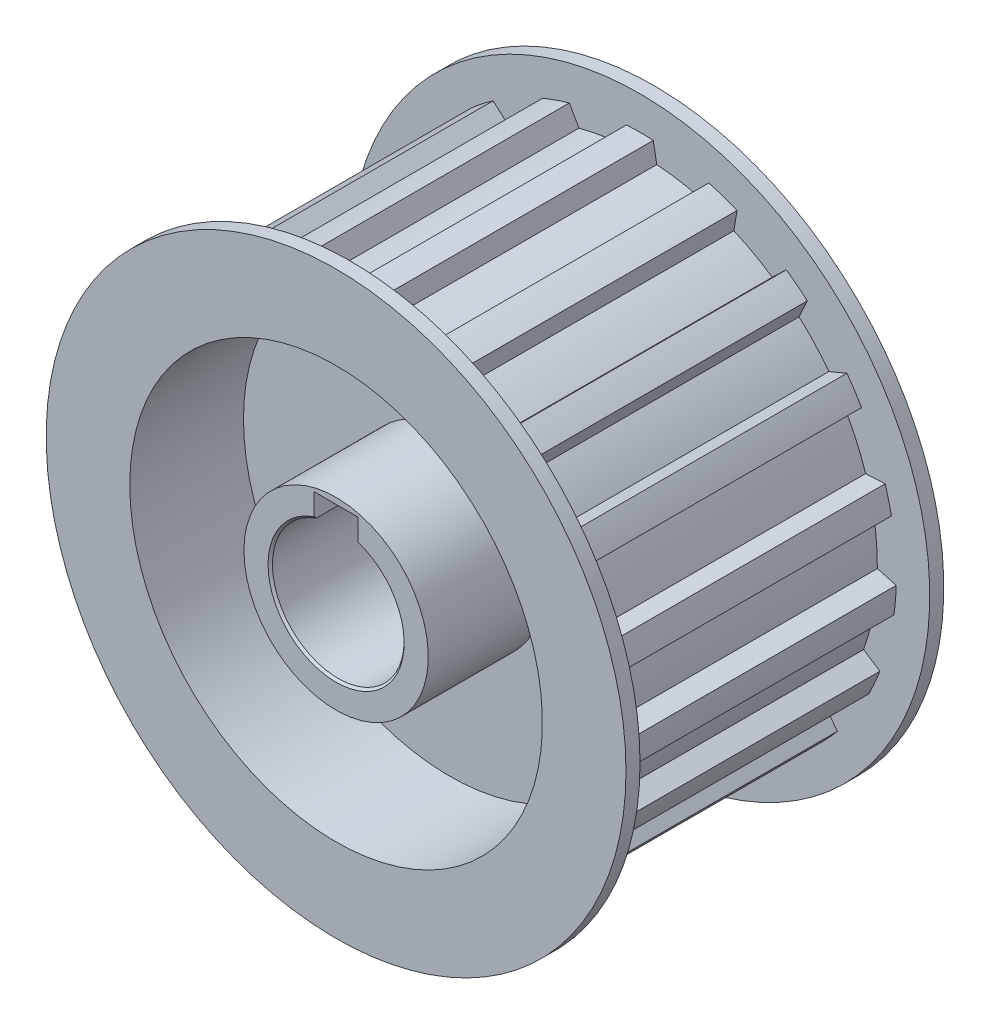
ISO-10303-21;
HEADER;
FILE_DESCRIPTION(('STEP AP214'),'2;1');
FILE_NAME('part.step','',(''),(''),'','','');
FILE_SCHEMA(('AUTOMOTIVE_DESIGN { 1 0 10303 214 1 1 1 1 }'));
ENDSEC;
DATA;
#1=APPLICATION_CONTEXT('core data for automotive mechanical design processes');
#2=APPLICATION_PROTOCOL_DEFINITION('international standard','automotive_design',2000,#1);
#3=PRODUCT_CONTEXT('',#1,'mechanical');
#4=PRODUCT('Part','Part','',(#3));
#5=PRODUCT_RELATED_PRODUCT_CATEGORY('part','',(#4));
#6=PRODUCT_DEFINITION_FORMATION('','',#4);
#7=PRODUCT_DEFINITION_CONTEXT('part definition',#1,'design');
#8=PRODUCT_DEFINITION('design','',#6,#7);
#9=PRODUCT_DEFINITION_SHAPE('','',#8);
#10=(LENGTH_UNIT() NAMED_UNIT(*) SI_UNIT(.MILLI.,.METRE.));
#11=(NAMED_UNIT(*) PLANE_ANGLE_UNIT() SI_UNIT($,.RADIAN.));
#12=(NAMED_UNIT(*) SI_UNIT($,.STERADIAN.) SOLID_ANGLE_UNIT());
#13=UNCERTAINTY_MEASURE_WITH_UNIT(LENGTH_MEASURE(1.E-05),#10,'distance_accuracy_value','');
#14=(GEOMETRIC_REPRESENTATION_CONTEXT(3) GLOBAL_UNCERTAINTY_ASSIGNED_CONTEXT((#13)) GLOBAL_UNIT_ASSIGNED_CONTEXT((#10,
#11,#12)) REPRESENTATION_CONTEXT('',''));
#15=CARTESIAN_POINT('',(0.,0.,0.));
#16=DIRECTION('',(0.,0.,1.));
#17=DIRECTION('',(1.,0.,0.));
#18=AXIS2_PLACEMENT_3D('',#15,#16,#17);
#19=CARTESIAN_POINT('',(0.,0.,-18.1));
#20=DIRECTION('',(0.,0.,1.));
#21=DIRECTION('',(1.,0.,0.));
#22=AXIS2_PLACEMENT_3D('',#19,#20,#21);
#23=CYLINDRICAL_SURFACE('',#22,23.5);
#24=CARTESIAN_POINT('',(0.,0.,-18.1));
#25=DIRECTION('',(0.,0.,1.));
#26=DIRECTION('',(1.,0.,0.));
#27=AXIS2_PLACEMENT_3D('',#24,#25,#26);
#28=CIRCLE('',#27,23.5);
#29=CARTESIAN_POINT('',(23.5,0.,-18.1));
#30=VERTEX_POINT('',#29);
#31=EDGE_CURVE('E1734',#30,#30,#28,.F.);
#32=ORIENTED_EDGE('',*,*,#31,.T.);
#33=EDGE_LOOP('',(#32));
#34=FACE_BOUND('',#33,.T.);
#35=CARTESIAN_POINT('',(0.,0.,-5.146));
#36=DIRECTION('',(0.,0.,1.));
#37=DIRECTION('',(1.,0.,0.));
#38=AXIS2_PLACEMENT_3D('',#35,#36,#37);
#39=CIRCLE('',#38,23.5);
#40=CARTESIAN_POINT('',(23.5,0.,-5.146));
#41=VERTEX_POINT('',#40);
#42=EDGE_CURVE('E19',#41,#41,#39,.T.);
#43=ORIENTED_EDGE('',*,*,#42,.T.);
#44=EDGE_LOOP('',(#43));
#45=FACE_BOUND('',#44,.T.);
#46=ADVANCED_FACE('F15',(#34,#45),#23,.F.);
#47=CARTESIAN_POINT('',(23.97,23.97,-5.146));
#48=DIRECTION('',(0.,0.,1.));
#49=DIRECTION('',(-1.,0.,0.));
#50=AXIS2_PLACEMENT_3D('',#47,#48,#49);
#51=PLANE('',#50);
#52=CARTESIAN_POINT('',(0.,0.,-5.146));
#53=DIRECTION('',(0.,0.,1.));
#54=DIRECTION('',(1.,0.,0.));
#55=AXIS2_PLACEMENT_3D('',#52,#53,#54);
#56=CIRCLE('',#55,10.5);
#57=CARTESIAN_POINT('',(10.5,0.,-5.146));
#58=VERTEX_POINT('',#57);
#59=EDGE_CURVE('E1732',#58,#58,#56,.F.);
#60=ORIENTED_EDGE('',*,*,#59,.F.);
#61=EDGE_LOOP('',(#60));
#62=FACE_BOUND('',#61,.T.);
#63=ORIENTED_EDGE('',*,*,#42,.F.);
#64=EDGE_LOOP('',(#63));
#65=FACE_BOUND('',#64,.T.);
#66=ADVANCED_FACE('F1697',(#62,#65),#51,.F.);
#67=CARTESIAN_POINT('',(33.6804,33.6804,-18.1));
#68=DIRECTION('',(0.,0.,1.));
#69=DIRECTION('',(-1.,0.,0.));
#70=AXIS2_PLACEMENT_3D('',#67,#68,#69);
#71=PLANE('',#70);
#72=ORIENTED_EDGE('',*,*,#31,.F.);
#73=EDGE_LOOP('',(#72));
#74=FACE_BOUND('',#73,.T.);
#75=CARTESIAN_POINT('',(0.,0.,-18.1));
#76=DIRECTION('',(0.,0.,-1.));
#77=DIRECTION('',(-1.,0.,0.));
#78=AXIS2_PLACEMENT_3D('',#75,#76,#77);
#79=CIRCLE('',#78,33.02);
#80=CARTESIAN_POINT('',(-33.02,0.,-18.1));
#81=VERTEX_POINT('',#80);
#82=EDGE_CURVE('E1742',#81,#81,#79,.F.);
#83=ORIENTED_EDGE('',*,*,#82,.F.);
#84=EDGE_LOOP('',(#83));
#85=FACE_BOUND('',#84,.T.);
#86=ADVANCED_FACE('F1689',(#74,#85),#71,.F.);
#87=CARTESIAN_POINT('',(0.,0.,-18.1));
#88=DIRECTION('',(0.,0.,1.));
#89=DIRECTION('',(1.,0.,0.));
#90=AXIS2_PLACEMENT_3D('',#87,#88,#89);
#91=CYLINDRICAL_SURFACE('',#90,10.5);
#92=CARTESIAN_POINT('',(0.,0.,-18.1));
#93=DIRECTION('',(0.,0.,1.));
#94=DIRECTION('',(1.,0.,0.));
#95=AXIS2_PLACEMENT_3D('',#92,#93,#94);
#96=CIRCLE('',#95,10.5);
#97=CARTESIAN_POINT('',(10.5,0.,-18.1));
#98=VERTEX_POINT('',#97);
#99=EDGE_CURVE('E1744',#98,#98,#96,.T.);
#100=ORIENTED_EDGE('',*,*,#99,.T.);
#101=EDGE_LOOP('',(#100));
#102=FACE_BOUND('',#101,.T.);
#103=ORIENTED_EDGE('',*,*,#59,.T.);
#104=EDGE_LOOP('',(#103));
#105=FACE_BOUND('',#104,.T.);
#106=ADVANCED_FACE('F1682',(#102,#105),#91,.T.);
#107=CARTESIAN_POINT('',(0.,0.,-18.1000000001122));
#108=DIRECTION('',(0.,0.,-1.));
#109=DIRECTION('',(-1.,0.,0.));
#110=AXIS2_PLACEMENT_3D('',#107,#108,#109);
#111=CONICAL_SURFACE('',#110,7.74999999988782,0.785398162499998);
#112=CARTESIAN_POINT('',(0.,0.,-18.1000000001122));
#113=DIRECTION('',(0.,0.,-1.));
#114=DIRECTION('',(-1.,0.,0.));
#115=AXIS2_PLACEMENT_3D('',#112,#113,#114);
#116=CIRCLE('',#115,7.74999999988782);
#117=CARTESIAN_POINT('',(2.49999999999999,7.33570037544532,-18.1000000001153));
#118=VERTEX_POINT('',#117);
#119=CARTESIAN_POINT('',(-2.50000000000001,7.33570037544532,-18.1000000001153));
#120=VERTEX_POINT('',#119);
#121=EDGE_CURVE('E731',#118,#120,#116,.T.);
#122=ORIENTED_EDGE('',*,*,#121,.T.);
#123=CARTESIAN_POINT('',(-2.49999999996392,7.07106781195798,-17.8499999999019));
#124=CARTESIAN_POINT('',(-2.49999999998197,7.11521432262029,-17.8916231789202));
#125=CARTESIAN_POINT('',(-2.499999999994,7.15934029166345,-17.9332681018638));
#126=CARTESIAN_POINT('',(-2.50000000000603,7.24755114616,-18.0166014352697));
#127=CARTESIAN_POINT('',(-2.50000000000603,7.29163603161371,-18.0582898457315));
#128=CARTESIAN_POINT('',(-2.50000000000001,7.3357003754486,-18.1000000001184));
#129=B_SPLINE_CURVE_WITH_KNOTS('',3,(#123,#124,#125,#126,#127,#128),.UNSPECIFIED.,.F.,.F.,(4,2,
4),(0.,0.182023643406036,0.364047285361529),.UNSPECIFIED.);
#130=CARTESIAN_POINT('',(-2.50000000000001,7.07106781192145,-17.8499999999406));
#131=VERTEX_POINT('',#130);
#132=EDGE_CURVE('E516',#131,#120,#129,.T.);
#133=ORIENTED_EDGE('',*,*,#132,.F.);
#134=CARTESIAN_POINT('',(0.,0.,-17.85));
#135=DIRECTION('',(0.,0.,-1.));
#136=DIRECTION('',(-1.,0.,0.));
#137=AXIS2_PLACEMENT_3D('',#134,#135,#136);
#138=CIRCLE('',#137,7.5);
#139=CARTESIAN_POINT('',(2.49999999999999,7.07106781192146,-17.8499999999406));
#140=VERTEX_POINT('',#139);
#141=EDGE_CURVE('E728',#131,#140,#138,.F.);
#142=ORIENTED_EDGE('',*,*,#141,.T.);
#143=CARTESIAN_POINT('',(2.50000000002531,7.33570037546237,-18.1000000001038));
#144=CARTESIAN_POINT('',(2.50000000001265,7.29163603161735,-18.0582898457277));
#145=CARTESIAN_POINT('',(2.50000000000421,7.24755114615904,-18.0166014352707));
#146=CARTESIAN_POINT('',(2.49999999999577,7.15934029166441,-17.9332681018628));
#147=CARTESIAN_POINT('',(2.49999999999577,7.11521432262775,-17.8916231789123));
#148=CARTESIAN_POINT('',(2.49999999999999,7.07106781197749,-17.8499999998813));
#149=B_SPLINE_CURVE_WITH_KNOTS('',3,(#143,#144,#145,#146,#147,#148),.UNSPECIFIED.,.F.,.F.,(4,2,
4),(0.,0.182023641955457,0.364047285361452),.UNSPECIFIED.);
#150=EDGE_CURVE('E1722',#118,#140,#149,.T.);
#151=ORIENTED_EDGE('',*,*,#150,.F.);
#152=EDGE_LOOP('',(#122,#133,#142,#151));
#153=FACE_BOUND('',#152,.T.);
#154=ADVANCED_FACE('F1674',(#153),#111,.F.);
#155=CARTESIAN_POINT('',(0.,0.,-16.5));
#156=DIRECTION('',(0.,0.,-1.));
#157=DIRECTION('',(-1.,0.,0.));
#158=AXIS2_PLACEMENT_3D('',#155,#156,#157);
#159=CYLINDRICAL_SURFACE('',#158,33.02);
#160=CARTESIAN_POINT('',(0.,0.,-16.5));
#161=DIRECTION('',(0.,0.,-1.));
#162=DIRECTION('',(-1.,0.,0.));
#163=AXIS2_PLACEMENT_3D('',#160,#161,#162);
#164=CIRCLE('',#163,33.02);
#165=CARTESIAN_POINT('',(-33.02,0.,-16.5));
#166=VERTEX_POINT('',#165);
#167=EDGE_CURVE('E730',#166,#166,#164,.F.);
#168=ORIENTED_EDGE('',*,*,#167,.F.);
#169=EDGE_LOOP('',(#168));
#170=FACE_BOUND('',#169,.T.);
#171=ORIENTED_EDGE('',*,*,#82,.T.);
#172=EDGE_LOOP('',(#171));
#173=FACE_BOUND('',#172,.T.);
#174=ADVANCED_FACE('F1668',(#170,#173),#159,.T.);
#175=CARTESIAN_POINT('',(10.71,10.71,-18.1));
#176=DIRECTION('',(0.,0.,1.));
#177=DIRECTION('',(-1.,0.,0.));
#178=AXIS2_PLACEMENT_3D('',#175,#176,#177);
#179=PLANE('',#178);
#180=DIRECTION('',(0.,1.,0.));
#181=VECTOR('',#180,1.);
#182=CARTESIAN_POINT('',(2.49999999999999,7.07106781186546,-18.1));
#183=LINE('',#182,#181);
#184=CARTESIAN_POINT('',(2.49999999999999,9.79999999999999,-18.1));
#185=VERTEX_POINT('',#184);
#186=EDGE_CURVE('E524',#118,#185,#183,.T.);
#187=ORIENTED_EDGE('',*,*,#186,.T.);
#188=DIRECTION('',(1.,0.,0.));
#189=VECTOR('',#188,1.);
#190=CARTESIAN_POINT('',(2.49999999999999,9.79999999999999,-18.1));
#191=LINE('',#190,#189);
#192=CARTESIAN_POINT('',(-2.50000000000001,9.79999999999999,-18.1));
#193=VERTEX_POINT('',#192);
#194=EDGE_CURVE('E565',#185,#193,#191,.F.);
#195=ORIENTED_EDGE('',*,*,#194,.T.);
#196=DIRECTION('',(0.,1.,0.));
#197=VECTOR('',#196,1.);
#198=CARTESIAN_POINT('',(-2.50000000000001,9.79999999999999,-18.1));
#199=LINE('',#198,#197);
#200=EDGE_CURVE('E540',#193,#120,#199,.F.);
#201=ORIENTED_EDGE('',*,*,#200,.T.);
#202=ORIENTED_EDGE('',*,*,#121,.F.);
#203=EDGE_LOOP('',(#187,#195,#201,#202));
#204=FACE_BOUND('',#203,.T.);
#205=ORIENTED_EDGE('',*,*,#99,.F.);
#206=EDGE_LOOP('',(#205));
#207=FACE_BOUND('',#206,.T.);
#208=ADVANCED_FACE('F1660',(#204,#207),#179,.F.);
#209=CARTESIAN_POINT('',(0.,0.,18.1));
#210=DIRECTION('',(0.,0.,-1.));
#211=DIRECTION('',(-1.,0.,0.));
#212=AXIS2_PLACEMENT_3D('',#209,#210,#211);
#213=CYLINDRICAL_SURFACE('',#212,7.5);
#214=DIRECTION('',(0.,0.,1.));
#215=VECTOR('',#214,1.);
#216=CARTESIAN_POINT('',(-2.50000000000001,7.07106781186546,18.1));
#217=LINE('',#216,#215);
#218=CARTESIAN_POINT('',(-2.50000000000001,7.07106781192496,17.8499999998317));
#219=VERTEX_POINT('',#218);
#220=EDGE_CURVE('E543',#131,#219,#217,.T.);
#221=ORIENTED_EDGE('',*,*,#220,.T.);
#222=CARTESIAN_POINT('',(0.,0.,17.8499999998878));
#223=DIRECTION('',(0.,0.,1.));
#224=DIRECTION('',(0.333333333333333,-0.942809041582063,0.));
#225=AXIS2_PLACEMENT_3D('',#222,#223,#224);
#226=CIRCLE('',#225,7.50000000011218);
#227=CARTESIAN_POINT('',(2.49999999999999,7.07106781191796,17.8499999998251));
#228=VERTEX_POINT('',#227);
#229=EDGE_CURVE('E720',#219,#228,#226,.T.);
#230=ORIENTED_EDGE('',*,*,#229,.T.);
#231=DIRECTION('',(0.,0.,-1.));
#232=VECTOR('',#231,1.);
#233=CARTESIAN_POINT('',(2.49999999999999,7.07106781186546,18.1));
#234=LINE('',#233,#232);
#235=EDGE_CURVE('E566',#228,#140,#234,.T.);
#236=ORIENTED_EDGE('',*,*,#235,.T.);
#237=ORIENTED_EDGE('',*,*,#141,.F.);
#238=EDGE_LOOP('',(#221,#230,#236,#237));
#239=FACE_BOUND('',#238,.T.);
#240=ADVANCED_FACE('F1653',(#239),#213,.F.);
#241=CARTESIAN_POINT('',(33.6804,33.6804,-16.5));
#242=DIRECTION('',(0.,0.,1.));
#243=DIRECTION('',(-1.,0.,0.));
#244=AXIS2_PLACEMENT_3D('',#241,#242,#243);
#245=PLANE('',#244);
#246=CARTESIAN_POINT('',(0.,0.,-16.5));
#247=DIRECTION('',(0.,0.,1.));
#248=DIRECTION('',(1.,0.,0.));
#249=AXIS2_PLACEMENT_3D('',#246,#247,#248);
#250=CIRCLE('',#249,27.0509993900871);
#251=CARTESIAN_POINT('',(-1.92741928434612,26.9822464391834,-16.5));
#252=VERTEX_POINT('',#251);
#253=CARTESIAN_POINT('',(-6.93813470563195,26.1461059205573,-16.5));
#254=VERTEX_POINT('',#253);
#255=EDGE_CURVE('E933',#252,#254,#250,.T.);
#256=ORIENTED_EDGE('',*,*,#255,.F.);
#257=DIRECTION('',(-0.181324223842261,-0.983423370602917,0.));
#258=VECTOR('',#257,1.);
#259=CARTESIAN_POINT('',(-1.92741928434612,26.9822464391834,-16.5));
#260=LINE('',#259,#258);
#261=CARTESIAN_POINT('',(-1.524,29.1702163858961,-16.5));
#262=VERTEX_POINT('',#261);
#263=EDGE_CURVE('E714',#262,#252,#260,.T.);
#264=ORIENTED_EDGE('',*,*,#263,.F.);
#265=CARTESIAN_POINT('',(0.,0.,-16.5));
#266=DIRECTION('',(0.,0.,1.));
#267=DIRECTION('',(1.,0.,0.));
#268=AXIS2_PLACEMENT_3D('',#265,#266,#267);
#269=CIRCLE('',#268,29.21);
#270=CARTESIAN_POINT('',(1.524,29.1702163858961,-16.5));
#271=VERTEX_POINT('',#270);
#272=EDGE_CURVE('E935',#271,#262,#269,.T.);
#273=ORIENTED_EDGE('',*,*,#272,.F.);
#274=DIRECTION('',(-0.181324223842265,0.983423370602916,0.));
#275=VECTOR('',#274,1.);
#276=CARTESIAN_POINT('',(1.524,29.1702163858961,-16.5));
#277=LINE('',#276,#275);
#278=CARTESIAN_POINT('',(1.92741928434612,26.9822464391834,-16.5));
#279=VERTEX_POINT('',#278);
#280=EDGE_CURVE('E567',#279,#271,#277,.T.);
#281=ORIENTED_EDGE('',*,*,#280,.F.);
#282=CARTESIAN_POINT('',(0.,0.,-16.5));
#283=DIRECTION('',(0.,0.,1.));
#284=DIRECTION('',(1.,0.,0.));
#285=AXIS2_PLACEMENT_3D('',#282,#283,#284);
#286=CIRCLE('',#285,27.0509993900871);
#287=CARTESIAN_POINT('',(6.93813470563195,26.1461059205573,-16.5));
#288=VERTEX_POINT('',#287);
#289=EDGE_CURVE('E861',#288,#279,#286,.T.);
#290=ORIENTED_EDGE('',*,*,#289,.F.);
#291=DIRECTION('',(-0.417295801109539,-0.90877071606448,0.));
#292=VECTOR('',#291,1.);
#293=CARTESIAN_POINT('',(6.93813470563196,26.1461059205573,-16.5));
#294=LINE('',#293,#292);
#295=CARTESIAN_POINT('',(7.85141826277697,28.1350196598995,-16.5));
#296=VERTEX_POINT('',#295);
#297=EDGE_CURVE('E570',#296,#288,#294,.T.);
#298=ORIENTED_EDGE('',*,*,#297,.F.);
#299=CARTESIAN_POINT('',(0.,0.,-16.5));
#300=DIRECTION('',(0.,0.,1.));
#301=DIRECTION('',(1.,0.,0.));
#302=AXIS2_PLACEMENT_3D('',#299,#300,#301);
#303=CIRCLE('',#302,29.21);
#304=CARTESIAN_POINT('',(11.0725078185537,27.0300512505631,-16.5));
#305=VERTEX_POINT('',#304);
#306=EDGE_CURVE('E863',#305,#296,#303,.T.);
#307=ORIENTED_EDGE('',*,*,#306,.F.);
#308=DIRECTION('',(0.164594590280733,0.986361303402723,0.));
#309=VECTOR('',#308,1.);
#310=CARTESIAN_POINT('',(11.0725078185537,27.0300512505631,-16.5));
#311=LINE('',#310,#309);
#312=CARTESIAN_POINT('',(10.7073348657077,24.8416897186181,-16.5));
#313=VERTEX_POINT('',#312);
#314=EDGE_CURVE('E574',#313,#305,#311,.T.);
#315=ORIENTED_EDGE('',*,*,#314,.F.);
#316=CARTESIAN_POINT('',(0.,0.,-16.5));
#317=DIRECTION('',(0.,0.,1.));
#318=DIRECTION('',(1.,0.,0.));
#319=AXIS2_PLACEMENT_3D('',#316,#317,#318);
#320=CIRCLE('',#319,27.0509993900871);
#321=CARTESIAN_POINT('',(15.0844039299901,22.4547840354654,-16.5));
#322=VERTEX_POINT('',#321);
#323=EDGE_CURVE('E865',#322,#313,#320,.T.);
#324=ORIENTED_EDGE('',*,*,#323,.F.);
#325=DIRECTION('',(-0.724166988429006,-0.689624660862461,0.));
#326=VECTOR('',#325,1.);
#327=CARTESIAN_POINT('',(15.0844039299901,22.4547840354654,-16.5));
#328=LINE('',#327,#326);
#329=CARTESIAN_POINT('',(16.6829866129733,23.9771152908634,-16.5));
#330=VERTEX_POINT('',#329);
#331=EDGE_CURVE('E578',#330,#322,#328,.T.);
#332=ORIENTED_EDGE('',*,*,#331,.F.);
#333=CARTESIAN_POINT('',(0.,0.,-16.5));
#334=DIRECTION('',(0.,0.,1.));
#335=DIRECTION('',(1.,0.,0.));
#336=AXIS2_PLACEMENT_3D('',#333,#334,#335);
#337=CIRCLE('',#336,29.21);
#338=CARTESIAN_POINT('',(19.07738962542,22.1196135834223,-16.5));
#339=VERTEX_POINT('',#338);
#340=EDGE_CURVE('E867',#339,#330,#337,.T.);
#341=ORIENTED_EDGE('',*,*,#340,.F.);
#342=DIRECTION('',(0.41729580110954,0.90877071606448,0.));
#343=VECTOR('',#342,1.);
#344=CARTESIAN_POINT('',(19.07738962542,22.1196135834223,-16.5));
#345=LINE('',#344,#343);
#346=CARTESIAN_POINT('',(18.1364655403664,20.0705053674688,-16.5));
#347=VERTEX_POINT('',#346);
#348=EDGE_CURVE('E582',#347,#339,#345,.T.);
#349=ORIENTED_EDGE('',*,*,#348,.F.);
#350=CARTESIAN_POINT('',(0.,0.,-16.5));
#351=DIRECTION('',(0.,0.,1.));
#352=DIRECTION('',(1.,0.,0.));
#353=AXIS2_PLACEMENT_3D('',#350,#351,#352);
#354=CIRCLE('',#353,27.0509993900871);
#355=CARTESIAN_POINT('',(21.5344337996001,16.3714608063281,-16.5));
#356=VERTEX_POINT('',#355);
#357=EDGE_CURVE('E869',#356,#347,#354,.T.);
#358=ORIENTED_EDGE('',*,*,#357,.F.);
#359=DIRECTION('',(-0.922464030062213,-0.3860830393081,0.));
#360=VECTOR('',#359,1.);
#361=CARTESIAN_POINT('',(21.5344337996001,16.3714608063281,-16.5));
#362=LINE('',#361,#360);
#363=CARTESIAN_POINT('',(23.5867783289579,17.2304378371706,-16.5));
#364=VERTEX_POINT('',#363);
#365=EDGE_CURVE('E586',#364,#356,#362,.T.);
#366=ORIENTED_EDGE('',*,*,#365,.F.);
#367=CARTESIAN_POINT('',(0.,0.,-16.5));
#368=DIRECTION('',(0.,0.,1.));
#369=DIRECTION('',(1.,0.,0.));
#370=AXIS2_PLACEMENT_3D('',#367,#368,#369);
#371=CIRCLE('',#370,29.21);
#372=CARTESIAN_POINT('',(25.2542665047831,14.6780830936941,-16.5));
#373=VERTEX_POINT('',#372);
#374=EDGE_CURVE('E871',#373,#364,#371,.T.);
#375=ORIENTED_EDGE('',*,*,#374,.F.);
#376=DIRECTION('',(0.724166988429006,0.689624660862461,0.));
#377=VECTOR('',#376,1.);
#378=CARTESIAN_POINT('',(25.2542665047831,14.6780830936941,-16.5));
#379=LINE('',#378,#377);
#380=CARTESIAN_POINT('',(23.6431241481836,13.1437912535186,-16.5));
#381=VERTEX_POINT('',#380);
#382=EDGE_CURVE('E590',#381,#373,#379,.T.);
#383=ORIENTED_EDGE('',*,*,#382,.F.);
#384=CARTESIAN_POINT('',(0.,0.,-16.5));
#385=DIRECTION('',(0.,0.,1.));
#386=DIRECTION('',(1.,0.,0.));
#387=AXIS2_PLACEMENT_3D('',#384,#385,#386);
#388=CIRCLE('',#387,27.0509993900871);
#389=CARTESIAN_POINT('',(25.7165817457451,8.39130450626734,-16.5));
#390=VERTEX_POINT('',#389);
#391=EDGE_CURVE('E873',#390,#381,#388,.T.);
#392=ORIENTED_EDGE('',*,*,#391,.F.);
#393=DIRECTION('',(-0.998638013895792,-0.05217391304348,0.));
#394=VECTOR('',#393,1.);
#395=CARTESIAN_POINT('',(25.7165817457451,8.39130450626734,-16.5));
#396=LINE('',#395,#394);
#397=CARTESIAN_POINT('',(27.9435845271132,8.50765442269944,-16.5));
#398=VERTEX_POINT('',#397);
#399=EDGE_CURVE('E594',#398,#390,#396,.T.);
#400=ORIENTED_EDGE('',*,*,#399,.F.);
#401=CARTESIAN_POINT('',(0.,0.,-16.5));
#402=DIRECTION('',(0.,0.,1.));
#403=DIRECTION('',(1.,0.,0.));
#404=AXIS2_PLACEMENT_3D('',#401,#402,#403);
#405=CIRCLE('',#404,29.21);
#406=CARTESIAN_POINT('',(28.651735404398,5.68349877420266,-16.5));
#407=VERTEX_POINT('',#406);
#408=EDGE_CURVE('E875',#407,#398,#405,.T.);
#409=ORIENTED_EDGE('',*,*,#408,.F.);
#410=DIRECTION('',(0.908818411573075,0.417191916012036,0.));
#411=VECTOR('',#410,1.);
#412=CARTESIAN_POINT('',(28.6517354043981,5.68349877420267,-16.5));
#413=LINE('',#412,#411);
#414=CARTESIAN_POINT('',(26.6297503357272,4.7553091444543,-16.5));
#415=VERTEX_POINT('',#414);
#416=EDGE_CURVE('E598',#415,#407,#413,.T.);
#417=ORIENTED_EDGE('',*,*,#416,.F.);
#418=CARTESIAN_POINT('',(0.,0.,-16.5));
#419=DIRECTION('',(0.,0.,1.));
#420=DIRECTION('',(1.,0.,0.));
#421=AXIS2_PLACEMENT_3D('',#418,#419,#420);
#422=CIRCLE('',#421,27.0509993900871);
#423=CARTESIAN_POINT('',(27.0492602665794,-0.306736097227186,-16.5));
#424=VERTEX_POINT('',#423);
#425=EDGE_CURVE('E877',#424,#415,#422,.T.);
#426=ORIENTED_EDGE('',*,*,#425,.F.);
#427=DIRECTION('',(-0.965110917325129,0.261841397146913,0.));
#428=VECTOR('',#427,1.);
#429=CARTESIAN_POINT('',(27.0492602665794,-0.306736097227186,-16.5));
#430=LINE('',#429,#428);
#431=CARTESIAN_POINT('',(29.1964598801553,-0.889286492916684,-16.5));
#432=VERTEX_POINT('',#431);
#433=EDGE_CURVE('E602',#432,#424,#430,.T.);
#434=ORIENTED_EDGE('',*,*,#433,.F.);
#435=CARTESIAN_POINT('',(0.,0.,-16.5));
#436=DIRECTION('',(0.,0.,1.));
#437=DIRECTION('',(1.,0.,0.));
#438=AXIS2_PLACEMENT_3D('',#435,#436,#437);
#439=CIRCLE('',#438,29.21);
#440=CARTESIAN_POINT('',(28.9447343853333,-3.92765214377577,-16.5));
#441=VERTEX_POINT('',#440);
#442=EDGE_CURVE('E879',#441,#432,#439,.T.);
#443=ORIENTED_EDGE('',*,*,#442,.F.);
#444=DIRECTION('',(0.997458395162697,0.071251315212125,0.));
#445=VECTOR('',#444,1.);
#446=CARTESIAN_POINT('',(28.9447343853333,-3.92765214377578,-16.5));
#447=LINE('',#446,#445);
#448=CARTESIAN_POINT('',(26.7407671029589,-4.08508785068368,-16.5));
#449=VERTEX_POINT('',#448);
#450=EDGE_CURVE('E606',#449,#441,#447,.T.);
#451=ORIENTED_EDGE('',*,*,#450,.F.);
#452=CARTESIAN_POINT('',(0.,0.,-16.5));
#453=DIRECTION('',(0.,0.,1.));
#454=DIRECTION('',(1.,0.,0.));
#455=AXIS2_PLACEMENT_3D('',#452,#453,#454);
#456=CIRCLE('',#455,27.0509993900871);
#457=CARTESIAN_POINT('',(25.4838570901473,-9.07356577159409,-16.5));
#458=VERTEX_POINT('',#457);
#459=EDGE_CURVE('E881',#458,#449,#456,.T.);
#460=ORIENTED_EDGE('',*,*,#459,.F.);
#461=DIRECTION('',(-0.836967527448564,0.547252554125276,0.));
#462=VECTOR('',#461,1.);
#463=CARTESIAN_POINT('',(25.4838570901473,-9.0735657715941,-16.5));
#464=LINE('',#463,#462);
#465=CARTESIAN_POINT('',(27.3388530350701,-10.2864578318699,-16.5));
#466=VERTEX_POINT('',#465);
#467=EDGE_CURVE('E610',#466,#458,#464,.T.);
#468=ORIENTED_EDGE('',*,*,#467,.F.);
#469=CARTESIAN_POINT('',(0.,0.,-16.5));
#470=DIRECTION('',(0.,0.,1.));
#471=DIRECTION('',(1.,0.,0.));
#472=AXIS2_PLACEMENT_3D('',#469,#470,#471);
#473=CIRCLE('',#472,29.21);
#474=CARTESIAN_POINT('',(26.084094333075,-13.1470195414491,-16.5));
#475=VERTEX_POINT('',#474);
#476=EDGE_CURVE('E883',#475,#466,#473,.T.);
#477=ORIENTED_EDGE('',*,*,#476,.F.);
#478=DIRECTION('',(0.965110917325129,-0.261841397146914,0.));
#479=VECTOR('',#478,1.);
#480=CARTESIAN_POINT('',(26.084094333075,-13.1470195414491,-16.5));
#481=LINE('',#480,#479);
#482=CARTESIAN_POINT('',(23.9536332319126,-12.5690104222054,-16.5));
#483=VERTEX_POINT('',#482);
#484=EDGE_CURVE('E614',#483,#475,#481,.T.);
#485=ORIENTED_EDGE('',*,*,#484,.F.);
#486=CARTESIAN_POINT('',(0.,0.,-16.5));
#487=DIRECTION('',(0.,0.,1.));
#488=DIRECTION('',(1.,0.,0.));
#489=AXIS2_PLACEMENT_3D('',#486,#487,#488);
#490=CIRCLE('',#489,27.0509993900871);
#491=CARTESIAN_POINT('',(21.1568894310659,-16.8565298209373,-16.5));
#492=VERTEX_POINT('',#491);
#493=EDGE_CURVE('E885',#492,#483,#490,.T.);
#494=ORIENTED_EDGE('',*,*,#493,.F.);
#495=DIRECTION('',(-0.600720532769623,0.799459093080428,0.));
#496=VECTOR('',#495,1.);
#497=CARTESIAN_POINT('',(21.1568894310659,-16.8565298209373,-16.5));
#498=LINE('',#497,#496);
#499=CARTESIAN_POINT('',(22.4934027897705,-18.6352067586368,-16.5));
#500=VERTEX_POINT('',#499);
#501=EDGE_CURVE('E618',#500,#492,#498,.T.);
#502=ORIENTED_EDGE('',*,*,#501,.F.);
#503=CARTESIAN_POINT('',(0.,0.,-16.5));
#504=DIRECTION('',(0.,0.,1.));
#505=DIRECTION('',(1.,0.,0.));
#506=AXIS2_PLACEMENT_3D('',#503,#504,#505);
#507=CIRCLE('',#506,29.21);
#508=CARTESIAN_POINT('',(20.4290485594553,-20.8776932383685,-16.5));
#509=VERTEX_POINT('',#508);
#510=EDGE_CURVE('E887',#509,#500,#507,.T.);
#511=ORIENTED_EDGE('',*,*,#510,.F.);
#512=DIRECTION('',(0.846335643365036,-0.532649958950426,0.));
#513=VECTOR('',#512,1.);
#514=CARTESIAN_POINT('',(20.4290485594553,-20.8776932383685,-16.5));
#515=LINE('',#514,#513);
#516=CARTESIAN_POINT('',(18.5460783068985,-19.6926267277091,-16.5));
#517=VERTEX_POINT('',#516);
#518=EDGE_CURVE('E622',#517,#509,#515,.T.);
#519=ORIENTED_EDGE('',*,*,#518,.F.);
#520=CARTESIAN_POINT('',(0.,0.,-16.5));
#521=DIRECTION('',(0.,0.,1.));
#522=DIRECTION('',(1.,0.,0.));
#523=AXIS2_PLACEMENT_3D('',#520,#521,#522);
#524=CIRCLE('',#523,27.0509993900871);
#525=CARTESIAN_POINT('',(14.5372445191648,-22.8128273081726,-16.5));
#526=VERTEX_POINT('',#525);
#527=EDGE_CURVE('E889',#526,#517,#524,.T.);
#528=ORIENTED_EDGE('',*,*,#527,.F.);
#529=DIRECTION('',(-0.30858789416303,0.951195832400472,0.));
#530=VECTOR('',#529,1.);
#531=CARTESIAN_POINT('',(14.5372445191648,-22.8128273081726,-16.5));
#532=LINE('',#531,#530);
#533=CARTESIAN_POINT('',(15.2238064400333,-24.9290958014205,-16.5));
#534=VERTEX_POINT('',#533);
#535=EDGE_CURVE('E626',#534,#526,#532,.T.);
#536=ORIENTED_EDGE('',*,*,#535,.F.);
#537=CARTESIAN_POINT('',(0.,0.,-16.5));
#538=DIRECTION('',(0.,0.,1.));
#539=DIRECTION('',(1.,0.,0.));
#540=AXIS2_PLACEMENT_3D('',#537,#538,#539);
#541=CIRCLE('',#540,29.21);
#542=CARTESIAN_POINT('',(12.5431704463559,-26.3797834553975,-16.5));
#543=VERTEX_POINT('',#542);
#544=EDGE_CURVE('E891',#543,#534,#541,.T.);
#545=ORIENTED_EDGE('',*,*,#544,.F.);
#546=DIRECTION('',(0.627527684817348,-0.778594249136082,0.));
#547=VECTOR('',#546,1.);
#548=CARTESIAN_POINT('',(12.5431704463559,-26.3797834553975,-16.5));
#549=LINE('',#548,#547);
#550=CARTESIAN_POINT('',(11.1470151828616,-24.6475276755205,-16.5));
#551=VERTEX_POINT('',#550);
#552=EDGE_CURVE('E630',#551,#543,#549,.T.);
#553=ORIENTED_EDGE('',*,*,#552,.F.);
#554=CARTESIAN_POINT('',(0.,0.,-16.5));
#555=DIRECTION('',(0.,0.,1.));
#556=DIRECTION('',(1.,0.,0.));
#557=AXIS2_PLACEMENT_3D('',#554,#555,#556);
#558=CIRCLE('',#557,27.0509993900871);
#559=CARTESIAN_POINT('',(6.34226359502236,-26.2970009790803,-16.5));
#560=VERTEX_POINT('',#559);
#561=EDGE_CURVE('E893',#560,#551,#558,.T.);
#562=ORIENTED_EDGE('',*,*,#561,.F.);
#563=DIRECTION('',(0.016985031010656,0.99985574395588,0.));
#564=VECTOR('',#563,1.);
#565=CARTESIAN_POINT('',(6.34226359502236,-26.2970009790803,-16.5));
#566=LINE('',#565,#564);
#567=CARTESIAN_POINT('',(6.30447444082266,-28.5215304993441,-16.5));
#568=VERTEX_POINT('',#567);
#569=EDGE_CURVE('E634',#568,#560,#566,.T.);
#570=ORIENTED_EDGE('',*,*,#569,.F.);
#571=CARTESIAN_POINT('',(0.,0.,-16.5));
#572=DIRECTION('',(0.,0.,1.));
#573=DIRECTION('',(1.,0.,0.));
#574=AXIS2_PLACEMENT_3D('',#571,#572,#573);
#575=CIRCLE('',#574,29.21);
#576=CARTESIAN_POINT('',(3.29804518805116,-29.0232148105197,-16.5));
#577=VERTEX_POINT('',#576);
#578=EDGE_CURVE('E895',#577,#568,#575,.T.);
#579=ORIENTED_EDGE('',*,*,#578,.F.);
#580=DIRECTION('',(0.340717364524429,-0.940165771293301,0.));
#581=VECTOR('',#580,1.);
#582=CARTESIAN_POINT('',(3.29804518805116,-29.0232148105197,-16.5));
#583=LINE('',#582,#581);
#584=CARTESIAN_POINT('',(2.54,-26.9314865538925,-16.5));
#585=VERTEX_POINT('',#584);
#586=EDGE_CURVE('E638',#585,#577,#583,.T.);
#587=ORIENTED_EDGE('',*,*,#586,.F.);
#588=CARTESIAN_POINT('',(0.,0.,-16.5));
#589=DIRECTION('',(0.,0.,1.));
#590=DIRECTION('',(1.,0.,0.));
#591=AXIS2_PLACEMENT_3D('',#588,#589,#590);
#592=CIRCLE('',#591,27.0509993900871);
#593=CARTESIAN_POINT('',(-2.54000000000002,-26.9314865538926,-16.5));
#594=VERTEX_POINT('',#593);
#595=EDGE_CURVE('E897',#594,#585,#592,.T.);
#596=ORIENTED_EDGE('',*,*,#595,.F.);
#597=DIRECTION('',(0.340717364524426,0.940165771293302,0.));
#598=VECTOR('',#597,1.);
#599=CARTESIAN_POINT('',(-2.54000000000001,-26.9314865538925,-16.5));
#600=LINE('',#599,#598);
#601=CARTESIAN_POINT('',(-3.29804518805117,-29.0232148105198,-16.5));
#602=VERTEX_POINT('',#601);
#603=EDGE_CURVE('E642',#602,#594,#600,.T.);
#604=ORIENTED_EDGE('',*,*,#603,.F.);
#605=CARTESIAN_POINT('',(0.,0.,-16.5));
#606=DIRECTION('',(0.,0.,1.));
#607=DIRECTION('',(1.,0.,0.));
#608=AXIS2_PLACEMENT_3D('',#605,#606,#607);
#609=CIRCLE('',#608,29.21);
#610=CARTESIAN_POINT('',(-6.30447444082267,-28.5215304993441,-16.5));
#611=VERTEX_POINT('',#610);
#612=EDGE_CURVE('E899',#611,#602,#609,.T.);
#613=ORIENTED_EDGE('',*,*,#612,.F.);
#614=DIRECTION('',(0.016985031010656,-0.99985574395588,0.));
#615=VECTOR('',#614,1.);
#616=CARTESIAN_POINT('',(-6.30447444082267,-28.5215304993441,-16.5));
#617=LINE('',#616,#615);
#618=CARTESIAN_POINT('',(-6.34226359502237,-26.2970009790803,-16.5));
#619=VERTEX_POINT('',#618);
#620=EDGE_CURVE('E646',#619,#611,#617,.T.);
#621=ORIENTED_EDGE('',*,*,#620,.F.);
#622=CARTESIAN_POINT('',(0.,0.,-16.5));
#623=DIRECTION('',(0.,0.,1.));
#624=DIRECTION('',(1.,0.,0.));
#625=AXIS2_PLACEMENT_3D('',#622,#623,#624);
#626=CIRCLE('',#625,27.0509993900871);
#627=CARTESIAN_POINT('',(-11.1827363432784,-24.6313413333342,-16.5));
#628=VERTEX_POINT('',#627);
#629=EDGE_CURVE('E901',#628,#619,#626,.T.);
#630=ORIENTED_EDGE('',*,*,#629,.F.);
#631=DIRECTION('',(0.600781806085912,0.799413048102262,0.));
#632=VECTOR('',#631,1.);
#633=CARTESIAN_POINT('',(-11.1827363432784,-24.6313413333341,-16.5));
#634=LINE('',#633,#632);
#635=CARTESIAN_POINT('',(-12.5089489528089,-26.3960280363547,-16.5));
#636=VERTEX_POINT('',#635);
#637=EDGE_CURVE('E650',#636,#628,#634,.T.);
#638=ORIENTED_EDGE('',*,*,#637,.F.);
#639=CARTESIAN_POINT('',(0.,0.,-16.5));
#640=DIRECTION('',(0.,0.,1.));
#641=DIRECTION('',(1.,0.,0.));
#642=AXIS2_PLACEMENT_3D('',#639,#640,#641);
#643=CIRCLE('',#642,29.21);
#644=CARTESIAN_POINT('',(-15.2238064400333,-24.9290958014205,-16.5));
#645=VERTEX_POINT('',#644);
#646=EDGE_CURVE('E903',#645,#636,#643,.T.);
#647=ORIENTED_EDGE('',*,*,#646,.F.);
#648=DIRECTION('',(-0.308587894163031,-0.951195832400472,0.));
#649=VECTOR('',#648,1.);
#650=CARTESIAN_POINT('',(-15.2238064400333,-24.9290958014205,-16.5));
#651=LINE('',#650,#649);
#652=CARTESIAN_POINT('',(-14.5372445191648,-22.8128273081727,-16.5));
#653=VERTEX_POINT('',#652);
#654=EDGE_CURVE('E654',#653,#645,#651,.T.);
#655=ORIENTED_EDGE('',*,*,#654,.F.);
#656=CARTESIAN_POINT('',(0.,0.,-16.5));
#657=DIRECTION('',(0.,0.,1.));
#658=DIRECTION('',(1.,0.,0.));
#659=AXIS2_PLACEMENT_3D('',#656,#657,#658);
#660=CIRCLE('',#659,27.0509993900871);
#661=CARTESIAN_POINT('',(-18.5460783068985,-19.6926267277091,-16.5));
#662=VERTEX_POINT('',#661);
#663=EDGE_CURVE('E905',#662,#653,#660,.T.);
#664=ORIENTED_EDGE('',*,*,#663,.F.);
#665=DIRECTION('',(0.846335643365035,0.532649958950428,0.));
#666=VECTOR('',#665,1.);
#667=CARTESIAN_POINT('',(-18.5460783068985,-19.6926267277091,-16.5));
#668=LINE('',#667,#666);
#669=CARTESIAN_POINT('',(-20.4290485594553,-20.8776932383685,-16.5));
#670=VERTEX_POINT('',#669);
#671=EDGE_CURVE('E658',#670,#662,#668,.T.);
#672=ORIENTED_EDGE('',*,*,#671,.F.);
#673=CARTESIAN_POINT('',(0.,0.,-16.5));
#674=DIRECTION('',(0.,0.,1.));
#675=DIRECTION('',(1.,0.,0.));
#676=AXIS2_PLACEMENT_3D('',#673,#674,#675);
#677=CIRCLE('',#676,29.21);
#678=CARTESIAN_POINT('',(-22.4938981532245,-18.6346088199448,-16.5));
#679=VERTEX_POINT('',#678);
#680=EDGE_CURVE('E907',#679,#670,#677,.T.);
#681=ORIENTED_EDGE('',*,*,#680,.F.);
#682=DIRECTION('',(-0.600781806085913,-0.799413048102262,0.));
#683=VECTOR('',#682,1.);
#684=CARTESIAN_POINT('',(-22.4938981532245,-18.6346088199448,-16.5));
#685=LINE('',#684,#683);
#686=CARTESIAN_POINT('',(-21.1572658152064,-16.8560574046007,-16.5));
#687=VERTEX_POINT('',#686);
#688=EDGE_CURVE('E662',#687,#679,#685,.T.);
#689=ORIENTED_EDGE('',*,*,#688,.F.);
#690=CARTESIAN_POINT('',(0.,0.,-16.5));
#691=DIRECTION('',(0.,0.,1.));
#692=DIRECTION('',(1.,0.,0.));
#693=AXIS2_PLACEMENT_3D('',#690,#691,#692);
#694=CIRCLE('',#693,27.0509993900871);
#695=CARTESIAN_POINT('',(-23.9353860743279,-12.6037241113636,-16.5));
#696=VERTEX_POINT('',#695);
#697=EDGE_CURVE('E909',#696,#687,#694,.T.);
#698=ORIENTED_EDGE('',*,*,#697,.F.);
#699=DIRECTION('',(0.97343000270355,0.228984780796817,0.));
#700=VECTOR('',#699,1.);
#701=CARTESIAN_POINT('',(-23.9353860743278,-12.6037241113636,-16.5));
#702=LINE('',#701,#700);
#703=CARTESIAN_POINT('',(-26.1011222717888,-13.1131810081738,-16.5));
#704=VERTEX_POINT('',#703);
#705=EDGE_CURVE('E666',#704,#696,#702,.T.);
#706=ORIENTED_EDGE('',*,*,#705,.F.);
#707=CARTESIAN_POINT('',(0.,0.,-16.5));
#708=DIRECTION('',(0.,0.,1.));
#709=DIRECTION('',(1.,0.,0.));
#710=AXIS2_PLACEMENT_3D('',#707,#708,#709);
#711=CIRCLE('',#710,29.21);
#712=CARTESIAN_POINT('',(-27.3254899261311,-10.3219039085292,-16.5));
#713=VERTEX_POINT('',#712);
#714=EDGE_CURVE('E911',#713,#704,#711,.T.);
#715=ORIENTED_EDGE('',*,*,#714,.F.);
#716=DIRECTION('',(-0.827755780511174,-0.561088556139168,0.));
#717=VECTOR('',#716,1.);
#718=CARTESIAN_POINT('',(-27.325489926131,-10.3219039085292,-16.5));
#719=LINE('',#718,#717);
#720=CARTESIAN_POINT('',(-25.4838570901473,-9.0735657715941,-16.5));
#721=VERTEX_POINT('',#720);
#722=EDGE_CURVE('E670',#721,#713,#719,.T.);
#723=ORIENTED_EDGE('',*,*,#722,.F.);
#724=CARTESIAN_POINT('',(0.,0.,-16.5));
#725=DIRECTION('',(0.,0.,1.));
#726=DIRECTION('',(1.,0.,0.));
#727=AXIS2_PLACEMENT_3D('',#724,#725,#726);
#728=CIRCLE('',#727,27.0509993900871);
#729=CARTESIAN_POINT('',(-26.7308307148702,-4.14960929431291,-16.5));
#730=VERTEX_POINT('',#729);
#731=EDGE_CURVE('E913',#730,#721,#728,.T.);
#732=ORIENTED_EDGE('',*,*,#731,.F.);
#733=DIRECTION('',(0.995045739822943,-0.099418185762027,0.));
#734=VECTOR('',#733,1.);
#735=CARTESIAN_POINT('',(-26.7308307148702,-4.14960929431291,-16.5));
#736=LINE('',#735,#734);
#737=CARTESIAN_POINT('',(-28.9446299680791,-3.92842156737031,-16.5));
#738=VERTEX_POINT('',#737);
#739=EDGE_CURVE('E674',#738,#730,#736,.T.);
#740=ORIENTED_EDGE('',*,*,#739,.F.);
#741=CARTESIAN_POINT('',(0.,0.,-16.5));
#742=DIRECTION('',(0.,0.,1.));
#743=DIRECTION('',(1.,0.,0.));
#744=AXIS2_PLACEMENT_3D('',#741,#742,#743);
#745=CIRCLE('',#744,29.21);
#746=CARTESIAN_POINT('',(-29.1964362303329,-0.890062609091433,-16.5));
#747=VERTEX_POINT('',#746);
#748=EDGE_CURVE('E915',#747,#738,#745,.T.);
#749=ORIENTED_EDGE('',*,*,#748,.F.);
#750=DIRECTION('',(-0.965090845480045,-0.261915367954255,0.));
#751=VECTOR('',#750,1.);
#752=CARTESIAN_POINT('',(-29.1964362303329,-0.890062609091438,-16.5));
#753=LINE('',#752,#751);
#754=CARTESIAN_POINT('',(-27.0492534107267,-0.307340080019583,-16.5));
#755=VERTEX_POINT('',#754);
#756=EDGE_CURVE('E678',#755,#747,#753,.T.);
#757=ORIENTED_EDGE('',*,*,#756,.F.);
#758=CARTESIAN_POINT('',(0.,0.,-16.5));
#759=DIRECTION('',(0.,0.,1.));
#760=DIRECTION('',(1.,0.,0.));
#761=AXIS2_PLACEMENT_3D('',#758,#759,#760);
#762=CIRCLE('',#761,27.0509993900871);
#763=CARTESIAN_POINT('',(-26.6295919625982,4.75619594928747,-16.5));
#764=VERTEX_POINT('',#763);
#765=EDGE_CURVE('E917',#764,#755,#762,.T.);
#766=ORIENTED_EDGE('',*,*,#765,.F.);
#767=DIRECTION('',(0.90877071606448,-0.417295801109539,0.));
#768=VECTOR('',#767,1.);
#769=CARTESIAN_POINT('',(-26.6295919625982,4.75619594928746,-16.5));
#770=LINE('',#769,#768);
#771=CARTESIAN_POINT('',(-28.6515100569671,5.6846346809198,-16.5));
#772=VERTEX_POINT('',#771);
#773=EDGE_CURVE('E682',#772,#764,#770,.T.);
#774=ORIENTED_EDGE('',*,*,#773,.F.);
#775=CARTESIAN_POINT('',(0.,0.,-16.5));
#776=DIRECTION('',(0.,0.,1.));
#777=DIRECTION('',(1.,0.,0.));
#778=AXIS2_PLACEMENT_3D('',#775,#776,#777);
#779=CIRCLE('',#778,29.21);
#780=CARTESIAN_POINT('',(-27.8922695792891,8.67441051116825,-16.5));
#781=VERTEX_POINT('',#780);
#782=EDGE_CURVE('E919',#781,#772,#779,.T.);
#783=ORIENTED_EDGE('',*,*,#782,.F.);
#784=DIRECTION('',(-0.995045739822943,0.099418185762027,0.));
#785=VECTOR('',#784,1.);
#786=CARTESIAN_POINT('',(-27.8922695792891,8.67441051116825,-16.5));
#787=LINE('',#786,#785);
#788=CARTESIAN_POINT('',(-25.6957280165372,8.4549470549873,-16.5));
#789=VERTEX_POINT('',#788);
#790=EDGE_CURVE('E686',#789,#781,#787,.T.);
#791=ORIENTED_EDGE('',*,*,#790,.F.);
#792=CARTESIAN_POINT('',(0.,0.,-16.5));
#793=DIRECTION('',(0.,0.,1.));
#794=DIRECTION('',(1.,0.,0.));
#795=AXIS2_PLACEMENT_3D('',#792,#793,#794);
#796=CIRCLE('',#795,27.0509993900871);
#797=CARTESIAN_POINT('',(-23.6428306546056,13.1443191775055,-16.5));
#798=VERTEX_POINT('',#797);
#799=EDGE_CURVE('E921',#798,#789,#796,.T.);
#800=ORIENTED_EDGE('',*,*,#799,.F.);
#801=DIRECTION('',(0.724114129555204,-0.689680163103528,0.));
#802=VECTOR('',#801,1.);
#803=CARTESIAN_POINT('',(-23.6428306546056,13.1443191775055,-16.5));
#804=LINE('',#803,#802);
#805=CARTESIAN_POINT('',(-25.2538763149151,14.6787544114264,-16.5));
#806=VERTEX_POINT('',#805);
#807=EDGE_CURVE('E690',#806,#798,#804,.T.);
#808=ORIENTED_EDGE('',*,*,#807,.F.);
#809=CARTESIAN_POINT('',(0.,0.,-16.5));
#810=DIRECTION('',(0.,0.,1.));
#811=DIRECTION('',(1.,0.,0.));
#812=AXIS2_PLACEMENT_3D('',#809,#810,#811);
#813=CIRCLE('',#812,29.21);
#814=CARTESIAN_POINT('',(-23.5867783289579,17.2304378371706,-16.5));
#815=VERTEX_POINT('',#814);
#816=EDGE_CURVE('E923',#815,#806,#813,.T.);
#817=ORIENTED_EDGE('',*,*,#816,.F.);
#818=DIRECTION('',(-0.922464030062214,0.3860830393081,0.));
#819=VECTOR('',#818,1.);
#820=CARTESIAN_POINT('',(-23.5867783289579,17.2304378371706,-16.5));
#821=LINE('',#820,#819);
#822=CARTESIAN_POINT('',(-21.5344337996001,16.3714608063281,-16.5));
#823=VERTEX_POINT('',#822);
#824=EDGE_CURVE('E694',#823,#815,#821,.T.);
#825=ORIENTED_EDGE('',*,*,#824,.F.);
#826=CARTESIAN_POINT('',(0.,0.,-16.5));
#827=DIRECTION('',(0.,0.,1.));
#828=DIRECTION('',(1.,0.,0.));
#829=AXIS2_PLACEMENT_3D('',#826,#827,#828);
#830=CIRCLE('',#829,27.0509993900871);
#831=CARTESIAN_POINT('',(-18.0938434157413,20.1089382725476,-16.5));
#832=VERTEX_POINT('',#831);
#833=EDGE_CURVE('E925',#832,#823,#830,.T.);
#834=ORIENTED_EDGE('',*,*,#833,.F.);
#835=DIRECTION('',(0.460940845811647,-0.887430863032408,0.));
#836=VECTOR('',#835,1.);
#837=CARTESIAN_POINT('',(-18.0938434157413,20.1089382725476,-16.5));
#838=LINE('',#837,#836);
#839=CARTESIAN_POINT('',(-19.1193678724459,22.08333924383,-16.5));
#840=VERTEX_POINT('',#839);
#841=EDGE_CURVE('E698',#840,#832,#838,.T.);
#842=ORIENTED_EDGE('',*,*,#841,.F.);
#843=CARTESIAN_POINT('',(0.,0.,-16.5));
#844=DIRECTION('',(0.,0.,1.));
#845=DIRECTION('',(1.,0.,0.));
#846=AXIS2_PLACEMENT_3D('',#843,#844,#845);
#847=CIRCLE('',#846,29.21);
#848=CARTESIAN_POINT('',(-16.7140675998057,23.9554595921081,-16.5));
#849=VERTEX_POINT('',#848);
#850=EDGE_CURVE('E927',#849,#840,#847,.T.);
#851=ORIENTED_EDGE('',*,*,#850,.F.);
#852=DIRECTION('',(-0.747121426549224,0.664687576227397,0.));
#853=VECTOR('',#852,1.);
#854=CARTESIAN_POINT('',(-16.7140675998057,23.9554595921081,-16.5));
#855=LINE('',#854,#853);
#856=CARTESIAN_POINT('',(-15.0518341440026,22.4766291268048,-16.5));
#857=VERTEX_POINT('',#856);
#858=EDGE_CURVE('E702',#857,#849,#855,.T.);
#859=ORIENTED_EDGE('',*,*,#858,.F.);
#860=CARTESIAN_POINT('',(0.,0.,-16.5));
#861=DIRECTION('',(0.,0.,1.));
#862=DIRECTION('',(1.,0.,0.));
#863=AXIS2_PLACEMENT_3D('',#860,#861,#862);
#864=CIRCLE('',#863,27.0509993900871);
#865=CARTESIAN_POINT('',(-10.7073348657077,24.8416897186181,-16.5));
#866=VERTEX_POINT('',#865);
#867=EDGE_CURVE('E929',#866,#857,#864,.T.);
#868=ORIENTED_EDGE('',*,*,#867,.F.);
#869=DIRECTION('',(0.164594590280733,-0.986361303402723,0.));
#870=VECTOR('',#869,1.);
#871=CARTESIAN_POINT('',(-10.7073348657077,24.8416897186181,-16.5));
#872=LINE('',#871,#870);
#873=CARTESIAN_POINT('',(-11.0725078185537,27.0300512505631,-16.5));
#874=VERTEX_POINT('',#873);
#875=EDGE_CURVE('E706',#874,#866,#872,.T.);
#876=ORIENTED_EDGE('',*,*,#875,.F.);
#877=CARTESIAN_POINT('',(0.,0.,-16.5));
#878=DIRECTION('',(0.,0.,1.));
#879=DIRECTION('',(1.,0.,0.));
#880=AXIS2_PLACEMENT_3D('',#877,#878,#879);
#881=CIRCLE('',#880,29.21);
#882=CARTESIAN_POINT('',(-8.03012830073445,28.0845355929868,-16.5));
#883=VERTEX_POINT('',#882);
#884=EDGE_CURVE('E931',#883,#874,#881,.T.);
#885=ORIENTED_EDGE('',*,*,#884,.F.);
#886=DIRECTION('',(-0.490816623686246,0.871262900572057,0.));
#887=VECTOR('',#886,1.);
#888=CARTESIAN_POINT('',(-8.03012830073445,28.0845355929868,-16.5));
#889=LINE('',#888,#887);
#890=EDGE_CURVE('E710',#254,#883,#889,.T.);
#891=ORIENTED_EDGE('',*,*,#890,.F.);
#892=EDGE_LOOP('',(#256,#264,#273,#281,#290,#298,#307,#315,#324,#332,#341,#349,#358,#366,#375,
#383,#392,#400,#409,#417,#426,#434,#443,#451,#460,#468,#477,#485,#494,#502,#511,#519,#528,#536,
#545,#553,#562,#570,#579,#587,#596,#604,#613,#621,#630,#638,#647,#655,#664,#672,#681,#689,#698,
#706,#715,#723,#732,#740,#749,#757,#766,#774,#783,#791,#800,#808,#817,#825,#834,#842,#851,#859,
#868,#876,#885,#891));
#893=FACE_BOUND('',#892,.T.);
#894=ORIENTED_EDGE('',*,*,#167,.T.);
#895=EDGE_LOOP('',(#894));
#896=FACE_BOUND('',#895,.T.);
#897=ADVANCED_FACE('F17',(#893,#896),#245,.T.);
#898=CARTESIAN_POINT('',(2.49999999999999,7.07106781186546,18.1));
#899=DIRECTION('',(1.,0.,0.));
#900=DIRECTION('',(0.,0.,-1.));
#901=AXIS2_PLACEMENT_3D('',#898,#899,#900);
#902=PLANE('',#901);
#903=ORIENTED_EDGE('',*,*,#235,.F.);
#904=CARTESIAN_POINT('',(2.49999999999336,7.07106781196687,17.8499999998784));
#905=CARTESIAN_POINT('',(2.49999999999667,7.1152143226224,17.8916231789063));
#906=CARTESIAN_POINT('',(2.49999999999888,7.15934029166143,17.9332681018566));
#907=CARTESIAN_POINT('',(2.50000000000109,7.24755114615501,18.0166014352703));
#908=CARTESIAN_POINT('',(2.50000000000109,7.2916360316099,18.0582898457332));
#909=CARTESIAN_POINT('',(2.49999999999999,7.33570037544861,18.1000000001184));
#910=B_SPLINE_CURVE_WITH_KNOTS('',3,(#904,#905,#906,#907,#908,#909),.UNSPECIFIED.,.F.,.F.,(4,2,
4),(0.,0.182023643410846,0.364047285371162),.UNSPECIFIED.);
#911=CARTESIAN_POINT('',(2.49999999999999,7.33570037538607,18.1000000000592));
#912=VERTEX_POINT('',#911);
#913=EDGE_CURVE('E723',#228,#912,#910,.T.);
#914=ORIENTED_EDGE('',*,*,#913,.T.);
#915=DIRECTION('',(0.,1.,0.));
#916=VECTOR('',#915,1.);
#917=CARTESIAN_POINT('',(2.49999999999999,0.,18.1));
#918=LINE('',#917,#916);
#919=CARTESIAN_POINT('',(2.49999999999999,9.79999999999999,18.1));
#920=VERTEX_POINT('',#919);
#921=EDGE_CURVE('E558',#912,#920,#918,.T.);
#922=ORIENTED_EDGE('',*,*,#921,.T.);
#923=DIRECTION('',(0.,0.,1.));
#924=VECTOR('',#923,1.);
#925=CARTESIAN_POINT('',(2.49999999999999,9.79999999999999,18.1));
#926=LINE('',#925,#924);
#927=EDGE_CURVE('E557',#920,#185,#926,.F.);
#928=ORIENTED_EDGE('',*,*,#927,.T.);
#929=ORIENTED_EDGE('',*,*,#186,.F.);
#930=ORIENTED_EDGE('',*,*,#150,.T.);
#931=EDGE_LOOP('',(#903,#914,#922,#928,#929,#930));
#932=FACE_BOUND('',#931,.T.);
#933=ADVANCED_FACE('F1641',(#932),#902,.F.);
#934=CARTESIAN_POINT('',(2.49999999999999,9.79999999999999,18.1));
#935=DIRECTION('',(0.,1.,0.));
#936=DIRECTION('',(0.,0.,1.));
#937=AXIS2_PLACEMENT_3D('',#934,#935,#936);
#938=PLANE('',#937);
#939=ORIENTED_EDGE('',*,*,#927,.F.);
#940=DIRECTION('',(-1.,0.,0.));
#941=VECTOR('',#940,1.);
#942=CARTESIAN_POINT('',(0.,9.79999999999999,18.1));
#943=LINE('',#942,#941);
#944=CARTESIAN_POINT('',(-2.50000000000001,9.79999999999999,18.1));
#945=VERTEX_POINT('',#944);
#946=EDGE_CURVE('E550',#920,#945,#943,.T.);
#947=ORIENTED_EDGE('',*,*,#946,.T.);
#948=DIRECTION('',(0.,0.,1.));
#949=VECTOR('',#948,1.);
#950=CARTESIAN_POINT('',(-2.50000000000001,9.79999999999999,18.1));
#951=LINE('',#950,#949);
#952=EDGE_CURVE('E534',#945,#193,#951,.F.);
#953=ORIENTED_EDGE('',*,*,#952,.T.);
#954=ORIENTED_EDGE('',*,*,#194,.F.);
#955=EDGE_LOOP('',(#939,#947,#953,#954));
#956=FACE_BOUND('',#955,.T.);
#957=ADVANCED_FACE('F555',(#956),#938,.F.);
#958=CARTESIAN_POINT('',(-2.50000000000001,9.79999999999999,18.1));
#959=DIRECTION('',(-1.,0.,0.));
#960=DIRECTION('',(0.,0.,1.));
#961=AXIS2_PLACEMENT_3D('',#958,#959,#960);
#962=PLANE('',#961);
#963=ORIENTED_EDGE('',*,*,#200,.F.);
#964=ORIENTED_EDGE('',*,*,#952,.F.);
#965=DIRECTION('',(0.,1.,0.));
#966=VECTOR('',#965,1.);
#967=CARTESIAN_POINT('',(-2.50000000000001,0.,18.1));
#968=LINE('',#967,#966);
#969=CARTESIAN_POINT('',(-2.50000000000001,7.33570037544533,18.1000000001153));
#970=VERTEX_POINT('',#969);
#971=EDGE_CURVE('E538',#945,#970,#968,.F.);
#972=ORIENTED_EDGE('',*,*,#971,.T.);
#973=CARTESIAN_POINT('',(-2.50000000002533,7.33570037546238,18.1000000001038));
#974=CARTESIAN_POINT('',(-2.50000000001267,7.29163603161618,18.0582898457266));
#975=CARTESIAN_POINT('',(-2.50000000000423,7.2475511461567,18.0166014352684));
#976=CARTESIAN_POINT('',(-2.49999999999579,7.15934029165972,17.9332681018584));
#977=CARTESIAN_POINT('',(-2.49999999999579,7.11521432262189,17.8916231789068));
#978=CARTESIAN_POINT('',(-2.50000000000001,7.07106781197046,17.8499999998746));
#979=B_SPLINE_CURVE_WITH_KNOTS('',3,(#973,#974,#975,#976,#977,#978),.UNSPECIFIED.,.F.,.F.,(4,2,
4),(0.,0.18202364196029,0.364047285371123),.UNSPECIFIED.);
#980=EDGE_CURVE('E937',#970,#219,#979,.T.);
#981=ORIENTED_EDGE('',*,*,#980,.T.);
#982=ORIENTED_EDGE('',*,*,#220,.F.);
#983=ORIENTED_EDGE('',*,*,#132,.T.);
#984=EDGE_LOOP('',(#963,#964,#972,#981,#982,#983));
#985=FACE_BOUND('',#984,.T.);
#986=ADVANCED_FACE('F536',(#985),#962,.F.);
#987=CARTESIAN_POINT('',(0.,0.,18.1000000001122));
#988=DIRECTION('',(0.,0.,1.));
#989=DIRECTION('',(1.,0.,0.));
#990=AXIS2_PLACEMENT_3D('',#987,#988,#989);
#991=CONICAL_SURFACE('',#990,7.74999999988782,0.785398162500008);
#992=CARTESIAN_POINT('',(0.,0.,18.1000000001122));
#993=DIRECTION('',(0.,0.,1.));
#994=DIRECTION('',(1.,0.,0.));
#995=AXIS2_PLACEMENT_3D('',#992,#993,#994);
#996=CIRCLE('',#995,7.74999999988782);
#997=EDGE_CURVE('E553',#970,#912,#996,.T.);
#998=ORIENTED_EDGE('',*,*,#997,.T.);
#999=ORIENTED_EDGE('',*,*,#913,.F.);
#1000=ORIENTED_EDGE('',*,*,#229,.F.);
#1001=ORIENTED_EDGE('',*,*,#980,.F.);
#1002=EDGE_LOOP('',(#998,#999,#1000,#1001));
#1003=FACE_BOUND('',#1002,.T.);
#1004=ADVANCED_FACE('F951',(#1003),#991,.F.);
#1005=CARTESIAN_POINT('',(0.,0.,0.));
#1006=DIRECTION('',(0.,0.,1.));
#1007=DIRECTION('',(1.,0.,0.));
#1008=AXIS2_PLACEMENT_3D('',#1005,#1006,#1007);
#1009=CYLINDRICAL_SURFACE('',#1008,29.21);
#1010=ORIENTED_EDGE('',*,*,#272,.T.);
#1011=DIRECTION('',(0.,0.,1.));
#1012=VECTOR('',#1011,1.);
#1013=CARTESIAN_POINT('',(-1.524,29.1702163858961,0.));
#1014=LINE('',#1013,#1012);
#1015=CARTESIAN_POINT('',(-1.524,29.1702163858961,16.5));
#1016=VERTEX_POINT('',#1015);
#1017=EDGE_CURVE('E717',#1016,#262,#1014,.F.);
#1018=ORIENTED_EDGE('',*,*,#1017,.F.);
#1019=CARTESIAN_POINT('',(0.,0.,16.5));
#1020=DIRECTION('',(0.,0.,1.));
#1021=DIRECTION('',(1.,0.,0.));
#1022=AXIS2_PLACEMENT_3D('',#1019,#1020,#1021);
#1023=CIRCLE('',#1022,29.21);
#1024=CARTESIAN_POINT('',(1.524,29.1702163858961,16.5));
#1025=VERTEX_POINT('',#1024);
#1026=EDGE_CURVE('E858',#1025,#1016,#1023,.T.);
#1027=ORIENTED_EDGE('',*,*,#1026,.F.);
#1028=DIRECTION('',(0.,0.,1.));
#1029=VECTOR('',#1028,1.);
#1030=CARTESIAN_POINT('',(1.524,29.1702163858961,0.));
#1031=LINE('',#1030,#1029);
#1032=EDGE_CURVE('E560',#271,#1025,#1031,.T.);
#1033=ORIENTED_EDGE('',*,*,#1032,.F.);
#1034=EDGE_LOOP('',(#1010,#1018,#1027,#1033));
#1035=FACE_BOUND('',#1034,.T.);
#1036=ADVANCED_FACE('F955',(#1035),#1009,.T.);
#1037=CARTESIAN_POINT('',(-1.92741928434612,26.9822464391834,0.));
#1038=DIRECTION('',(-0.983423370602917,0.181324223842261,0.));
#1039=DIRECTION('',(-0.181324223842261,-0.983423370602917,0.));
#1040=AXIS2_PLACEMENT_3D('',#1037,#1038,#1039);
#1041=PLANE('',#1040);
#1042=ORIENTED_EDGE('',*,*,#263,.T.);
#1043=DIRECTION('',(0.,0.,1.));
#1044=VECTOR('',#1043,1.);
#1045=CARTESIAN_POINT('',(-1.92741928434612,26.9822464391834,0.));
#1046=LINE('',#1045,#1044);
#1047=CARTESIAN_POINT('',(-1.92741928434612,26.9822464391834,16.5));
#1048=VERTEX_POINT('',#1047);
#1049=EDGE_CURVE('E716',#1048,#252,#1046,.F.);
#1050=ORIENTED_EDGE('',*,*,#1049,.F.);
#1051=DIRECTION('',(-0.181324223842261,-0.983423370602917,0.));
#1052=VECTOR('',#1051,1.);
#1053=CARTESIAN_POINT('',(-1.524,29.1702163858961,16.5));
#1054=LINE('',#1053,#1052);
#1055=EDGE_CURVE('E857',#1016,#1048,#1054,.T.);
#1056=ORIENTED_EDGE('',*,*,#1055,.F.);
#1057=ORIENTED_EDGE('',*,*,#1017,.T.);
#1058=EDGE_LOOP('',(#1042,#1050,#1056,#1057));
#1059=FACE_BOUND('',#1058,.T.);
#1060=ADVANCED_FACE('F960',(#1059),#1041,.T.);
#1061=CARTESIAN_POINT('',(0.,0.,0.));
#1062=DIRECTION('',(0.,0.,1.));
#1063=DIRECTION('',(1.,0.,0.));
#1064=AXIS2_PLACEMENT_3D('',#1061,#1062,#1063);
#1065=CYLINDRICAL_SURFACE('',#1064,27.0509993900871);
#1066=ORIENTED_EDGE('',*,*,#255,.T.);
#1067=DIRECTION('',(0.,0.,1.));
#1068=VECTOR('',#1067,1.);
#1069=CARTESIAN_POINT('',(-6.93813470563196,26.1461059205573,0.));
#1070=LINE('',#1069,#1068);
#1071=CARTESIAN_POINT('',(-6.93813470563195,26.1461059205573,16.5));
#1072=VERTEX_POINT('',#1071);
#1073=EDGE_CURVE('E713',#1072,#254,#1070,.F.);
#1074=ORIENTED_EDGE('',*,*,#1073,.F.);
#1075=CARTESIAN_POINT('',(0.,0.,16.5));
#1076=DIRECTION('',(0.,0.,1.));
#1077=DIRECTION('',(1.,0.,0.));
#1078=AXIS2_PLACEMENT_3D('',#1075,#1076,#1077);
#1079=CIRCLE('',#1078,27.0509993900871);
#1080=EDGE_CURVE('E855',#1048,#1072,#1079,.T.);
#1081=ORIENTED_EDGE('',*,*,#1080,.F.);
#1082=ORIENTED_EDGE('',*,*,#1049,.T.);
#1083=EDGE_LOOP('',(#1066,#1074,#1081,#1082));
#1084=FACE_BOUND('',#1083,.T.);
#1085=ADVANCED_FACE('F964',(#1084),#1065,.T.);
#1086=CARTESIAN_POINT('',(-8.03012830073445,28.0845355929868,0.));
#1087=DIRECTION('',(0.871262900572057,0.490816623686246,0.));
#1088=DIRECTION('',(-0.490816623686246,0.871262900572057,0.));
#1089=AXIS2_PLACEMENT_3D('',#1086,#1087,#1088);
#1090=PLANE('',#1089);
#1091=ORIENTED_EDGE('',*,*,#890,.T.);
#1092=DIRECTION('',(0.,0.,1.));
#1093=VECTOR('',#1092,1.);
#1094=CARTESIAN_POINT('',(-8.03012830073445,28.0845355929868,0.));
#1095=LINE('',#1094,#1093);
#1096=CARTESIAN_POINT('',(-8.03012830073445,28.0845355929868,16.5));
#1097=VERTEX_POINT('',#1096);
#1098=EDGE_CURVE('E712',#1097,#883,#1095,.F.);
#1099=ORIENTED_EDGE('',*,*,#1098,.F.);
#1100=DIRECTION('',(-0.490816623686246,0.871262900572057,0.));
#1101=VECTOR('',#1100,1.);
#1102=CARTESIAN_POINT('',(-6.93813470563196,26.1461059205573,16.5));
#1103=LINE('',#1102,#1101);
#1104=EDGE_CURVE('E854',#1072,#1097,#1103,.T.);
#1105=ORIENTED_EDGE('',*,*,#1104,.F.);
#1106=ORIENTED_EDGE('',*,*,#1073,.T.);
#1107=EDGE_LOOP('',(#1091,#1099,#1105,#1106));
#1108=FACE_BOUND('',#1107,.T.);
#1109=ADVANCED_FACE('F968',(#1108),#1090,.T.);
#1110=CARTESIAN_POINT('',(0.,0.,0.));
#1111=DIRECTION('',(0.,0.,1.));
#1112=DIRECTION('',(1.,0.,0.));
#1113=AXIS2_PLACEMENT_3D('',#1110,#1111,#1112);
#1114=CYLINDRICAL_SURFACE('',#1113,29.21);
#1115=ORIENTED_EDGE('',*,*,#884,.T.);
#1116=DIRECTION('',(0.,0.,1.));
#1117=VECTOR('',#1116,1.);
#1118=CARTESIAN_POINT('',(-11.0725078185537,27.0300512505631,0.));
#1119=LINE('',#1118,#1117);
#1120=CARTESIAN_POINT('',(-11.0725078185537,27.0300512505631,16.5));
#1121=VERTEX_POINT('',#1120);
#1122=EDGE_CURVE('E709',#1121,#874,#1119,.F.);
#1123=ORIENTED_EDGE('',*,*,#1122,.F.);
#1124=CARTESIAN_POINT('',(0.,0.,16.5));
#1125=DIRECTION('',(0.,0.,1.));
#1126=DIRECTION('',(1.,0.,0.));
#1127=AXIS2_PLACEMENT_3D('',#1124,#1125,#1126);
#1128=CIRCLE('',#1127,29.21);
#1129=EDGE_CURVE('E852',#1097,#1121,#1128,.T.);
#1130=ORIENTED_EDGE('',*,*,#1129,.F.);
#1131=ORIENTED_EDGE('',*,*,#1098,.T.);
#1132=EDGE_LOOP('',(#1115,#1123,#1130,#1131));
#1133=FACE_BOUND('',#1132,.T.);
#1134=ADVANCED_FACE('F972',(#1133),#1114,.T.);
#1135=CARTESIAN_POINT('',(-10.7073348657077,24.8416897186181,0.));
#1136=DIRECTION('',(-0.986361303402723,-0.164594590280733,0.));
#1137=DIRECTION('',(0.164594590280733,-0.986361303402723,0.));
#1138=AXIS2_PLACEMENT_3D('',#1135,#1136,#1137);
#1139=PLANE('',#1138);
#1140=ORIENTED_EDGE('',*,*,#875,.T.);
#1141=DIRECTION('',(0.,0.,1.));
#1142=VECTOR('',#1141,1.);
#1143=CARTESIAN_POINT('',(-10.7073348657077,24.8416897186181,0.));
#1144=LINE('',#1143,#1142);
#1145=CARTESIAN_POINT('',(-10.7073348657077,24.8416897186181,16.5));
#1146=VERTEX_POINT('',#1145);
#1147=EDGE_CURVE('E708',#1146,#866,#1144,.F.);
#1148=ORIENTED_EDGE('',*,*,#1147,.F.);
#1149=DIRECTION('',(0.164594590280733,-0.986361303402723,0.));
#1150=VECTOR('',#1149,1.);
#1151=CARTESIAN_POINT('',(-11.0725078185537,27.0300512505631,16.5));
#1152=LINE('',#1151,#1150);
#1153=EDGE_CURVE('E851',#1121,#1146,#1152,.T.);
#1154=ORIENTED_EDGE('',*,*,#1153,.F.);
#1155=ORIENTED_EDGE('',*,*,#1122,.T.);
#1156=EDGE_LOOP('',(#1140,#1148,#1154,#1155));
#1157=FACE_BOUND('',#1156,.T.);
#1158=ADVANCED_FACE('F976',(#1157),#1139,.T.);
#1159=CARTESIAN_POINT('',(0.,0.,0.));
#1160=DIRECTION('',(0.,0.,1.));
#1161=DIRECTION('',(1.,0.,0.));
#1162=AXIS2_PLACEMENT_3D('',#1159,#1160,#1161);
#1163=CYLINDRICAL_SURFACE('',#1162,27.0509993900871);
#1164=ORIENTED_EDGE('',*,*,#867,.T.);
#1165=DIRECTION('',(0.,0.,1.));
#1166=VECTOR('',#1165,1.);
#1167=CARTESIAN_POINT('',(-15.0518341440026,22.4766291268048,0.));
#1168=LINE('',#1167,#1166);
#1169=CARTESIAN_POINT('',(-15.0518341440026,22.4766291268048,16.5));
#1170=VERTEX_POINT('',#1169);
#1171=EDGE_CURVE('E705',#1170,#857,#1168,.F.);
#1172=ORIENTED_EDGE('',*,*,#1171,.F.);
#1173=CARTESIAN_POINT('',(0.,0.,16.5));
#1174=DIRECTION('',(0.,0.,1.));
#1175=DIRECTION('',(1.,0.,0.));
#1176=AXIS2_PLACEMENT_3D('',#1173,#1174,#1175);
#1177=CIRCLE('',#1176,27.0509993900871);
#1178=EDGE_CURVE('E849',#1146,#1170,#1177,.T.);
#1179=ORIENTED_EDGE('',*,*,#1178,.F.);
#1180=ORIENTED_EDGE('',*,*,#1147,.T.);
#1181=EDGE_LOOP('',(#1164,#1172,#1179,#1180));
#1182=FACE_BOUND('',#1181,.T.);
#1183=ADVANCED_FACE('F980',(#1182),#1163,.T.);
#1184=CARTESIAN_POINT('',(-16.7140675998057,23.9554595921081,0.));
#1185=DIRECTION('',(0.664687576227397,0.747121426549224,0.));
#1186=DIRECTION('',(-0.747121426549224,0.664687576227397,0.));
#1187=AXIS2_PLACEMENT_3D('',#1184,#1185,#1186);
#1188=PLANE('',#1187);
#1189=ORIENTED_EDGE('',*,*,#858,.T.);
#1190=DIRECTION('',(0.,0.,1.));
#1191=VECTOR('',#1190,1.);
#1192=CARTESIAN_POINT('',(-16.7140675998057,23.9554595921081,0.));
#1193=LINE('',#1192,#1191);
#1194=CARTESIAN_POINT('',(-16.7140675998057,23.9554595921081,16.5));
#1195=VERTEX_POINT('',#1194);
#1196=EDGE_CURVE('E704',#1195,#849,#1193,.F.);
#1197=ORIENTED_EDGE('',*,*,#1196,.F.);
#1198=DIRECTION('',(-0.747121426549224,0.664687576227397,0.));
#1199=VECTOR('',#1198,1.);
#1200=CARTESIAN_POINT('',(-15.0518341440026,22.4766291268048,16.5));
#1201=LINE('',#1200,#1199);
#1202=EDGE_CURVE('E848',#1170,#1195,#1201,.T.);
#1203=ORIENTED_EDGE('',*,*,#1202,.F.);
#1204=ORIENTED_EDGE('',*,*,#1171,.T.);
#1205=EDGE_LOOP('',(#1189,#1197,#1203,#1204));
#1206=FACE_BOUND('',#1205,.T.);
#1207=ADVANCED_FACE('F984',(#1206),#1188,.T.);
#1208=CARTESIAN_POINT('',(0.,0.,0.));
#1209=DIRECTION('',(0.,0.,1.));
#1210=DIRECTION('',(1.,0.,0.));
#1211=AXIS2_PLACEMENT_3D('',#1208,#1209,#1210);
#1212=CYLINDRICAL_SURFACE('',#1211,29.21);
#1213=ORIENTED_EDGE('',*,*,#850,.T.);
#1214=DIRECTION('',(0.,0.,1.));
#1215=VECTOR('',#1214,1.);
#1216=CARTESIAN_POINT('',(-19.1193678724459,22.08333924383,0.));
#1217=LINE('',#1216,#1215);
#1218=CARTESIAN_POINT('',(-19.1193678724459,22.08333924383,16.5));
#1219=VERTEX_POINT('',#1218);
#1220=EDGE_CURVE('E701',#1219,#840,#1217,.F.);
#1221=ORIENTED_EDGE('',*,*,#1220,.F.);
#1222=CARTESIAN_POINT('',(0.,0.,16.5));
#1223=DIRECTION('',(0.,0.,1.));
#1224=DIRECTION('',(1.,0.,0.));
#1225=AXIS2_PLACEMENT_3D('',#1222,#1223,#1224);
#1226=CIRCLE('',#1225,29.21);
#1227=EDGE_CURVE('E846',#1195,#1219,#1226,.T.);
#1228=ORIENTED_EDGE('',*,*,#1227,.F.);
#1229=ORIENTED_EDGE('',*,*,#1196,.T.);
#1230=EDGE_LOOP('',(#1213,#1221,#1228,#1229));
#1231=FACE_BOUND('',#1230,.T.);
#1232=ADVANCED_FACE('F988',(#1231),#1212,.T.);
#1233=CARTESIAN_POINT('',(-18.0938434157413,20.1089382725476,0.));
#1234=DIRECTION('',(-0.887430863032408,-0.460940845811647,0.));
#1235=DIRECTION('',(0.460940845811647,-0.887430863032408,0.));
#1236=AXIS2_PLACEMENT_3D('',#1233,#1234,#1235);
#1237=PLANE('',#1236);
#1238=ORIENTED_EDGE('',*,*,#841,.T.);
#1239=DIRECTION('',(0.,0.,1.));
#1240=VECTOR('',#1239,1.);
#1241=CARTESIAN_POINT('',(-18.0938434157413,20.1089382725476,0.));
#1242=LINE('',#1241,#1240);
#1243=CARTESIAN_POINT('',(-18.0938434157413,20.1089382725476,16.5));
#1244=VERTEX_POINT('',#1243);
#1245=EDGE_CURVE('E700',#1244,#832,#1242,.F.);
#1246=ORIENTED_EDGE('',*,*,#1245,.F.);
#1247=DIRECTION('',(0.460940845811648,-0.887430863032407,0.));
#1248=VECTOR('',#1247,1.);
#1249=CARTESIAN_POINT('',(-19.1193678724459,22.08333924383,16.5));
#1250=LINE('',#1249,#1248);
#1251=EDGE_CURVE('E845',#1219,#1244,#1250,.T.);
#1252=ORIENTED_EDGE('',*,*,#1251,.F.);
#1253=ORIENTED_EDGE('',*,*,#1220,.T.);
#1254=EDGE_LOOP('',(#1238,#1246,#1252,#1253));
#1255=FACE_BOUND('',#1254,.T.);
#1256=ADVANCED_FACE('F992',(#1255),#1237,.T.);
#1257=CARTESIAN_POINT('',(0.,0.,0.));
#1258=DIRECTION('',(0.,0.,1.));
#1259=DIRECTION('',(1.,0.,0.));
#1260=AXIS2_PLACEMENT_3D('',#1257,#1258,#1259);
#1261=CYLINDRICAL_SURFACE('',#1260,27.0509993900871);
#1262=ORIENTED_EDGE('',*,*,#833,.T.);
#1263=DIRECTION('',(0.,0.,1.));
#1264=VECTOR('',#1263,1.);
#1265=CARTESIAN_POINT('',(-21.5344337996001,16.3714608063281,0.));
#1266=LINE('',#1265,#1264);
#1267=CARTESIAN_POINT('',(-21.5344337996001,16.3714608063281,16.5));
#1268=VERTEX_POINT('',#1267);
#1269=EDGE_CURVE('E697',#1268,#823,#1266,.F.);
#1270=ORIENTED_EDGE('',*,*,#1269,.F.);
#1271=CARTESIAN_POINT('',(0.,0.,16.5));
#1272=DIRECTION('',(0.,0.,1.));
#1273=DIRECTION('',(1.,0.,0.));
#1274=AXIS2_PLACEMENT_3D('',#1271,#1272,#1273);
#1275=CIRCLE('',#1274,27.0509993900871);
#1276=EDGE_CURVE('E843',#1244,#1268,#1275,.T.);
#1277=ORIENTED_EDGE('',*,*,#1276,.F.);
#1278=ORIENTED_EDGE('',*,*,#1245,.T.);
#1279=EDGE_LOOP('',(#1262,#1270,#1277,#1278));
#1280=FACE_BOUND('',#1279,.T.);
#1281=ADVANCED_FACE('F996',(#1280),#1261,.T.);
#1282=CARTESIAN_POINT('',(-23.5867783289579,17.2304378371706,0.));
#1283=DIRECTION('',(0.3860830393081,0.922464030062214,0.));
#1284=DIRECTION('',(-0.922464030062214,0.3860830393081,0.));
#1285=AXIS2_PLACEMENT_3D('',#1282,#1283,#1284);
#1286=PLANE('',#1285);
#1287=ORIENTED_EDGE('',*,*,#824,.T.);
#1288=DIRECTION('',(0.,0.,1.));
#1289=VECTOR('',#1288,1.);
#1290=CARTESIAN_POINT('',(-23.5867783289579,17.2304378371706,0.));
#1291=LINE('',#1290,#1289);
#1292=CARTESIAN_POINT('',(-23.5867783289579,17.2304378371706,16.5));
#1293=VERTEX_POINT('',#1292);
#1294=EDGE_CURVE('E696',#1293,#815,#1291,.F.);
#1295=ORIENTED_EDGE('',*,*,#1294,.F.);
#1296=DIRECTION('',(-0.922464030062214,0.386083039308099,0.));
#1297=VECTOR('',#1296,1.);
#1298=CARTESIAN_POINT('',(-21.5344337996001,16.3714608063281,16.5));
#1299=LINE('',#1298,#1297);
#1300=EDGE_CURVE('E842',#1268,#1293,#1299,.T.);
#1301=ORIENTED_EDGE('',*,*,#1300,.F.);
#1302=ORIENTED_EDGE('',*,*,#1269,.T.);
#1303=EDGE_LOOP('',(#1287,#1295,#1301,#1302));
#1304=FACE_BOUND('',#1303,.T.);
#1305=ADVANCED_FACE('F1000',(#1304),#1286,.T.);
#1306=CARTESIAN_POINT('',(0.,0.,0.));
#1307=DIRECTION('',(0.,0.,1.));
#1308=DIRECTION('',(1.,0.,0.));
#1309=AXIS2_PLACEMENT_3D('',#1306,#1307,#1308);
#1310=CYLINDRICAL_SURFACE('',#1309,29.21);
#1311=ORIENTED_EDGE('',*,*,#816,.T.);
#1312=DIRECTION('',(0.,0.,1.));
#1313=VECTOR('',#1312,1.);
#1314=CARTESIAN_POINT('',(-25.2538763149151,14.6787544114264,0.));
#1315=LINE('',#1314,#1313);
#1316=CARTESIAN_POINT('',(-25.2538763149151,14.6787544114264,16.5));
#1317=VERTEX_POINT('',#1316);
#1318=EDGE_CURVE('E693',#1317,#806,#1315,.F.);
#1319=ORIENTED_EDGE('',*,*,#1318,.F.);
#1320=CARTESIAN_POINT('',(0.,0.,16.5));
#1321=DIRECTION('',(0.,0.,1.));
#1322=DIRECTION('',(1.,0.,0.));
#1323=AXIS2_PLACEMENT_3D('',#1320,#1321,#1322);
#1324=CIRCLE('',#1323,29.21);
#1325=EDGE_CURVE('E840',#1293,#1317,#1324,.T.);
#1326=ORIENTED_EDGE('',*,*,#1325,.F.);
#1327=ORIENTED_EDGE('',*,*,#1294,.T.);
#1328=EDGE_LOOP('',(#1311,#1319,#1326,#1327));
#1329=FACE_BOUND('',#1328,.T.);
#1330=ADVANCED_FACE('F1004',(#1329),#1310,.T.);
#1331=CARTESIAN_POINT('',(-23.6428306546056,13.1443191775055,0.));
#1332=DIRECTION('',(-0.689680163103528,-0.724114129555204,0.));
#1333=DIRECTION('',(0.724114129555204,-0.689680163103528,0.));
#1334=AXIS2_PLACEMENT_3D('',#1331,#1332,#1333);
#1335=PLANE('',#1334);
#1336=ORIENTED_EDGE('',*,*,#807,.T.);
#1337=DIRECTION('',(0.,0.,1.));
#1338=VECTOR('',#1337,1.);
#1339=CARTESIAN_POINT('',(-23.6428306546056,13.1443191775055,0.));
#1340=LINE('',#1339,#1338);
#1341=CARTESIAN_POINT('',(-23.6428306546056,13.1443191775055,16.5));
#1342=VERTEX_POINT('',#1341);
#1343=EDGE_CURVE('E692',#1342,#798,#1340,.F.);
#1344=ORIENTED_EDGE('',*,*,#1343,.F.);
#1345=DIRECTION('',(0.724114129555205,-0.689680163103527,0.));
#1346=VECTOR('',#1345,1.);
#1347=CARTESIAN_POINT('',(-25.2538763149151,14.6787544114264,16.5));
#1348=LINE('',#1347,#1346);
#1349=EDGE_CURVE('E839',#1317,#1342,#1348,.T.);
#1350=ORIENTED_EDGE('',*,*,#1349,.F.);
#1351=ORIENTED_EDGE('',*,*,#1318,.T.);
#1352=EDGE_LOOP('',(#1336,#1344,#1350,#1351));
#1353=FACE_BOUND('',#1352,.T.);
#1354=ADVANCED_FACE('F1008',(#1353),#1335,.T.);
#1355=CARTESIAN_POINT('',(0.,0.,0.));
#1356=DIRECTION('',(0.,0.,1.));
#1357=DIRECTION('',(1.,0.,0.));
#1358=AXIS2_PLACEMENT_3D('',#1355,#1356,#1357);
#1359=CYLINDRICAL_SURFACE('',#1358,27.0509993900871);
#1360=ORIENTED_EDGE('',*,*,#799,.T.);
#1361=DIRECTION('',(0.,0.,1.));
#1362=VECTOR('',#1361,1.);
#1363=CARTESIAN_POINT('',(-25.6957280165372,8.4549470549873,0.));
#1364=LINE('',#1363,#1362);
#1365=CARTESIAN_POINT('',(-25.6957280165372,8.4549470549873,16.5));
#1366=VERTEX_POINT('',#1365);
#1367=EDGE_CURVE('E689',#1366,#789,#1364,.F.);
#1368=ORIENTED_EDGE('',*,*,#1367,.F.);
#1369=CARTESIAN_POINT('',(0.,0.,16.5));
#1370=DIRECTION('',(0.,0.,1.));
#1371=DIRECTION('',(1.,0.,0.));
#1372=AXIS2_PLACEMENT_3D('',#1369,#1370,#1371);
#1373=CIRCLE('',#1372,27.0509993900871);
#1374=EDGE_CURVE('E837',#1342,#1366,#1373,.T.);
#1375=ORIENTED_EDGE('',*,*,#1374,.F.);
#1376=ORIENTED_EDGE('',*,*,#1343,.T.);
#1377=EDGE_LOOP('',(#1360,#1368,#1375,#1376));
#1378=FACE_BOUND('',#1377,.T.);
#1379=ADVANCED_FACE('F1012',(#1378),#1359,.T.);
#1380=CARTESIAN_POINT('',(-27.8922695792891,8.67441051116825,0.));
#1381=DIRECTION('',(0.099418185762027,0.995045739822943,0.));
#1382=DIRECTION('',(-0.995045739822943,0.099418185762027,0.));
#1383=AXIS2_PLACEMENT_3D('',#1380,#1381,#1382);
#1384=PLANE('',#1383);
#1385=ORIENTED_EDGE('',*,*,#790,.T.);
#1386=DIRECTION('',(0.,0.,1.));
#1387=VECTOR('',#1386,1.);
#1388=CARTESIAN_POINT('',(-27.8922695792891,8.67441051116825,0.));
#1389=LINE('',#1388,#1387);
#1390=CARTESIAN_POINT('',(-27.8922695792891,8.67441051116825,16.5));
#1391=VERTEX_POINT('',#1390);
#1392=EDGE_CURVE('E688',#1391,#781,#1389,.F.);
#1393=ORIENTED_EDGE('',*,*,#1392,.F.);
#1394=DIRECTION('',(-0.995045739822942,0.0994181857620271,0.));
#1395=VECTOR('',#1394,1.);
#1396=CARTESIAN_POINT('',(-25.6957280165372,8.4549470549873,16.5));
#1397=LINE('',#1396,#1395);
#1398=EDGE_CURVE('E836',#1366,#1391,#1397,.T.);
#1399=ORIENTED_EDGE('',*,*,#1398,.F.);
#1400=ORIENTED_EDGE('',*,*,#1367,.T.);
#1401=EDGE_LOOP('',(#1385,#1393,#1399,#1400));
#1402=FACE_BOUND('',#1401,.T.);
#1403=ADVANCED_FACE('F1016',(#1402),#1384,.T.);
#1404=CARTESIAN_POINT('',(0.,0.,0.));
#1405=DIRECTION('',(0.,0.,1.));
#1406=DIRECTION('',(1.,0.,0.));
#1407=AXIS2_PLACEMENT_3D('',#1404,#1405,#1406);
#1408=CYLINDRICAL_SURFACE('',#1407,29.21);
#1409=ORIENTED_EDGE('',*,*,#782,.T.);
#1410=DIRECTION('',(0.,0.,1.));
#1411=VECTOR('',#1410,1.);
#1412=CARTESIAN_POINT('',(-28.651510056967,5.68463468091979,0.));
#1413=LINE('',#1412,#1411);
#1414=CARTESIAN_POINT('',(-28.6515100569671,5.6846346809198,16.5));
#1415=VERTEX_POINT('',#1414);
#1416=EDGE_CURVE('E685',#1415,#772,#1413,.F.);
#1417=ORIENTED_EDGE('',*,*,#1416,.F.);
#1418=CARTESIAN_POINT('',(0.,0.,16.5));
#1419=DIRECTION('',(0.,0.,1.));
#1420=DIRECTION('',(1.,0.,0.));
#1421=AXIS2_PLACEMENT_3D('',#1418,#1419,#1420);
#1422=CIRCLE('',#1421,29.21);
#1423=EDGE_CURVE('E834',#1391,#1415,#1422,.T.);
#1424=ORIENTED_EDGE('',*,*,#1423,.F.);
#1425=ORIENTED_EDGE('',*,*,#1392,.T.);
#1426=EDGE_LOOP('',(#1409,#1417,#1424,#1425));
#1427=FACE_BOUND('',#1426,.T.);
#1428=ADVANCED_FACE('F1020',(#1427),#1408,.T.);
#1429=CARTESIAN_POINT('',(-26.6295919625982,4.75619594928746,0.));
#1430=DIRECTION('',(-0.417295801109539,-0.90877071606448,0.));
#1431=DIRECTION('',(0.90877071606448,-0.417295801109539,0.));
#1432=AXIS2_PLACEMENT_3D('',#1429,#1430,#1431);
#1433=PLANE('',#1432);
#1434=ORIENTED_EDGE('',*,*,#773,.T.);
#1435=DIRECTION('',(0.,0.,1.));
#1436=VECTOR('',#1435,1.);
#1437=CARTESIAN_POINT('',(-26.6295919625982,4.75619594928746,0.));
#1438=LINE('',#1437,#1436);
#1439=CARTESIAN_POINT('',(-26.6295919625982,4.75619594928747,16.5));
#1440=VERTEX_POINT('',#1439);
#1441=EDGE_CURVE('E684',#1440,#764,#1438,.F.);
#1442=ORIENTED_EDGE('',*,*,#1441,.F.);
#1443=DIRECTION('',(0.90877071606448,-0.417295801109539,0.));
#1444=VECTOR('',#1443,1.);
#1445=CARTESIAN_POINT('',(-28.651510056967,5.68463468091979,16.5));
#1446=LINE('',#1445,#1444);
#1447=EDGE_CURVE('E833',#1415,#1440,#1446,.T.);
#1448=ORIENTED_EDGE('',*,*,#1447,.F.);
#1449=ORIENTED_EDGE('',*,*,#1416,.T.);
#1450=EDGE_LOOP('',(#1434,#1442,#1448,#1449));
#1451=FACE_BOUND('',#1450,.T.);
#1452=ADVANCED_FACE('F1024',(#1451),#1433,.T.);
#1453=CARTESIAN_POINT('',(0.,0.,0.));
#1454=DIRECTION('',(0.,0.,1.));
#1455=DIRECTION('',(1.,0.,0.));
#1456=AXIS2_PLACEMENT_3D('',#1453,#1454,#1455);
#1457=CYLINDRICAL_SURFACE('',#1456,27.0509993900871);
#1458=ORIENTED_EDGE('',*,*,#765,.T.);
#1459=DIRECTION('',(0.,0.,1.));
#1460=VECTOR('',#1459,1.);
#1461=CARTESIAN_POINT('',(-27.0492534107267,-0.307340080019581,0.));
#1462=LINE('',#1461,#1460);
#1463=CARTESIAN_POINT('',(-27.0492534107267,-0.307340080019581,16.5));
#1464=VERTEX_POINT('',#1463);
#1465=EDGE_CURVE('E681',#1464,#755,#1462,.F.);
#1466=ORIENTED_EDGE('',*,*,#1465,.F.);
#1467=CARTESIAN_POINT('',(0.,0.,16.5));
#1468=DIRECTION('',(0.,0.,1.));
#1469=DIRECTION('',(1.,0.,0.));
#1470=AXIS2_PLACEMENT_3D('',#1467,#1468,#1469);
#1471=CIRCLE('',#1470,27.0509993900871);
#1472=EDGE_CURVE('E831',#1440,#1464,#1471,.T.);
#1473=ORIENTED_EDGE('',*,*,#1472,.F.);
#1474=ORIENTED_EDGE('',*,*,#1441,.T.);
#1475=EDGE_LOOP('',(#1458,#1466,#1473,#1474));
#1476=FACE_BOUND('',#1475,.T.);
#1477=ADVANCED_FACE('F1028',(#1476),#1457,.T.);
#1478=CARTESIAN_POINT('',(-29.1964362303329,-0.890062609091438,0.));
#1479=DIRECTION('',(-0.261915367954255,0.965090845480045,0.));
#1480=DIRECTION('',(-0.965090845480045,-0.261915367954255,0.));
#1481=AXIS2_PLACEMENT_3D('',#1478,#1479,#1480);
#1482=PLANE('',#1481);
#1483=ORIENTED_EDGE('',*,*,#756,.T.);
#1484=DIRECTION('',(0.,0.,1.));
#1485=VECTOR('',#1484,1.);
#1486=CARTESIAN_POINT('',(-29.1964362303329,-0.890062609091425,0.));
#1487=LINE('',#1486,#1485);
#1488=CARTESIAN_POINT('',(-29.1964362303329,-0.890062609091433,16.5));
#1489=VERTEX_POINT('',#1488);
#1490=EDGE_CURVE('E680',#1489,#747,#1487,.F.);
#1491=ORIENTED_EDGE('',*,*,#1490,.F.);
#1492=DIRECTION('',(-0.965090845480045,-0.261915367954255,0.));
#1493=VECTOR('',#1492,1.);
#1494=CARTESIAN_POINT('',(-27.0492534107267,-0.30734008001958,16.5));
#1495=LINE('',#1494,#1493);
#1496=EDGE_CURVE('E830',#1464,#1489,#1495,.T.);
#1497=ORIENTED_EDGE('',*,*,#1496,.F.);
#1498=ORIENTED_EDGE('',*,*,#1465,.T.);
#1499=EDGE_LOOP('',(#1483,#1491,#1497,#1498));
#1500=FACE_BOUND('',#1499,.T.);
#1501=ADVANCED_FACE('F1032',(#1500),#1482,.T.);
#1502=CARTESIAN_POINT('',(0.,0.,0.));
#1503=DIRECTION('',(0.,0.,1.));
#1504=DIRECTION('',(1.,0.,0.));
#1505=AXIS2_PLACEMENT_3D('',#1502,#1503,#1504);
#1506=CYLINDRICAL_SURFACE('',#1505,29.21);
#1507=ORIENTED_EDGE('',*,*,#748,.T.);
#1508=DIRECTION('',(0.,0.,1.));
#1509=VECTOR('',#1508,1.);
#1510=CARTESIAN_POINT('',(-28.944629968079,-3.92842156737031,0.));
#1511=LINE('',#1510,#1509);
#1512=CARTESIAN_POINT('',(-28.9446299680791,-3.92842156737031,16.5));
#1513=VERTEX_POINT('',#1512);
#1514=EDGE_CURVE('E677',#1513,#738,#1511,.F.);
#1515=ORIENTED_EDGE('',*,*,#1514,.F.);
#1516=CARTESIAN_POINT('',(0.,0.,16.5));
#1517=DIRECTION('',(0.,0.,1.));
#1518=DIRECTION('',(1.,0.,0.));
#1519=AXIS2_PLACEMENT_3D('',#1516,#1517,#1518);
#1520=CIRCLE('',#1519,29.21);
#1521=EDGE_CURVE('E828',#1489,#1513,#1520,.T.);
#1522=ORIENTED_EDGE('',*,*,#1521,.F.);
#1523=ORIENTED_EDGE('',*,*,#1490,.T.);
#1524=EDGE_LOOP('',(#1507,#1515,#1522,#1523));
#1525=FACE_BOUND('',#1524,.T.);
#1526=ADVANCED_FACE('F1036',(#1525),#1506,.T.);
#1527=CARTESIAN_POINT('',(-26.7308307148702,-4.14960929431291,0.));
#1528=DIRECTION('',(-0.099418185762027,-0.995045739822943,0.));
#1529=DIRECTION('',(0.995045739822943,-0.099418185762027,0.));
#1530=AXIS2_PLACEMENT_3D('',#1527,#1528,#1529);
#1531=PLANE('',#1530);
#1532=ORIENTED_EDGE('',*,*,#739,.T.);
#1533=DIRECTION('',(0.,0.,1.));
#1534=VECTOR('',#1533,1.);
#1535=CARTESIAN_POINT('',(-26.7308307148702,-4.14960929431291,0.));
#1536=LINE('',#1535,#1534);
#1537=CARTESIAN_POINT('',(-26.7308307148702,-4.14960929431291,16.5));
#1538=VERTEX_POINT('',#1537);
#1539=EDGE_CURVE('E676',#1538,#730,#1536,.F.);
#1540=ORIENTED_EDGE('',*,*,#1539,.F.);
#1541=DIRECTION('',(0.995045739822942,-0.0994181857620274,0.));
#1542=VECTOR('',#1541,1.);
#1543=CARTESIAN_POINT('',(-28.944629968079,-3.92842156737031,16.5));
#1544=LINE('',#1543,#1542);
#1545=EDGE_CURVE('E827',#1513,#1538,#1544,.T.);
#1546=ORIENTED_EDGE('',*,*,#1545,.F.);
#1547=ORIENTED_EDGE('',*,*,#1514,.T.);
#1548=EDGE_LOOP('',(#1532,#1540,#1546,#1547));
#1549=FACE_BOUND('',#1548,.T.);
#1550=ADVANCED_FACE('F1040',(#1549),#1531,.T.);
#1551=CARTESIAN_POINT('',(0.,0.,0.));
#1552=DIRECTION('',(0.,0.,1.));
#1553=DIRECTION('',(1.,0.,0.));
#1554=AXIS2_PLACEMENT_3D('',#1551,#1552,#1553);
#1555=CYLINDRICAL_SURFACE('',#1554,27.0509993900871);
#1556=ORIENTED_EDGE('',*,*,#731,.T.);
#1557=DIRECTION('',(0.,0.,1.));
#1558=VECTOR('',#1557,1.);
#1559=CARTESIAN_POINT('',(-25.4838570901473,-9.07356577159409,0.));
#1560=LINE('',#1559,#1558);
#1561=CARTESIAN_POINT('',(-25.4838570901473,-9.0735657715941,16.5));
#1562=VERTEX_POINT('',#1561);
#1563=EDGE_CURVE('E673',#1562,#721,#1560,.F.);
#1564=ORIENTED_EDGE('',*,*,#1563,.F.);
#1565=CARTESIAN_POINT('',(0.,0.,16.5));
#1566=DIRECTION('',(0.,0.,1.));
#1567=DIRECTION('',(1.,0.,0.));
#1568=AXIS2_PLACEMENT_3D('',#1565,#1566,#1567);
#1569=CIRCLE('',#1568,27.0509993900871);
#1570=EDGE_CURVE('E825',#1538,#1562,#1569,.T.);
#1571=ORIENTED_EDGE('',*,*,#1570,.F.);
#1572=ORIENTED_EDGE('',*,*,#1539,.T.);
#1573=EDGE_LOOP('',(#1556,#1564,#1571,#1572));
#1574=FACE_BOUND('',#1573,.T.);
#1575=ADVANCED_FACE('F1044',(#1574),#1555,.T.);
#1576=CARTESIAN_POINT('',(-27.325489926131,-10.3219039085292,0.));
#1577=DIRECTION('',(-0.561088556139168,0.827755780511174,0.));
#1578=DIRECTION('',(-0.827755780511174,-0.561088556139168,0.));
#1579=AXIS2_PLACEMENT_3D('',#1576,#1577,#1578);
#1580=PLANE('',#1579);
#1581=ORIENTED_EDGE('',*,*,#722,.T.);
#1582=DIRECTION('',(0.,0.,1.));
#1583=VECTOR('',#1582,1.);
#1584=CARTESIAN_POINT('',(-27.3254899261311,-10.3219039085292,0.));
#1585=LINE('',#1584,#1583);
#1586=CARTESIAN_POINT('',(-27.3254899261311,-10.3219039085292,16.5));
#1587=VERTEX_POINT('',#1586);
#1588=EDGE_CURVE('E672',#1587,#713,#1585,.F.);
#1589=ORIENTED_EDGE('',*,*,#1588,.F.);
#1590=DIRECTION('',(-0.827755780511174,-0.561088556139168,0.));
#1591=VECTOR('',#1590,1.);
#1592=CARTESIAN_POINT('',(-25.4838570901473,-9.07356577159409,16.5));
#1593=LINE('',#1592,#1591);
#1594=EDGE_CURVE('E824',#1562,#1587,#1593,.T.);
#1595=ORIENTED_EDGE('',*,*,#1594,.F.);
#1596=ORIENTED_EDGE('',*,*,#1563,.T.);
#1597=EDGE_LOOP('',(#1581,#1589,#1595,#1596));
#1598=FACE_BOUND('',#1597,.T.);
#1599=ADVANCED_FACE('F1048',(#1598),#1580,.T.);
#1600=CARTESIAN_POINT('',(0.,0.,0.));
#1601=DIRECTION('',(0.,0.,1.));
#1602=DIRECTION('',(1.,0.,0.));
#1603=AXIS2_PLACEMENT_3D('',#1600,#1601,#1602);
#1604=CYLINDRICAL_SURFACE('',#1603,29.21);
#1605=ORIENTED_EDGE('',*,*,#714,.T.);
#1606=DIRECTION('',(0.,0.,1.));
#1607=VECTOR('',#1606,1.);
#1608=CARTESIAN_POINT('',(-26.1011222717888,-13.1131810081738,0.));
#1609=LINE('',#1608,#1607);
#1610=CARTESIAN_POINT('',(-26.1011222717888,-13.1131810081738,16.5));
#1611=VERTEX_POINT('',#1610);
#1612=EDGE_CURVE('E669',#1611,#704,#1609,.F.);
#1613=ORIENTED_EDGE('',*,*,#1612,.F.);
#1614=CARTESIAN_POINT('',(0.,0.,16.5));
#1615=DIRECTION('',(0.,0.,1.));
#1616=DIRECTION('',(1.,0.,0.));
#1617=AXIS2_PLACEMENT_3D('',#1614,#1615,#1616);
#1618=CIRCLE('',#1617,29.21);
#1619=EDGE_CURVE('E822',#1587,#1611,#1618,.T.);
#1620=ORIENTED_EDGE('',*,*,#1619,.F.);
#1621=ORIENTED_EDGE('',*,*,#1588,.T.);
#1622=EDGE_LOOP('',(#1605,#1613,#1620,#1621));
#1623=FACE_BOUND('',#1622,.T.);
#1624=ADVANCED_FACE('F1052',(#1623),#1604,.T.);
#1625=CARTESIAN_POINT('',(-23.9353860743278,-12.6037241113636,0.));
#1626=DIRECTION('',(0.228984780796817,-0.97343000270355,0.));
#1627=DIRECTION('',(0.97343000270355,0.228984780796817,0.));
#1628=AXIS2_PLACEMENT_3D('',#1625,#1626,#1627);
#1629=PLANE('',#1628);
#1630=ORIENTED_EDGE('',*,*,#705,.T.);
#1631=DIRECTION('',(0.,0.,1.));
#1632=VECTOR('',#1631,1.);
#1633=CARTESIAN_POINT('',(-23.9353860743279,-12.6037241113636,0.));
#1634=LINE('',#1633,#1632);
#1635=CARTESIAN_POINT('',(-23.9353860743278,-12.6037241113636,16.5));
#1636=VERTEX_POINT('',#1635);
#1637=EDGE_CURVE('E668',#1636,#696,#1634,.F.);
#1638=ORIENTED_EDGE('',*,*,#1637,.F.);
#1639=DIRECTION('',(0.97343000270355,0.228984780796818,0.));
#1640=VECTOR('',#1639,1.);
#1641=CARTESIAN_POINT('',(-26.1011222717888,-13.1131810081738,16.5));
#1642=LINE('',#1641,#1640);
#1643=EDGE_CURVE('E821',#1611,#1636,#1642,.T.);
#1644=ORIENTED_EDGE('',*,*,#1643,.F.);
#1645=ORIENTED_EDGE('',*,*,#1612,.T.);
#1646=EDGE_LOOP('',(#1630,#1638,#1644,#1645));
#1647=FACE_BOUND('',#1646,.T.);
#1648=ADVANCED_FACE('F1056',(#1647),#1629,.T.);
#1649=CARTESIAN_POINT('',(0.,0.,0.));
#1650=DIRECTION('',(0.,0.,1.));
#1651=DIRECTION('',(1.,0.,0.));
#1652=AXIS2_PLACEMENT_3D('',#1649,#1650,#1651);
#1653=CYLINDRICAL_SURFACE('',#1652,27.0509993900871);
#1654=ORIENTED_EDGE('',*,*,#697,.T.);
#1655=DIRECTION('',(0.,0.,1.));
#1656=VECTOR('',#1655,1.);
#1657=CARTESIAN_POINT('',(-21.1572658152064,-16.8560574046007,0.));
#1658=LINE('',#1657,#1656);
#1659=CARTESIAN_POINT('',(-21.1572658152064,-16.8560574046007,16.5));
#1660=VERTEX_POINT('',#1659);
#1661=EDGE_CURVE('E665',#1660,#687,#1658,.F.);
#1662=ORIENTED_EDGE('',*,*,#1661,.F.);
#1663=CARTESIAN_POINT('',(0.,0.,16.5));
#1664=DIRECTION('',(0.,0.,1.));
#1665=DIRECTION('',(1.,0.,0.));
#1666=AXIS2_PLACEMENT_3D('',#1663,#1664,#1665);
#1667=CIRCLE('',#1666,27.0509993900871);
#1668=EDGE_CURVE('E819',#1636,#1660,#1667,.T.);
#1669=ORIENTED_EDGE('',*,*,#1668,.F.);
#1670=ORIENTED_EDGE('',*,*,#1637,.T.);
#1671=EDGE_LOOP('',(#1654,#1662,#1669,#1670));
#1672=FACE_BOUND('',#1671,.T.);
#1673=ADVANCED_FACE('F1060',(#1672),#1653,.T.);
#1674=CARTESIAN_POINT('',(-22.4938981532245,-18.6346088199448,0.));
#1675=DIRECTION('',(-0.799413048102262,0.600781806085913,0.));
#1676=DIRECTION('',(-0.600781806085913,-0.799413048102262,0.));
#1677=AXIS2_PLACEMENT_3D('',#1674,#1675,#1676);
#1678=PLANE('',#1677);
#1679=ORIENTED_EDGE('',*,*,#688,.T.);
#1680=DIRECTION('',(0.,0.,1.));
#1681=VECTOR('',#1680,1.);
#1682=CARTESIAN_POINT('',(-22.4938981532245,-18.6346088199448,0.));
#1683=LINE('',#1682,#1681);
#1684=CARTESIAN_POINT('',(-22.4938981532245,-18.6346088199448,16.5));
#1685=VERTEX_POINT('',#1684);
#1686=EDGE_CURVE('E664',#1685,#679,#1683,.F.);
#1687=ORIENTED_EDGE('',*,*,#1686,.F.);
#1688=DIRECTION('',(-0.600781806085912,-0.799413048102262,0.));
#1689=VECTOR('',#1688,1.);
#1690=CARTESIAN_POINT('',(-21.1572658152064,-16.8560574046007,16.5));
#1691=LINE('',#1690,#1689);
#1692=EDGE_CURVE('E818',#1660,#1685,#1691,.T.);
#1693=ORIENTED_EDGE('',*,*,#1692,.F.);
#1694=ORIENTED_EDGE('',*,*,#1661,.T.);
#1695=EDGE_LOOP('',(#1679,#1687,#1693,#1694));
#1696=FACE_BOUND('',#1695,.T.);
#1697=ADVANCED_FACE('F1064',(#1696),#1678,.T.);
#1698=CARTESIAN_POINT('',(0.,0.,0.));
#1699=DIRECTION('',(0.,0.,1.));
#1700=DIRECTION('',(1.,0.,0.));
#1701=AXIS2_PLACEMENT_3D('',#1698,#1699,#1700);
#1702=CYLINDRICAL_SURFACE('',#1701,29.21);
#1703=ORIENTED_EDGE('',*,*,#680,.T.);
#1704=DIRECTION('',(0.,0.,1.));
#1705=VECTOR('',#1704,1.);
#1706=CARTESIAN_POINT('',(-20.4290485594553,-20.8776932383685,0.));
#1707=LINE('',#1706,#1705);
#1708=CARTESIAN_POINT('',(-20.4290485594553,-20.8776932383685,16.5));
#1709=VERTEX_POINT('',#1708);
#1710=EDGE_CURVE('E661',#1709,#670,#1707,.F.);
#1711=ORIENTED_EDGE('',*,*,#1710,.F.);
#1712=CARTESIAN_POINT('',(0.,0.,16.5));
#1713=DIRECTION('',(0.,0.,1.));
#1714=DIRECTION('',(1.,0.,0.));
#1715=AXIS2_PLACEMENT_3D('',#1712,#1713,#1714);
#1716=CIRCLE('',#1715,29.21);
#1717=EDGE_CURVE('E816',#1685,#1709,#1716,.T.);
#1718=ORIENTED_EDGE('',*,*,#1717,.F.);
#1719=ORIENTED_EDGE('',*,*,#1686,.T.);
#1720=EDGE_LOOP('',(#1703,#1711,#1718,#1719));
#1721=FACE_BOUND('',#1720,.T.);
#1722=ADVANCED_FACE('F1068',(#1721),#1702,.T.);
#1723=CARTESIAN_POINT('',(-18.5460783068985,-19.6926267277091,0.));
#1724=DIRECTION('',(0.532649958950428,-0.846335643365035,0.));
#1725=DIRECTION('',(0.846335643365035,0.532649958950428,0.));
#1726=AXIS2_PLACEMENT_3D('',#1723,#1724,#1725);
#1727=PLANE('',#1726);
#1728=ORIENTED_EDGE('',*,*,#671,.T.);
#1729=DIRECTION('',(0.,0.,1.));
#1730=VECTOR('',#1729,1.);
#1731=CARTESIAN_POINT('',(-18.5460783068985,-19.6926267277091,0.));
#1732=LINE('',#1731,#1730);
#1733=CARTESIAN_POINT('',(-18.5460783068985,-19.6926267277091,16.5));
#1734=VERTEX_POINT('',#1733);
#1735=EDGE_CURVE('E660',#1734,#662,#1732,.F.);
#1736=ORIENTED_EDGE('',*,*,#1735,.F.);
#1737=DIRECTION('',(0.846335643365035,0.532649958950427,0.));
#1738=VECTOR('',#1737,1.);
#1739=CARTESIAN_POINT('',(-20.4290485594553,-20.8776932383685,16.5));
#1740=LINE('',#1739,#1738);
#1741=EDGE_CURVE('E815',#1709,#1734,#1740,.T.);
#1742=ORIENTED_EDGE('',*,*,#1741,.F.);
#1743=ORIENTED_EDGE('',*,*,#1710,.T.);
#1744=EDGE_LOOP('',(#1728,#1736,#1742,#1743));
#1745=FACE_BOUND('',#1744,.T.);
#1746=ADVANCED_FACE('F1072',(#1745),#1727,.T.);
#1747=CARTESIAN_POINT('',(0.,0.,0.));
#1748=DIRECTION('',(0.,0.,1.));
#1749=DIRECTION('',(1.,0.,0.));
#1750=AXIS2_PLACEMENT_3D('',#1747,#1748,#1749);
#1751=CYLINDRICAL_SURFACE('',#1750,27.0509993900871);
#1752=ORIENTED_EDGE('',*,*,#663,.T.);
#1753=DIRECTION('',(0.,0.,1.));
#1754=VECTOR('',#1753,1.);
#1755=CARTESIAN_POINT('',(-14.5372445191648,-22.8128273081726,0.));
#1756=LINE('',#1755,#1754);
#1757=CARTESIAN_POINT('',(-14.5372445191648,-22.8128273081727,16.5));
#1758=VERTEX_POINT('',#1757);
#1759=EDGE_CURVE('E657',#1758,#653,#1756,.F.);
#1760=ORIENTED_EDGE('',*,*,#1759,.F.);
#1761=CARTESIAN_POINT('',(0.,0.,16.5));
#1762=DIRECTION('',(0.,0.,1.));
#1763=DIRECTION('',(1.,0.,0.));
#1764=AXIS2_PLACEMENT_3D('',#1761,#1762,#1763);
#1765=CIRCLE('',#1764,27.0509993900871);
#1766=EDGE_CURVE('E813',#1734,#1758,#1765,.T.);
#1767=ORIENTED_EDGE('',*,*,#1766,.F.);
#1768=ORIENTED_EDGE('',*,*,#1735,.T.);
#1769=EDGE_LOOP('',(#1752,#1760,#1767,#1768));
#1770=FACE_BOUND('',#1769,.T.);
#1771=ADVANCED_FACE('F1076',(#1770),#1751,.T.);
#1772=CARTESIAN_POINT('',(-15.2238064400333,-24.9290958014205,0.));
#1773=DIRECTION('',(-0.951195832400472,0.308587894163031,0.));
#1774=DIRECTION('',(-0.308587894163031,-0.951195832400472,0.));
#1775=AXIS2_PLACEMENT_3D('',#1772,#1773,#1774);
#1776=PLANE('',#1775);
#1777=ORIENTED_EDGE('',*,*,#654,.T.);
#1778=DIRECTION('',(0.,0.,1.));
#1779=VECTOR('',#1778,1.);
#1780=CARTESIAN_POINT('',(-15.2238064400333,-24.9290958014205,0.));
#1781=LINE('',#1780,#1779);
#1782=CARTESIAN_POINT('',(-15.2238064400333,-24.9290958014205,16.5));
#1783=VERTEX_POINT('',#1782);
#1784=EDGE_CURVE('E656',#1783,#645,#1781,.F.);
#1785=ORIENTED_EDGE('',*,*,#1784,.F.);
#1786=DIRECTION('',(-0.308587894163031,-0.951195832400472,0.));
#1787=VECTOR('',#1786,1.);
#1788=CARTESIAN_POINT('',(-14.5372445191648,-22.8128273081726,16.5));
#1789=LINE('',#1788,#1787);
#1790=EDGE_CURVE('E812',#1758,#1783,#1789,.T.);
#1791=ORIENTED_EDGE('',*,*,#1790,.F.);
#1792=ORIENTED_EDGE('',*,*,#1759,.T.);
#1793=EDGE_LOOP('',(#1777,#1785,#1791,#1792));
#1794=FACE_BOUND('',#1793,.T.);
#1795=ADVANCED_FACE('F1080',(#1794),#1776,.T.);
#1796=CARTESIAN_POINT('',(0.,0.,0.));
#1797=DIRECTION('',(0.,0.,1.));
#1798=DIRECTION('',(1.,0.,0.));
#1799=AXIS2_PLACEMENT_3D('',#1796,#1797,#1798);
#1800=CYLINDRICAL_SURFACE('',#1799,29.21);
#1801=ORIENTED_EDGE('',*,*,#646,.T.);
#1802=DIRECTION('',(0.,0.,1.));
#1803=VECTOR('',#1802,1.);
#1804=CARTESIAN_POINT('',(-12.5089489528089,-26.3960280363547,0.));
#1805=LINE('',#1804,#1803);
#1806=CARTESIAN_POINT('',(-12.5089489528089,-26.3960280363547,16.5));
#1807=VERTEX_POINT('',#1806);
#1808=EDGE_CURVE('E653',#1807,#636,#1805,.F.);
#1809=ORIENTED_EDGE('',*,*,#1808,.F.);
#1810=CARTESIAN_POINT('',(0.,0.,16.5));
#1811=DIRECTION('',(0.,0.,1.));
#1812=DIRECTION('',(1.,0.,0.));
#1813=AXIS2_PLACEMENT_3D('',#1810,#1811,#1812);
#1814=CIRCLE('',#1813,29.21);
#1815=EDGE_CURVE('E810',#1783,#1807,#1814,.T.);
#1816=ORIENTED_EDGE('',*,*,#1815,.F.);
#1817=ORIENTED_EDGE('',*,*,#1784,.T.);
#1818=EDGE_LOOP('',(#1801,#1809,#1816,#1817));
#1819=FACE_BOUND('',#1818,.T.);
#1820=ADVANCED_FACE('F1084',(#1819),#1800,.T.);
#1821=CARTESIAN_POINT('',(-11.1827363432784,-24.6313413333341,0.));
#1822=DIRECTION('',(0.799413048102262,-0.600781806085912,0.));
#1823=DIRECTION('',(0.600781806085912,0.799413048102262,0.));
#1824=AXIS2_PLACEMENT_3D('',#1821,#1822,#1823);
#1825=PLANE('',#1824);
#1826=ORIENTED_EDGE('',*,*,#637,.T.);
#1827=DIRECTION('',(0.,0.,1.));
#1828=VECTOR('',#1827,1.);
#1829=CARTESIAN_POINT('',(-11.1827363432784,-24.6313413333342,0.));
#1830=LINE('',#1829,#1828);
#1831=CARTESIAN_POINT('',(-11.1827363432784,-24.6313413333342,16.5));
#1832=VERTEX_POINT('',#1831);
#1833=EDGE_CURVE('E652',#1832,#628,#1830,.F.);
#1834=ORIENTED_EDGE('',*,*,#1833,.F.);
#1835=DIRECTION('',(0.600781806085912,0.799413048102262,0.));
#1836=VECTOR('',#1835,1.);
#1837=CARTESIAN_POINT('',(-12.5089489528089,-26.3960280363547,16.5));
#1838=LINE('',#1837,#1836);
#1839=EDGE_CURVE('E809',#1807,#1832,#1838,.T.);
#1840=ORIENTED_EDGE('',*,*,#1839,.F.);
#1841=ORIENTED_EDGE('',*,*,#1808,.T.);
#1842=EDGE_LOOP('',(#1826,#1834,#1840,#1841));
#1843=FACE_BOUND('',#1842,.T.);
#1844=ADVANCED_FACE('F1088',(#1843),#1825,.T.);
#1845=CARTESIAN_POINT('',(0.,0.,0.));
#1846=DIRECTION('',(0.,0.,1.));
#1847=DIRECTION('',(1.,0.,0.));
#1848=AXIS2_PLACEMENT_3D('',#1845,#1846,#1847);
#1849=CYLINDRICAL_SURFACE('',#1848,27.0509993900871);
#1850=ORIENTED_EDGE('',*,*,#629,.T.);
#1851=DIRECTION('',(0.,0.,1.));
#1852=VECTOR('',#1851,1.);
#1853=CARTESIAN_POINT('',(-6.34226359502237,-26.2970009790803,0.));
#1854=LINE('',#1853,#1852);
#1855=CARTESIAN_POINT('',(-6.34226359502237,-26.2970009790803,16.5));
#1856=VERTEX_POINT('',#1855);
#1857=EDGE_CURVE('E649',#1856,#619,#1854,.F.);
#1858=ORIENTED_EDGE('',*,*,#1857,.F.);
#1859=CARTESIAN_POINT('',(0.,0.,16.5));
#1860=DIRECTION('',(0.,0.,1.));
#1861=DIRECTION('',(1.,0.,0.));
#1862=AXIS2_PLACEMENT_3D('',#1859,#1860,#1861);
#1863=CIRCLE('',#1862,27.0509993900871);
#1864=EDGE_CURVE('E807',#1832,#1856,#1863,.T.);
#1865=ORIENTED_EDGE('',*,*,#1864,.F.);
#1866=ORIENTED_EDGE('',*,*,#1833,.T.);
#1867=EDGE_LOOP('',(#1850,#1858,#1865,#1866));
#1868=FACE_BOUND('',#1867,.T.);
#1869=ADVANCED_FACE('F1092',(#1868),#1849,.T.);
#1870=CARTESIAN_POINT('',(-6.30447444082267,-28.5215304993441,0.));
#1871=DIRECTION('',(-0.99985574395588,-0.016985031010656,0.));
#1872=DIRECTION('',(0.016985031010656,-0.99985574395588,0.));
#1873=AXIS2_PLACEMENT_3D('',#1870,#1871,#1872);
#1874=PLANE('',#1873);
#1875=ORIENTED_EDGE('',*,*,#620,.T.);
#1876=DIRECTION('',(0.,0.,1.));
#1877=VECTOR('',#1876,1.);
#1878=CARTESIAN_POINT('',(-6.30447444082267,-28.5215304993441,0.));
#1879=LINE('',#1878,#1877);
#1880=CARTESIAN_POINT('',(-6.30447444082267,-28.5215304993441,16.5));
#1881=VERTEX_POINT('',#1880);
#1882=EDGE_CURVE('E648',#1881,#611,#1879,.F.);
#1883=ORIENTED_EDGE('',*,*,#1882,.F.);
#1884=DIRECTION('',(0.0169850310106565,-0.99985574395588,0.));
#1885=VECTOR('',#1884,1.);
#1886=CARTESIAN_POINT('',(-6.34226359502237,-26.2970009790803,16.5));
#1887=LINE('',#1886,#1885);
#1888=EDGE_CURVE('E806',#1856,#1881,#1887,.T.);
#1889=ORIENTED_EDGE('',*,*,#1888,.F.);
#1890=ORIENTED_EDGE('',*,*,#1857,.T.);
#1891=EDGE_LOOP('',(#1875,#1883,#1889,#1890));
#1892=FACE_BOUND('',#1891,.T.);
#1893=ADVANCED_FACE('F1096',(#1892),#1874,.T.);
#1894=CARTESIAN_POINT('',(0.,0.,0.));
#1895=DIRECTION('',(0.,0.,1.));
#1896=DIRECTION('',(1.,0.,0.));
#1897=AXIS2_PLACEMENT_3D('',#1894,#1895,#1896);
#1898=CYLINDRICAL_SURFACE('',#1897,29.21);
#1899=ORIENTED_EDGE('',*,*,#612,.T.);
#1900=DIRECTION('',(0.,0.,1.));
#1901=VECTOR('',#1900,1.);
#1902=CARTESIAN_POINT('',(-3.29804518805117,-29.0232148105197,0.));
#1903=LINE('',#1902,#1901);
#1904=CARTESIAN_POINT('',(-3.29804518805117,-29.0232148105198,16.5));
#1905=VERTEX_POINT('',#1904);
#1906=EDGE_CURVE('E645',#1905,#602,#1903,.F.);
#1907=ORIENTED_EDGE('',*,*,#1906,.F.);
#1908=CARTESIAN_POINT('',(0.,0.,16.5));
#1909=DIRECTION('',(0.,0.,1.));
#1910=DIRECTION('',(1.,0.,0.));
#1911=AXIS2_PLACEMENT_3D('',#1908,#1909,#1910);
#1912=CIRCLE('',#1911,29.21);
#1913=EDGE_CURVE('E804',#1881,#1905,#1912,.T.);
#1914=ORIENTED_EDGE('',*,*,#1913,.F.);
#1915=ORIENTED_EDGE('',*,*,#1882,.T.);
#1916=EDGE_LOOP('',(#1899,#1907,#1914,#1915));
#1917=FACE_BOUND('',#1916,.T.);
#1918=ADVANCED_FACE('F1100',(#1917),#1898,.T.);
#1919=CARTESIAN_POINT('',(-2.54000000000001,-26.9314865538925,0.));
#1920=DIRECTION('',(0.940165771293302,-0.340717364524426,0.));
#1921=DIRECTION('',(0.340717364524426,0.940165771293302,0.));
#1922=AXIS2_PLACEMENT_3D('',#1919,#1920,#1921);
#1923=PLANE('',#1922);
#1924=ORIENTED_EDGE('',*,*,#603,.T.);
#1925=DIRECTION('',(0.,0.,1.));
#1926=VECTOR('',#1925,1.);
#1927=CARTESIAN_POINT('',(-2.54000000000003,-26.9314865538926,0.));
#1928=LINE('',#1927,#1926);
#1929=CARTESIAN_POINT('',(-2.54000000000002,-26.9314865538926,16.5));
#1930=VERTEX_POINT('',#1929);
#1931=EDGE_CURVE('E644',#1930,#594,#1928,.F.);
#1932=ORIENTED_EDGE('',*,*,#1931,.F.);
#1933=DIRECTION('',(0.340717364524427,0.940165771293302,0.));
#1934=VECTOR('',#1933,1.);
#1935=CARTESIAN_POINT('',(-3.29804518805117,-29.0232148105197,16.5));
#1936=LINE('',#1935,#1934);
#1937=EDGE_CURVE('E803',#1905,#1930,#1936,.T.);
#1938=ORIENTED_EDGE('',*,*,#1937,.F.);
#1939=ORIENTED_EDGE('',*,*,#1906,.T.);
#1940=EDGE_LOOP('',(#1924,#1932,#1938,#1939));
#1941=FACE_BOUND('',#1940,.T.);
#1942=ADVANCED_FACE('F1104',(#1941),#1923,.T.);
#1943=CARTESIAN_POINT('',(0.,0.,0.));
#1944=DIRECTION('',(0.,0.,1.));
#1945=DIRECTION('',(1.,0.,0.));
#1946=AXIS2_PLACEMENT_3D('',#1943,#1944,#1945);
#1947=CYLINDRICAL_SURFACE('',#1946,27.0509993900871);
#1948=ORIENTED_EDGE('',*,*,#595,.T.);
#1949=DIRECTION('',(0.,0.,1.));
#1950=VECTOR('',#1949,1.);
#1951=CARTESIAN_POINT('',(2.54,-26.9314865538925,0.));
#1952=LINE('',#1951,#1950);
#1953=CARTESIAN_POINT('',(2.54,-26.9314865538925,16.5));
#1954=VERTEX_POINT('',#1953);
#1955=EDGE_CURVE('E641',#1954,#585,#1952,.F.);
#1956=ORIENTED_EDGE('',*,*,#1955,.F.);
#1957=CARTESIAN_POINT('',(0.,0.,16.5));
#1958=DIRECTION('',(0.,0.,1.));
#1959=DIRECTION('',(1.,0.,0.));
#1960=AXIS2_PLACEMENT_3D('',#1957,#1958,#1959);
#1961=CIRCLE('',#1960,27.0509993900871);
#1962=EDGE_CURVE('E801',#1930,#1954,#1961,.T.);
#1963=ORIENTED_EDGE('',*,*,#1962,.F.);
#1964=ORIENTED_EDGE('',*,*,#1931,.T.);
#1965=EDGE_LOOP('',(#1948,#1956,#1963,#1964));
#1966=FACE_BOUND('',#1965,.T.);
#1967=ADVANCED_FACE('F1108',(#1966),#1947,.T.);
#1968=CARTESIAN_POINT('',(3.29804518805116,-29.0232148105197,0.));
#1969=DIRECTION('',(-0.940165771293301,-0.340717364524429,0.));
#1970=DIRECTION('',(0.340717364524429,-0.940165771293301,0.));
#1971=AXIS2_PLACEMENT_3D('',#1968,#1969,#1970);
#1972=PLANE('',#1971);
#1973=ORIENTED_EDGE('',*,*,#586,.T.);
#1974=DIRECTION('',(0.,0.,1.));
#1975=VECTOR('',#1974,1.);
#1976=CARTESIAN_POINT('',(3.29804518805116,-29.0232148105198,0.));
#1977=LINE('',#1976,#1975);
#1978=CARTESIAN_POINT('',(3.29804518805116,-29.0232148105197,16.5));
#1979=VERTEX_POINT('',#1978);
#1980=EDGE_CURVE('E640',#1979,#577,#1977,.F.);
#1981=ORIENTED_EDGE('',*,*,#1980,.F.);
#1982=DIRECTION('',(0.340717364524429,-0.940165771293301,0.));
#1983=VECTOR('',#1982,1.);
#1984=CARTESIAN_POINT('',(2.54,-26.9314865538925,16.5));
#1985=LINE('',#1984,#1983);
#1986=EDGE_CURVE('E800',#1954,#1979,#1985,.T.);
#1987=ORIENTED_EDGE('',*,*,#1986,.F.);
#1988=ORIENTED_EDGE('',*,*,#1955,.T.);
#1989=EDGE_LOOP('',(#1973,#1981,#1987,#1988));
#1990=FACE_BOUND('',#1989,.T.);
#1991=ADVANCED_FACE('F1112',(#1990),#1972,.T.);
#1992=CARTESIAN_POINT('',(0.,0.,0.));
#1993=DIRECTION('',(0.,0.,1.));
#1994=DIRECTION('',(1.,0.,0.));
#1995=AXIS2_PLACEMENT_3D('',#1992,#1993,#1994);
#1996=CYLINDRICAL_SURFACE('',#1995,29.21);
#1997=ORIENTED_EDGE('',*,*,#578,.T.);
#1998=DIRECTION('',(0.,0.,1.));
#1999=VECTOR('',#1998,1.);
#2000=CARTESIAN_POINT('',(6.30447444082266,-28.5215304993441,0.));
#2001=LINE('',#2000,#1999);
#2002=CARTESIAN_POINT('',(6.30447444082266,-28.5215304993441,16.5));
#2003=VERTEX_POINT('',#2002);
#2004=EDGE_CURVE('E637',#2003,#568,#2001,.F.);
#2005=ORIENTED_EDGE('',*,*,#2004,.F.);
#2006=CARTESIAN_POINT('',(0.,0.,16.5));
#2007=DIRECTION('',(0.,0.,1.));
#2008=DIRECTION('',(1.,0.,0.));
#2009=AXIS2_PLACEMENT_3D('',#2006,#2007,#2008);
#2010=CIRCLE('',#2009,29.21);
#2011=EDGE_CURVE('E798',#1979,#2003,#2010,.T.);
#2012=ORIENTED_EDGE('',*,*,#2011,.F.);
#2013=ORIENTED_EDGE('',*,*,#1980,.T.);
#2014=EDGE_LOOP('',(#1997,#2005,#2012,#2013));
#2015=FACE_BOUND('',#2014,.T.);
#2016=ADVANCED_FACE('F1116',(#2015),#1996,.T.);
#2017=CARTESIAN_POINT('',(6.34226359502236,-26.2970009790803,0.));
#2018=DIRECTION('',(0.99985574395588,-0.016985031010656,0.));
#2019=DIRECTION('',(0.016985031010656,0.99985574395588,0.));
#2020=AXIS2_PLACEMENT_3D('',#2017,#2018,#2019);
#2021=PLANE('',#2020);
#2022=ORIENTED_EDGE('',*,*,#569,.T.);
#2023=DIRECTION('',(0.,0.,1.));
#2024=VECTOR('',#2023,1.);
#2025=CARTESIAN_POINT('',(6.34226359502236,-26.2970009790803,0.));
#2026=LINE('',#2025,#2024);
#2027=CARTESIAN_POINT('',(6.34226359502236,-26.2970009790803,16.5));
#2028=VERTEX_POINT('',#2027);
#2029=EDGE_CURVE('E636',#2028,#560,#2026,.F.);
#2030=ORIENTED_EDGE('',*,*,#2029,.F.);
#2031=DIRECTION('',(0.0169850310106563,0.99985574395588,0.));
#2032=VECTOR('',#2031,1.);
#2033=CARTESIAN_POINT('',(6.30447444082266,-28.5215304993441,16.5));
#2034=LINE('',#2033,#2032);
#2035=EDGE_CURVE('E797',#2003,#2028,#2034,.T.);
#2036=ORIENTED_EDGE('',*,*,#2035,.F.);
#2037=ORIENTED_EDGE('',*,*,#2004,.T.);
#2038=EDGE_LOOP('',(#2022,#2030,#2036,#2037));
#2039=FACE_BOUND('',#2038,.T.);
#2040=ADVANCED_FACE('F1120',(#2039),#2021,.T.);
#2041=CARTESIAN_POINT('',(0.,0.,0.));
#2042=DIRECTION('',(0.,0.,1.));
#2043=DIRECTION('',(1.,0.,0.));
#2044=AXIS2_PLACEMENT_3D('',#2041,#2042,#2043);
#2045=CYLINDRICAL_SURFACE('',#2044,27.0509993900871);
#2046=ORIENTED_EDGE('',*,*,#561,.T.);
#2047=DIRECTION('',(0.,0.,1.));
#2048=VECTOR('',#2047,1.);
#2049=CARTESIAN_POINT('',(11.1470151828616,-24.6475276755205,0.));
#2050=LINE('',#2049,#2048);
#2051=CARTESIAN_POINT('',(11.1470151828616,-24.6475276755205,16.5));
#2052=VERTEX_POINT('',#2051);
#2053=EDGE_CURVE('E633',#2052,#551,#2050,.F.);
#2054=ORIENTED_EDGE('',*,*,#2053,.F.);
#2055=CARTESIAN_POINT('',(0.,0.,16.5));
#2056=DIRECTION('',(0.,0.,1.));
#2057=DIRECTION('',(1.,0.,0.));
#2058=AXIS2_PLACEMENT_3D('',#2055,#2056,#2057);
#2059=CIRCLE('',#2058,27.0509993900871);
#2060=EDGE_CURVE('E795',#2028,#2052,#2059,.T.);
#2061=ORIENTED_EDGE('',*,*,#2060,.F.);
#2062=ORIENTED_EDGE('',*,*,#2029,.T.);
#2063=EDGE_LOOP('',(#2046,#2054,#2061,#2062));
#2064=FACE_BOUND('',#2063,.T.);
#2065=ADVANCED_FACE('F1124',(#2064),#2045,.T.);
#2066=CARTESIAN_POINT('',(12.5431704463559,-26.3797834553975,0.));
#2067=DIRECTION('',(-0.778594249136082,-0.627527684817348,0.));
#2068=DIRECTION('',(0.627527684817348,-0.778594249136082,0.));
#2069=AXIS2_PLACEMENT_3D('',#2066,#2067,#2068);
#2070=PLANE('',#2069);
#2071=ORIENTED_EDGE('',*,*,#552,.T.);
#2072=DIRECTION('',(0.,0.,1.));
#2073=VECTOR('',#2072,1.);
#2074=CARTESIAN_POINT('',(12.5431704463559,-26.3797834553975,0.));
#2075=LINE('',#2074,#2073);
#2076=CARTESIAN_POINT('',(12.5431704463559,-26.3797834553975,16.5));
#2077=VERTEX_POINT('',#2076);
#2078=EDGE_CURVE('E632',#2077,#543,#2075,.F.);
#2079=ORIENTED_EDGE('',*,*,#2078,.F.);
#2080=DIRECTION('',(0.627527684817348,-0.778594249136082,0.));
#2081=VECTOR('',#2080,1.);
#2082=CARTESIAN_POINT('',(11.1470151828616,-24.6475276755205,16.5));
#2083=LINE('',#2082,#2081);
#2084=EDGE_CURVE('E794',#2052,#2077,#2083,.T.);
#2085=ORIENTED_EDGE('',*,*,#2084,.F.);
#2086=ORIENTED_EDGE('',*,*,#2053,.T.);
#2087=EDGE_LOOP('',(#2071,#2079,#2085,#2086));
#2088=FACE_BOUND('',#2087,.T.);
#2089=ADVANCED_FACE('F1128',(#2088),#2070,.T.);
#2090=CARTESIAN_POINT('',(0.,0.,0.));
#2091=DIRECTION('',(0.,0.,1.));
#2092=DIRECTION('',(1.,0.,0.));
#2093=AXIS2_PLACEMENT_3D('',#2090,#2091,#2092);
#2094=CYLINDRICAL_SURFACE('',#2093,29.21);
#2095=ORIENTED_EDGE('',*,*,#544,.T.);
#2096=DIRECTION('',(0.,0.,1.));
#2097=VECTOR('',#2096,1.);
#2098=CARTESIAN_POINT('',(15.2238064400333,-24.9290958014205,0.));
#2099=LINE('',#2098,#2097);
#2100=CARTESIAN_POINT('',(15.2238064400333,-24.9290958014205,16.5));
#2101=VERTEX_POINT('',#2100);
#2102=EDGE_CURVE('E629',#2101,#534,#2099,.F.);
#2103=ORIENTED_EDGE('',*,*,#2102,.F.);
#2104=CARTESIAN_POINT('',(0.,0.,16.5));
#2105=DIRECTION('',(0.,0.,1.));
#2106=DIRECTION('',(1.,0.,0.));
#2107=AXIS2_PLACEMENT_3D('',#2104,#2105,#2106);
#2108=CIRCLE('',#2107,29.21);
#2109=EDGE_CURVE('E792',#2077,#2101,#2108,.T.);
#2110=ORIENTED_EDGE('',*,*,#2109,.F.);
#2111=ORIENTED_EDGE('',*,*,#2078,.T.);
#2112=EDGE_LOOP('',(#2095,#2103,#2110,#2111));
#2113=FACE_BOUND('',#2112,.T.);
#2114=ADVANCED_FACE('F1132',(#2113),#2094,.T.);
#2115=CARTESIAN_POINT('',(14.5372445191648,-22.8128273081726,0.));
#2116=DIRECTION('',(0.951195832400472,0.30858789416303,0.));
#2117=DIRECTION('',(-0.30858789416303,0.951195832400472,0.));
#2118=AXIS2_PLACEMENT_3D('',#2115,#2116,#2117);
#2119=PLANE('',#2118);
#2120=ORIENTED_EDGE('',*,*,#535,.T.);
#2121=DIRECTION('',(0.,0.,1.));
#2122=VECTOR('',#2121,1.);
#2123=CARTESIAN_POINT('',(14.5372445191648,-22.8128273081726,0.));
#2124=LINE('',#2123,#2122);
#2125=CARTESIAN_POINT('',(14.5372445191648,-22.8128273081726,16.5));
#2126=VERTEX_POINT('',#2125);
#2127=EDGE_CURVE('E628',#2126,#526,#2124,.F.);
#2128=ORIENTED_EDGE('',*,*,#2127,.F.);
#2129=DIRECTION('',(-0.30858789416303,0.951195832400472,0.));
#2130=VECTOR('',#2129,1.);
#2131=CARTESIAN_POINT('',(15.2238064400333,-24.9290958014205,16.5));
#2132=LINE('',#2131,#2130);
#2133=EDGE_CURVE('E791',#2101,#2126,#2132,.T.);
#2134=ORIENTED_EDGE('',*,*,#2133,.F.);
#2135=ORIENTED_EDGE('',*,*,#2102,.T.);
#2136=EDGE_LOOP('',(#2120,#2128,#2134,#2135));
#2137=FACE_BOUND('',#2136,.T.);
#2138=ADVANCED_FACE('F1136',(#2137),#2119,.T.);
#2139=CARTESIAN_POINT('',(0.,0.,0.));
#2140=DIRECTION('',(0.,0.,1.));
#2141=DIRECTION('',(1.,0.,0.));
#2142=AXIS2_PLACEMENT_3D('',#2139,#2140,#2141);
#2143=CYLINDRICAL_SURFACE('',#2142,27.0509993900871);
#2144=ORIENTED_EDGE('',*,*,#527,.T.);
#2145=DIRECTION('',(0.,0.,1.));
#2146=VECTOR('',#2145,1.);
#2147=CARTESIAN_POINT('',(18.5460783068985,-19.6926267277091,0.));
#2148=LINE('',#2147,#2146);
#2149=CARTESIAN_POINT('',(18.5460783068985,-19.6926267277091,16.5));
#2150=VERTEX_POINT('',#2149);
#2151=EDGE_CURVE('E625',#2150,#517,#2148,.F.);
#2152=ORIENTED_EDGE('',*,*,#2151,.F.);
#2153=CARTESIAN_POINT('',(0.,0.,16.5));
#2154=DIRECTION('',(0.,0.,1.));
#2155=DIRECTION('',(1.,0.,0.));
#2156=AXIS2_PLACEMENT_3D('',#2153,#2154,#2155);
#2157=CIRCLE('',#2156,27.0509993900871);
#2158=EDGE_CURVE('E789',#2126,#2150,#2157,.T.);
#2159=ORIENTED_EDGE('',*,*,#2158,.F.);
#2160=ORIENTED_EDGE('',*,*,#2127,.T.);
#2161=EDGE_LOOP('',(#2144,#2152,#2159,#2160));
#2162=FACE_BOUND('',#2161,.T.);
#2163=ADVANCED_FACE('F1140',(#2162),#2143,.T.);
#2164=CARTESIAN_POINT('',(20.4290485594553,-20.8776932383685,0.));
#2165=DIRECTION('',(-0.532649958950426,-0.846335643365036,0.));
#2166=DIRECTION('',(0.846335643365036,-0.532649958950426,0.));
#2167=AXIS2_PLACEMENT_3D('',#2164,#2165,#2166);
#2168=PLANE('',#2167);
#2169=ORIENTED_EDGE('',*,*,#518,.T.);
#2170=DIRECTION('',(0.,0.,1.));
#2171=VECTOR('',#2170,1.);
#2172=CARTESIAN_POINT('',(20.4290485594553,-20.8776932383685,0.));
#2173=LINE('',#2172,#2171);
#2174=CARTESIAN_POINT('',(20.4290485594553,-20.8776932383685,16.5));
#2175=VERTEX_POINT('',#2174);
#2176=EDGE_CURVE('E624',#2175,#509,#2173,.F.);
#2177=ORIENTED_EDGE('',*,*,#2176,.F.);
#2178=DIRECTION('',(0.846335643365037,-0.532649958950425,0.));
#2179=VECTOR('',#2178,1.);
#2180=CARTESIAN_POINT('',(18.5460783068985,-19.6926267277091,16.5));
#2181=LINE('',#2180,#2179);
#2182=EDGE_CURVE('E788',#2150,#2175,#2181,.T.);
#2183=ORIENTED_EDGE('',*,*,#2182,.F.);
#2184=ORIENTED_EDGE('',*,*,#2151,.T.);
#2185=EDGE_LOOP('',(#2169,#2177,#2183,#2184));
#2186=FACE_BOUND('',#2185,.T.);
#2187=ADVANCED_FACE('F1144',(#2186),#2168,.T.);
#2188=CARTESIAN_POINT('',(0.,0.,0.));
#2189=DIRECTION('',(0.,0.,1.));
#2190=DIRECTION('',(1.,0.,0.));
#2191=AXIS2_PLACEMENT_3D('',#2188,#2189,#2190);
#2192=CYLINDRICAL_SURFACE('',#2191,29.21);
#2193=ORIENTED_EDGE('',*,*,#510,.T.);
#2194=DIRECTION('',(0.,0.,1.));
#2195=VECTOR('',#2194,1.);
#2196=CARTESIAN_POINT('',(22.4934027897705,-18.6352067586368,0.));
#2197=LINE('',#2196,#2195);
#2198=CARTESIAN_POINT('',(22.4934027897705,-18.6352067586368,16.5));
#2199=VERTEX_POINT('',#2198);
#2200=EDGE_CURVE('E621',#2199,#500,#2197,.F.);
#2201=ORIENTED_EDGE('',*,*,#2200,.F.);
#2202=CARTESIAN_POINT('',(0.,0.,16.5));
#2203=DIRECTION('',(0.,0.,1.));
#2204=DIRECTION('',(1.,0.,0.));
#2205=AXIS2_PLACEMENT_3D('',#2202,#2203,#2204);
#2206=CIRCLE('',#2205,29.21);
#2207=EDGE_CURVE('E786',#2175,#2199,#2206,.T.);
#2208=ORIENTED_EDGE('',*,*,#2207,.F.);
#2209=ORIENTED_EDGE('',*,*,#2176,.T.);
#2210=EDGE_LOOP('',(#2193,#2201,#2208,#2209));
#2211=FACE_BOUND('',#2210,.T.);
#2212=ADVANCED_FACE('F1148',(#2211),#2192,.T.);
#2213=CARTESIAN_POINT('',(21.1568894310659,-16.8565298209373,0.));
#2214=DIRECTION('',(0.799459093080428,0.600720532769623,0.));
#2215=DIRECTION('',(-0.600720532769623,0.799459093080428,0.));
#2216=AXIS2_PLACEMENT_3D('',#2213,#2214,#2215);
#2217=PLANE('',#2216);
#2218=ORIENTED_EDGE('',*,*,#501,.T.);
#2219=DIRECTION('',(0.,0.,1.));
#2220=VECTOR('',#2219,1.);
#2221=CARTESIAN_POINT('',(21.1568894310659,-16.8565298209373,0.));
#2222=LINE('',#2221,#2220);
#2223=CARTESIAN_POINT('',(21.1568894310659,-16.8565298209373,16.5));
#2224=VERTEX_POINT('',#2223);
#2225=EDGE_CURVE('E620',#2224,#492,#2222,.F.);
#2226=ORIENTED_EDGE('',*,*,#2225,.F.);
#2227=DIRECTION('',(-0.600720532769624,0.799459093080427,0.));
#2228=VECTOR('',#2227,1.);
#2229=CARTESIAN_POINT('',(22.4934027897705,-18.6352067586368,16.5));
#2230=LINE('',#2229,#2228);
#2231=EDGE_CURVE('E785',#2199,#2224,#2230,.T.);
#2232=ORIENTED_EDGE('',*,*,#2231,.F.);
#2233=ORIENTED_EDGE('',*,*,#2200,.T.);
#2234=EDGE_LOOP('',(#2218,#2226,#2232,#2233));
#2235=FACE_BOUND('',#2234,.T.);
#2236=ADVANCED_FACE('F1152',(#2235),#2217,.T.);
#2237=CARTESIAN_POINT('',(0.,0.,0.));
#2238=DIRECTION('',(0.,0.,1.));
#2239=DIRECTION('',(1.,0.,0.));
#2240=AXIS2_PLACEMENT_3D('',#2237,#2238,#2239);
#2241=CYLINDRICAL_SURFACE('',#2240,27.0509993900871);
#2242=ORIENTED_EDGE('',*,*,#493,.T.);
#2243=DIRECTION('',(0.,0.,1.));
#2244=VECTOR('',#2243,1.);
#2245=CARTESIAN_POINT('',(23.9536332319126,-12.5690104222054,0.));
#2246=LINE('',#2245,#2244);
#2247=CARTESIAN_POINT('',(23.9536332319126,-12.5690104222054,16.5));
#2248=VERTEX_POINT('',#2247);
#2249=EDGE_CURVE('E617',#2248,#483,#2246,.F.);
#2250=ORIENTED_EDGE('',*,*,#2249,.F.);
#2251=CARTESIAN_POINT('',(0.,0.,16.5));
#2252=DIRECTION('',(0.,0.,1.));
#2253=DIRECTION('',(1.,0.,0.));
#2254=AXIS2_PLACEMENT_3D('',#2251,#2252,#2253);
#2255=CIRCLE('',#2254,27.0509993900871);
#2256=EDGE_CURVE('E783',#2224,#2248,#2255,.T.);
#2257=ORIENTED_EDGE('',*,*,#2256,.F.);
#2258=ORIENTED_EDGE('',*,*,#2225,.T.);
#2259=EDGE_LOOP('',(#2242,#2250,#2257,#2258));
#2260=FACE_BOUND('',#2259,.T.);
#2261=ADVANCED_FACE('F1156',(#2260),#2241,.T.);
#2262=CARTESIAN_POINT('',(26.084094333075,-13.1470195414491,0.));
#2263=DIRECTION('',(-0.261841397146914,-0.965110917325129,0.));
#2264=DIRECTION('',(0.965110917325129,-0.261841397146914,0.));
#2265=AXIS2_PLACEMENT_3D('',#2262,#2263,#2264);
#2266=PLANE('',#2265);
#2267=ORIENTED_EDGE('',*,*,#484,.T.);
#2268=DIRECTION('',(0.,0.,1.));
#2269=VECTOR('',#2268,1.);
#2270=CARTESIAN_POINT('',(26.084094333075,-13.1470195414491,0.));
#2271=LINE('',#2270,#2269);
#2272=CARTESIAN_POINT('',(26.084094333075,-13.1470195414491,16.5));
#2273=VERTEX_POINT('',#2272);
#2274=EDGE_CURVE('E616',#2273,#475,#2271,.F.);
#2275=ORIENTED_EDGE('',*,*,#2274,.F.);
#2276=DIRECTION('',(0.965110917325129,-0.261841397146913,0.));
#2277=VECTOR('',#2276,1.);
#2278=CARTESIAN_POINT('',(23.9536332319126,-12.5690104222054,16.5));
#2279=LINE('',#2278,#2277);
#2280=EDGE_CURVE('E782',#2248,#2273,#2279,.T.);
#2281=ORIENTED_EDGE('',*,*,#2280,.F.);
#2282=ORIENTED_EDGE('',*,*,#2249,.T.);
#2283=EDGE_LOOP('',(#2267,#2275,#2281,#2282));
#2284=FACE_BOUND('',#2283,.T.);
#2285=ADVANCED_FACE('F1160',(#2284),#2266,.T.);
#2286=CARTESIAN_POINT('',(0.,0.,0.));
#2287=DIRECTION('',(0.,0.,1.));
#2288=DIRECTION('',(1.,0.,0.));
#2289=AXIS2_PLACEMENT_3D('',#2286,#2287,#2288);
#2290=CYLINDRICAL_SURFACE('',#2289,29.21);
#2291=ORIENTED_EDGE('',*,*,#476,.T.);
#2292=DIRECTION('',(0.,0.,1.));
#2293=VECTOR('',#2292,1.);
#2294=CARTESIAN_POINT('',(27.3388530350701,-10.2864578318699,0.));
#2295=LINE('',#2294,#2293);
#2296=CARTESIAN_POINT('',(27.3388530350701,-10.2864578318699,16.5));
#2297=VERTEX_POINT('',#2296);
#2298=EDGE_CURVE('E613',#2297,#466,#2295,.F.);
#2299=ORIENTED_EDGE('',*,*,#2298,.F.);
#2300=CARTESIAN_POINT('',(0.,0.,16.5));
#2301=DIRECTION('',(0.,0.,1.));
#2302=DIRECTION('',(1.,0.,0.));
#2303=AXIS2_PLACEMENT_3D('',#2300,#2301,#2302);
#2304=CIRCLE('',#2303,29.21);
#2305=EDGE_CURVE('E780',#2273,#2297,#2304,.T.);
#2306=ORIENTED_EDGE('',*,*,#2305,.F.);
#2307=ORIENTED_EDGE('',*,*,#2274,.T.);
#2308=EDGE_LOOP('',(#2291,#2299,#2306,#2307));
#2309=FACE_BOUND('',#2308,.T.);
#2310=ADVANCED_FACE('F1164',(#2309),#2290,.T.);
#2311=CARTESIAN_POINT('',(25.4838570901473,-9.0735657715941,0.));
#2312=DIRECTION('',(0.547252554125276,0.836967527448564,0.));
#2313=DIRECTION('',(-0.836967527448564,0.547252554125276,0.));
#2314=AXIS2_PLACEMENT_3D('',#2311,#2312,#2313);
#2315=PLANE('',#2314);
#2316=ORIENTED_EDGE('',*,*,#467,.T.);
#2317=DIRECTION('',(0.,0.,1.));
#2318=VECTOR('',#2317,1.);
#2319=CARTESIAN_POINT('',(25.4838570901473,-9.07356577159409,0.));
#2320=LINE('',#2319,#2318);
#2321=CARTESIAN_POINT('',(25.4838570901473,-9.07356577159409,16.5));
#2322=VERTEX_POINT('',#2321);
#2323=EDGE_CURVE('E612',#2322,#458,#2320,.F.);
#2324=ORIENTED_EDGE('',*,*,#2323,.F.);
#2325=DIRECTION('',(-0.836967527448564,0.547252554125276,0.));
#2326=VECTOR('',#2325,1.);
#2327=CARTESIAN_POINT('',(27.3388530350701,-10.2864578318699,16.5));
#2328=LINE('',#2327,#2326);
#2329=EDGE_CURVE('E779',#2297,#2322,#2328,.T.);
#2330=ORIENTED_EDGE('',*,*,#2329,.F.);
#2331=ORIENTED_EDGE('',*,*,#2298,.T.);
#2332=EDGE_LOOP('',(#2316,#2324,#2330,#2331));
#2333=FACE_BOUND('',#2332,.T.);
#2334=ADVANCED_FACE('F1168',(#2333),#2315,.T.);
#2335=CARTESIAN_POINT('',(0.,0.,0.));
#2336=DIRECTION('',(0.,0.,1.));
#2337=DIRECTION('',(1.,0.,0.));
#2338=AXIS2_PLACEMENT_3D('',#2335,#2336,#2337);
#2339=CYLINDRICAL_SURFACE('',#2338,27.0509993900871);
#2340=ORIENTED_EDGE('',*,*,#459,.T.);
#2341=DIRECTION('',(0.,0.,1.));
#2342=VECTOR('',#2341,1.);
#2343=CARTESIAN_POINT('',(26.7407671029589,-4.08508785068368,0.));
#2344=LINE('',#2343,#2342);
#2345=CARTESIAN_POINT('',(26.7407671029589,-4.08508785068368,16.5));
#2346=VERTEX_POINT('',#2345);
#2347=EDGE_CURVE('E609',#2346,#449,#2344,.F.);
#2348=ORIENTED_EDGE('',*,*,#2347,.F.);
#2349=CARTESIAN_POINT('',(0.,0.,16.5));
#2350=DIRECTION('',(0.,0.,1.));
#2351=DIRECTION('',(1.,0.,0.));
#2352=AXIS2_PLACEMENT_3D('',#2349,#2350,#2351);
#2353=CIRCLE('',#2352,27.0509993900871);
#2354=EDGE_CURVE('E777',#2322,#2346,#2353,.T.);
#2355=ORIENTED_EDGE('',*,*,#2354,.F.);
#2356=ORIENTED_EDGE('',*,*,#2323,.T.);
#2357=EDGE_LOOP('',(#2340,#2348,#2355,#2356));
#2358=FACE_BOUND('',#2357,.T.);
#2359=ADVANCED_FACE('F1172',(#2358),#2339,.T.);
#2360=CARTESIAN_POINT('',(28.9447343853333,-3.92765214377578,0.));
#2361=DIRECTION('',(0.071251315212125,-0.997458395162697,0.));
#2362=DIRECTION('',(0.997458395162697,0.071251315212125,0.));
#2363=AXIS2_PLACEMENT_3D('',#2360,#2361,#2362);
#2364=PLANE('',#2363);
#2365=ORIENTED_EDGE('',*,*,#450,.T.);
#2366=DIRECTION('',(0.,0.,1.));
#2367=VECTOR('',#2366,1.);
#2368=CARTESIAN_POINT('',(28.9447343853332,-3.92765214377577,0.));
#2369=LINE('',#2368,#2367);
#2370=CARTESIAN_POINT('',(28.9447343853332,-3.92765214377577,16.5));
#2371=VERTEX_POINT('',#2370);
#2372=EDGE_CURVE('E608',#2371,#441,#2369,.F.);
#2373=ORIENTED_EDGE('',*,*,#2372,.F.);
#2374=DIRECTION('',(0.997458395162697,0.0712513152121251,0.));
#2375=VECTOR('',#2374,1.);
#2376=CARTESIAN_POINT('',(26.7407671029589,-4.08508785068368,16.5));
#2377=LINE('',#2376,#2375);
#2378=EDGE_CURVE('E776',#2346,#2371,#2377,.T.);
#2379=ORIENTED_EDGE('',*,*,#2378,.F.);
#2380=ORIENTED_EDGE('',*,*,#2347,.T.);
#2381=EDGE_LOOP('',(#2365,#2373,#2379,#2380));
#2382=FACE_BOUND('',#2381,.T.);
#2383=ADVANCED_FACE('F1176',(#2382),#2364,.T.);
#2384=CARTESIAN_POINT('',(0.,0.,0.));
#2385=DIRECTION('',(0.,0.,1.));
#2386=DIRECTION('',(1.,0.,0.));
#2387=AXIS2_PLACEMENT_3D('',#2384,#2385,#2386);
#2388=CYLINDRICAL_SURFACE('',#2387,29.21);
#2389=ORIENTED_EDGE('',*,*,#442,.T.);
#2390=DIRECTION('',(0.,0.,1.));
#2391=VECTOR('',#2390,1.);
#2392=CARTESIAN_POINT('',(29.1964598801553,-0.889286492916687,0.));
#2393=LINE('',#2392,#2391);
#2394=CARTESIAN_POINT('',(29.1964598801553,-0.889286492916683,16.5));
#2395=VERTEX_POINT('',#2394);
#2396=EDGE_CURVE('E605',#2395,#432,#2393,.F.);
#2397=ORIENTED_EDGE('',*,*,#2396,.F.);
#2398=CARTESIAN_POINT('',(0.,0.,16.5));
#2399=DIRECTION('',(0.,0.,1.));
#2400=DIRECTION('',(1.,0.,0.));
#2401=AXIS2_PLACEMENT_3D('',#2398,#2399,#2400);
#2402=CIRCLE('',#2401,29.21);
#2403=EDGE_CURVE('E774',#2371,#2395,#2402,.T.);
#2404=ORIENTED_EDGE('',*,*,#2403,.F.);
#2405=ORIENTED_EDGE('',*,*,#2372,.T.);
#2406=EDGE_LOOP('',(#2389,#2397,#2404,#2405));
#2407=FACE_BOUND('',#2406,.T.);
#2408=ADVANCED_FACE('F1180',(#2407),#2388,.T.);
#2409=CARTESIAN_POINT('',(27.0492602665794,-0.306736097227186,0.));
#2410=DIRECTION('',(0.261841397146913,0.965110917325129,0.));
#2411=DIRECTION('',(-0.965110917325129,0.261841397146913,0.));
#2412=AXIS2_PLACEMENT_3D('',#2409,#2410,#2411);
#2413=PLANE('',#2412);
#2414=ORIENTED_EDGE('',*,*,#433,.T.);
#2415=DIRECTION('',(0.,0.,1.));
#2416=VECTOR('',#2415,1.);
#2417=CARTESIAN_POINT('',(27.0492602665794,-0.306736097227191,0.));
#2418=LINE('',#2417,#2416);
#2419=CARTESIAN_POINT('',(27.0492602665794,-0.306736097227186,16.5));
#2420=VERTEX_POINT('',#2419);
#2421=EDGE_CURVE('E604',#2420,#424,#2418,.F.);
#2422=ORIENTED_EDGE('',*,*,#2421,.F.);
#2423=DIRECTION('',(-0.965110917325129,0.261841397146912,0.));
#2424=VECTOR('',#2423,1.);
#2425=CARTESIAN_POINT('',(29.1964598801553,-0.889286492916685,16.5));
#2426=LINE('',#2425,#2424);
#2427=EDGE_CURVE('E773',#2395,#2420,#2426,.T.);
#2428=ORIENTED_EDGE('',*,*,#2427,.F.);
#2429=ORIENTED_EDGE('',*,*,#2396,.T.);
#2430=EDGE_LOOP('',(#2414,#2422,#2428,#2429));
#2431=FACE_BOUND('',#2430,.T.);
#2432=ADVANCED_FACE('F1184',(#2431),#2413,.T.);
#2433=CARTESIAN_POINT('',(0.,0.,0.));
#2434=DIRECTION('',(0.,0.,1.));
#2435=DIRECTION('',(1.,0.,0.));
#2436=AXIS2_PLACEMENT_3D('',#2433,#2434,#2435);
#2437=CYLINDRICAL_SURFACE('',#2436,27.0509993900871);
#2438=ORIENTED_EDGE('',*,*,#425,.T.);
#2439=DIRECTION('',(0.,0.,1.));
#2440=VECTOR('',#2439,1.);
#2441=CARTESIAN_POINT('',(26.6297503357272,4.7553091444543,0.));
#2442=LINE('',#2441,#2440);
#2443=CARTESIAN_POINT('',(26.6297503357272,4.7553091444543,16.5));
#2444=VERTEX_POINT('',#2443);
#2445=EDGE_CURVE('E601',#2444,#415,#2442,.F.);
#2446=ORIENTED_EDGE('',*,*,#2445,.F.);
#2447=CARTESIAN_POINT('',(0.,0.,16.5));
#2448=DIRECTION('',(0.,0.,1.));
#2449=DIRECTION('',(1.,0.,0.));
#2450=AXIS2_PLACEMENT_3D('',#2447,#2448,#2449);
#2451=CIRCLE('',#2450,27.0509993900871);
#2452=EDGE_CURVE('E771',#2420,#2444,#2451,.T.);
#2453=ORIENTED_EDGE('',*,*,#2452,.F.);
#2454=ORIENTED_EDGE('',*,*,#2421,.T.);
#2455=EDGE_LOOP('',(#2438,#2446,#2453,#2454));
#2456=FACE_BOUND('',#2455,.T.);
#2457=ADVANCED_FACE('F1188',(#2456),#2437,.T.);
#2458=CARTESIAN_POINT('',(28.6517354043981,5.68349877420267,0.));
#2459=DIRECTION('',(0.417191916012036,-0.908818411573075,0.));
#2460=DIRECTION('',(0.908818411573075,0.417191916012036,0.));
#2461=AXIS2_PLACEMENT_3D('',#2458,#2459,#2460);
#2462=PLANE('',#2461);
#2463=ORIENTED_EDGE('',*,*,#416,.T.);
#2464=DIRECTION('',(0.,0.,1.));
#2465=VECTOR('',#2464,1.);
#2466=CARTESIAN_POINT('',(28.651735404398,5.68349877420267,0.));
#2467=LINE('',#2466,#2465);
#2468=CARTESIAN_POINT('',(28.651735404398,5.68349877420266,16.5));
#2469=VERTEX_POINT('',#2468);
#2470=EDGE_CURVE('E600',#2469,#407,#2467,.F.);
#2471=ORIENTED_EDGE('',*,*,#2470,.F.);
#2472=DIRECTION('',(0.908818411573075,0.417191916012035,0.));
#2473=VECTOR('',#2472,1.);
#2474=CARTESIAN_POINT('',(26.6297503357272,4.7553091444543,16.5));
#2475=LINE('',#2474,#2473);
#2476=EDGE_CURVE('E770',#2444,#2469,#2475,.T.);
#2477=ORIENTED_EDGE('',*,*,#2476,.F.);
#2478=ORIENTED_EDGE('',*,*,#2445,.T.);
#2479=EDGE_LOOP('',(#2463,#2471,#2477,#2478));
#2480=FACE_BOUND('',#2479,.T.);
#2481=ADVANCED_FACE('F1192',(#2480),#2462,.T.);
#2482=CARTESIAN_POINT('',(0.,0.,0.));
#2483=DIRECTION('',(0.,0.,1.));
#2484=DIRECTION('',(1.,0.,0.));
#2485=AXIS2_PLACEMENT_3D('',#2482,#2483,#2484);
#2486=CYLINDRICAL_SURFACE('',#2485,29.21);
#2487=ORIENTED_EDGE('',*,*,#408,.T.);
#2488=DIRECTION('',(0.,0.,1.));
#2489=VECTOR('',#2488,1.);
#2490=CARTESIAN_POINT('',(27.9435845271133,8.50765442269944,0.));
#2491=LINE('',#2490,#2489);
#2492=CARTESIAN_POINT('',(27.9435845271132,8.50765442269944,16.5));
#2493=VERTEX_POINT('',#2492);
#2494=EDGE_CURVE('E597',#2493,#398,#2491,.F.);
#2495=ORIENTED_EDGE('',*,*,#2494,.F.);
#2496=CARTESIAN_POINT('',(0.,0.,16.5));
#2497=DIRECTION('',(0.,0.,1.));
#2498=DIRECTION('',(1.,0.,0.));
#2499=AXIS2_PLACEMENT_3D('',#2496,#2497,#2498);
#2500=CIRCLE('',#2499,29.21);
#2501=EDGE_CURVE('E768',#2469,#2493,#2500,.T.);
#2502=ORIENTED_EDGE('',*,*,#2501,.F.);
#2503=ORIENTED_EDGE('',*,*,#2470,.T.);
#2504=EDGE_LOOP('',(#2487,#2495,#2502,#2503));
#2505=FACE_BOUND('',#2504,.T.);
#2506=ADVANCED_FACE('F1196',(#2505),#2486,.T.);
#2507=CARTESIAN_POINT('',(25.7165817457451,8.39130450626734,0.));
#2508=DIRECTION('',(-0.05217391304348,0.998638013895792,0.));
#2509=DIRECTION('',(-0.998638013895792,-0.05217391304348,0.));
#2510=AXIS2_PLACEMENT_3D('',#2507,#2508,#2509);
#2511=PLANE('',#2510);
#2512=ORIENTED_EDGE('',*,*,#399,.T.);
#2513=DIRECTION('',(0.,0.,1.));
#2514=VECTOR('',#2513,1.);
#2515=CARTESIAN_POINT('',(25.7165817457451,8.39130450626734,0.));
#2516=LINE('',#2515,#2514);
#2517=CARTESIAN_POINT('',(25.7165817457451,8.39130450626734,16.5));
#2518=VERTEX_POINT('',#2517);
#2519=EDGE_CURVE('E596',#2518,#390,#2516,.F.);
#2520=ORIENTED_EDGE('',*,*,#2519,.F.);
#2521=DIRECTION('',(-0.998638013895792,-0.0521739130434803,0.));
#2522=VECTOR('',#2521,1.);
#2523=CARTESIAN_POINT('',(27.9435845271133,8.50765442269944,16.5));
#2524=LINE('',#2523,#2522);
#2525=EDGE_CURVE('E767',#2493,#2518,#2524,.T.);
#2526=ORIENTED_EDGE('',*,*,#2525,.F.);
#2527=ORIENTED_EDGE('',*,*,#2494,.T.);
#2528=EDGE_LOOP('',(#2512,#2520,#2526,#2527));
#2529=FACE_BOUND('',#2528,.T.);
#2530=ADVANCED_FACE('F1200',(#2529),#2511,.T.);
#2531=CARTESIAN_POINT('',(0.,0.,0.));
#2532=DIRECTION('',(0.,0.,1.));
#2533=DIRECTION('',(1.,0.,0.));
#2534=AXIS2_PLACEMENT_3D('',#2531,#2532,#2533);
#2535=CYLINDRICAL_SURFACE('',#2534,27.0509993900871);
#2536=ORIENTED_EDGE('',*,*,#391,.T.);
#2537=DIRECTION('',(0.,0.,1.));
#2538=VECTOR('',#2537,1.);
#2539=CARTESIAN_POINT('',(23.6431241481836,13.1437912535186,0.));
#2540=LINE('',#2539,#2538);
#2541=CARTESIAN_POINT('',(23.6431241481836,13.1437912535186,16.5));
#2542=VERTEX_POINT('',#2541);
#2543=EDGE_CURVE('E593',#2542,#381,#2540,.F.);
#2544=ORIENTED_EDGE('',*,*,#2543,.F.);
#2545=CARTESIAN_POINT('',(0.,0.,16.5));
#2546=DIRECTION('',(0.,0.,1.));
#2547=DIRECTION('',(1.,0.,0.));
#2548=AXIS2_PLACEMENT_3D('',#2545,#2546,#2547);
#2549=CIRCLE('',#2548,27.0509993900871);
#2550=EDGE_CURVE('E765',#2518,#2542,#2549,.T.);
#2551=ORIENTED_EDGE('',*,*,#2550,.F.);
#2552=ORIENTED_EDGE('',*,*,#2519,.T.);
#2553=EDGE_LOOP('',(#2536,#2544,#2551,#2552));
#2554=FACE_BOUND('',#2553,.T.);
#2555=ADVANCED_FACE('F1204',(#2554),#2535,.T.);
#2556=CARTESIAN_POINT('',(25.2542665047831,14.6780830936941,0.));
#2557=DIRECTION('',(0.689624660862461,-0.724166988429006,0.));
#2558=DIRECTION('',(0.724166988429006,0.689624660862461,0.));
#2559=AXIS2_PLACEMENT_3D('',#2556,#2557,#2558);
#2560=PLANE('',#2559);
#2561=ORIENTED_EDGE('',*,*,#382,.T.);
#2562=DIRECTION('',(0.,0.,1.));
#2563=VECTOR('',#2562,1.);
#2564=CARTESIAN_POINT('',(25.2542665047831,14.6780830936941,0.));
#2565=LINE('',#2564,#2563);
#2566=CARTESIAN_POINT('',(25.2542665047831,14.6780830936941,16.5));
#2567=VERTEX_POINT('',#2566);
#2568=EDGE_CURVE('E592',#2567,#373,#2565,.F.);
#2569=ORIENTED_EDGE('',*,*,#2568,.F.);
#2570=DIRECTION('',(0.724166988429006,0.689624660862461,0.));
#2571=VECTOR('',#2570,1.);
#2572=CARTESIAN_POINT('',(23.6431241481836,13.1437912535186,16.5));
#2573=LINE('',#2572,#2571);
#2574=EDGE_CURVE('E764',#2542,#2567,#2573,.T.);
#2575=ORIENTED_EDGE('',*,*,#2574,.F.);
#2576=ORIENTED_EDGE('',*,*,#2543,.T.);
#2577=EDGE_LOOP('',(#2561,#2569,#2575,#2576));
#2578=FACE_BOUND('',#2577,.T.);
#2579=ADVANCED_FACE('F1208',(#2578),#2560,.T.);
#2580=CARTESIAN_POINT('',(0.,0.,0.));
#2581=DIRECTION('',(0.,0.,1.));
#2582=DIRECTION('',(1.,0.,0.));
#2583=AXIS2_PLACEMENT_3D('',#2580,#2581,#2582);
#2584=CYLINDRICAL_SURFACE('',#2583,29.21);
#2585=ORIENTED_EDGE('',*,*,#374,.T.);
#2586=DIRECTION('',(0.,0.,1.));
#2587=VECTOR('',#2586,1.);
#2588=CARTESIAN_POINT('',(23.586778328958,17.2304378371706,0.));
#2589=LINE('',#2588,#2587);
#2590=CARTESIAN_POINT('',(23.5867783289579,17.2304378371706,16.5));
#2591=VERTEX_POINT('',#2590);
#2592=EDGE_CURVE('E589',#2591,#364,#2589,.F.);
#2593=ORIENTED_EDGE('',*,*,#2592,.F.);
#2594=CARTESIAN_POINT('',(0.,0.,16.5));
#2595=DIRECTION('',(0.,0.,1.));
#2596=DIRECTION('',(1.,0.,0.));
#2597=AXIS2_PLACEMENT_3D('',#2594,#2595,#2596);
#2598=CIRCLE('',#2597,29.21);
#2599=EDGE_CURVE('E762',#2567,#2591,#2598,.T.);
#2600=ORIENTED_EDGE('',*,*,#2599,.F.);
#2601=ORIENTED_EDGE('',*,*,#2568,.T.);
#2602=EDGE_LOOP('',(#2585,#2593,#2600,#2601));
#2603=FACE_BOUND('',#2602,.T.);
#2604=ADVANCED_FACE('F1212',(#2603),#2584,.T.);
#2605=CARTESIAN_POINT('',(21.5344337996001,16.3714608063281,0.));
#2606=DIRECTION('',(-0.3860830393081,0.922464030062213,0.));
#2607=DIRECTION('',(-0.922464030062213,-0.3860830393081,0.));
#2608=AXIS2_PLACEMENT_3D('',#2605,#2606,#2607);
#2609=PLANE('',#2608);
#2610=ORIENTED_EDGE('',*,*,#365,.T.);
#2611=DIRECTION('',(0.,0.,1.));
#2612=VECTOR('',#2611,1.);
#2613=CARTESIAN_POINT('',(21.5344337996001,16.3714608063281,0.));
#2614=LINE('',#2613,#2612);
#2615=CARTESIAN_POINT('',(21.5344337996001,16.3714608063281,16.5));
#2616=VERTEX_POINT('',#2615);
#2617=EDGE_CURVE('E588',#2616,#356,#2614,.F.);
#2618=ORIENTED_EDGE('',*,*,#2617,.F.);
#2619=DIRECTION('',(-0.922464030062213,-0.3860830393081,0.));
#2620=VECTOR('',#2619,1.);
#2621=CARTESIAN_POINT('',(23.586778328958,17.2304378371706,16.5));
#2622=LINE('',#2621,#2620);
#2623=EDGE_CURVE('E761',#2591,#2616,#2622,.T.);
#2624=ORIENTED_EDGE('',*,*,#2623,.F.);
#2625=ORIENTED_EDGE('',*,*,#2592,.T.);
#2626=EDGE_LOOP('',(#2610,#2618,#2624,#2625));
#2627=FACE_BOUND('',#2626,.T.);
#2628=ADVANCED_FACE('F1216',(#2627),#2609,.T.);
#2629=CARTESIAN_POINT('',(0.,0.,0.));
#2630=DIRECTION('',(0.,0.,1.));
#2631=DIRECTION('',(1.,0.,0.));
#2632=AXIS2_PLACEMENT_3D('',#2629,#2630,#2631);
#2633=CYLINDRICAL_SURFACE('',#2632,27.0509993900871);
#2634=ORIENTED_EDGE('',*,*,#357,.T.);
#2635=DIRECTION('',(0.,0.,1.));
#2636=VECTOR('',#2635,1.);
#2637=CARTESIAN_POINT('',(18.1364655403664,20.0705053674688,0.));
#2638=LINE('',#2637,#2636);
#2639=CARTESIAN_POINT('',(18.1364655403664,20.0705053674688,16.5));
#2640=VERTEX_POINT('',#2639);
#2641=EDGE_CURVE('E585',#2640,#347,#2638,.F.);
#2642=ORIENTED_EDGE('',*,*,#2641,.F.);
#2643=CARTESIAN_POINT('',(0.,0.,16.5));
#2644=DIRECTION('',(0.,0.,1.));
#2645=DIRECTION('',(1.,0.,0.));
#2646=AXIS2_PLACEMENT_3D('',#2643,#2644,#2645);
#2647=CIRCLE('',#2646,27.0509993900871);
#2648=EDGE_CURVE('E759',#2616,#2640,#2647,.T.);
#2649=ORIENTED_EDGE('',*,*,#2648,.F.);
#2650=ORIENTED_EDGE('',*,*,#2617,.T.);
#2651=EDGE_LOOP('',(#2634,#2642,#2649,#2650));
#2652=FACE_BOUND('',#2651,.T.);
#2653=ADVANCED_FACE('F1220',(#2652),#2633,.T.);
#2654=CARTESIAN_POINT('',(19.07738962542,22.1196135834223,0.));
#2655=DIRECTION('',(0.90877071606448,-0.41729580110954,0.));
#2656=DIRECTION('',(0.41729580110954,0.90877071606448,0.));
#2657=AXIS2_PLACEMENT_3D('',#2654,#2655,#2656);
#2658=PLANE('',#2657);
#2659=ORIENTED_EDGE('',*,*,#348,.T.);
#2660=DIRECTION('',(0.,0.,1.));
#2661=VECTOR('',#2660,1.);
#2662=CARTESIAN_POINT('',(19.07738962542,22.1196135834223,0.));
#2663=LINE('',#2662,#2661);
#2664=CARTESIAN_POINT('',(19.07738962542,22.1196135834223,16.5));
#2665=VERTEX_POINT('',#2664);
#2666=EDGE_CURVE('E584',#2665,#339,#2663,.F.);
#2667=ORIENTED_EDGE('',*,*,#2666,.F.);
#2668=DIRECTION('',(0.417295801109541,0.908770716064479,0.));
#2669=VECTOR('',#2668,1.);
#2670=CARTESIAN_POINT('',(18.1364655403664,20.0705053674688,16.5));
#2671=LINE('',#2670,#2669);
#2672=EDGE_CURVE('E758',#2640,#2665,#2671,.T.);
#2673=ORIENTED_EDGE('',*,*,#2672,.F.);
#2674=ORIENTED_EDGE('',*,*,#2641,.T.);
#2675=EDGE_LOOP('',(#2659,#2667,#2673,#2674));
#2676=FACE_BOUND('',#2675,.T.);
#2677=ADVANCED_FACE('F1224',(#2676),#2658,.T.);
#2678=CARTESIAN_POINT('',(0.,0.,0.));
#2679=DIRECTION('',(0.,0.,1.));
#2680=DIRECTION('',(1.,0.,0.));
#2681=AXIS2_PLACEMENT_3D('',#2678,#2679,#2680);
#2682=CYLINDRICAL_SURFACE('',#2681,29.21);
#2683=ORIENTED_EDGE('',*,*,#340,.T.);
#2684=DIRECTION('',(0.,0.,1.));
#2685=VECTOR('',#2684,1.);
#2686=CARTESIAN_POINT('',(16.6829866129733,23.9771152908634,0.));
#2687=LINE('',#2686,#2685);
#2688=CARTESIAN_POINT('',(16.6829866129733,23.9771152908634,16.5));
#2689=VERTEX_POINT('',#2688);
#2690=EDGE_CURVE('E581',#2689,#330,#2687,.F.);
#2691=ORIENTED_EDGE('',*,*,#2690,.F.);
#2692=CARTESIAN_POINT('',(0.,0.,16.5));
#2693=DIRECTION('',(0.,0.,1.));
#2694=DIRECTION('',(1.,0.,0.));
#2695=AXIS2_PLACEMENT_3D('',#2692,#2693,#2694);
#2696=CIRCLE('',#2695,29.21);
#2697=EDGE_CURVE('E756',#2665,#2689,#2696,.T.);
#2698=ORIENTED_EDGE('',*,*,#2697,.F.);
#2699=ORIENTED_EDGE('',*,*,#2666,.T.);
#2700=EDGE_LOOP('',(#2683,#2691,#2698,#2699));
#2701=FACE_BOUND('',#2700,.T.);
#2702=ADVANCED_FACE('F1228',(#2701),#2682,.T.);
#2703=CARTESIAN_POINT('',(15.0844039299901,22.4547840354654,0.));
#2704=DIRECTION('',(-0.689624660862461,0.724166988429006,0.));
#2705=DIRECTION('',(-0.724166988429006,-0.689624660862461,0.));
#2706=AXIS2_PLACEMENT_3D('',#2703,#2704,#2705);
#2707=PLANE('',#2706);
#2708=ORIENTED_EDGE('',*,*,#331,.T.);
#2709=DIRECTION('',(0.,0.,1.));
#2710=VECTOR('',#2709,1.);
#2711=CARTESIAN_POINT('',(15.0844039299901,22.4547840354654,0.));
#2712=LINE('',#2711,#2710);
#2713=CARTESIAN_POINT('',(15.0844039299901,22.4547840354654,16.5));
#2714=VERTEX_POINT('',#2713);
#2715=EDGE_CURVE('E580',#2714,#322,#2712,.F.);
#2716=ORIENTED_EDGE('',*,*,#2715,.F.);
#2717=DIRECTION('',(-0.724166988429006,-0.689624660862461,0.));
#2718=VECTOR('',#2717,1.);
#2719=CARTESIAN_POINT('',(16.6829866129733,23.9771152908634,16.5));
#2720=LINE('',#2719,#2718);
#2721=EDGE_CURVE('E755',#2689,#2714,#2720,.T.);
#2722=ORIENTED_EDGE('',*,*,#2721,.F.);
#2723=ORIENTED_EDGE('',*,*,#2690,.T.);
#2724=EDGE_LOOP('',(#2708,#2716,#2722,#2723));
#2725=FACE_BOUND('',#2724,.T.);
#2726=ADVANCED_FACE('F1232',(#2725),#2707,.T.);
#2727=CARTESIAN_POINT('',(0.,0.,0.));
#2728=DIRECTION('',(0.,0.,1.));
#2729=DIRECTION('',(1.,0.,0.));
#2730=AXIS2_PLACEMENT_3D('',#2727,#2728,#2729);
#2731=CYLINDRICAL_SURFACE('',#2730,27.0509993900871);
#2732=ORIENTED_EDGE('',*,*,#323,.T.);
#2733=DIRECTION('',(0.,0.,1.));
#2734=VECTOR('',#2733,1.);
#2735=CARTESIAN_POINT('',(10.7073348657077,24.8416897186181,0.));
#2736=LINE('',#2735,#2734);
#2737=CARTESIAN_POINT('',(10.7073348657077,24.8416897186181,16.5));
#2738=VERTEX_POINT('',#2737);
#2739=EDGE_CURVE('E577',#2738,#313,#2736,.F.);
#2740=ORIENTED_EDGE('',*,*,#2739,.F.);
#2741=CARTESIAN_POINT('',(0.,0.,16.5));
#2742=DIRECTION('',(0.,0.,1.));
#2743=DIRECTION('',(1.,0.,0.));
#2744=AXIS2_PLACEMENT_3D('',#2741,#2742,#2743);
#2745=CIRCLE('',#2744,27.0509993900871);
#2746=EDGE_CURVE('E753',#2714,#2738,#2745,.T.);
#2747=ORIENTED_EDGE('',*,*,#2746,.F.);
#2748=ORIENTED_EDGE('',*,*,#2715,.T.);
#2749=EDGE_LOOP('',(#2732,#2740,#2747,#2748));
#2750=FACE_BOUND('',#2749,.T.);
#2751=ADVANCED_FACE('F1236',(#2750),#2731,.T.);
#2752=CARTESIAN_POINT('',(11.0725078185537,27.0300512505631,0.));
#2753=DIRECTION('',(0.986361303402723,-0.164594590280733,0.));
#2754=DIRECTION('',(0.164594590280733,0.986361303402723,0.));
#2755=AXIS2_PLACEMENT_3D('',#2752,#2753,#2754);
#2756=PLANE('',#2755);
#2757=ORIENTED_EDGE('',*,*,#314,.T.);
#2758=DIRECTION('',(0.,0.,1.));
#2759=VECTOR('',#2758,1.);
#2760=CARTESIAN_POINT('',(11.0725078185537,27.0300512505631,0.));
#2761=LINE('',#2760,#2759);
#2762=CARTESIAN_POINT('',(11.0725078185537,27.0300512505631,16.5));
#2763=VERTEX_POINT('',#2762);
#2764=EDGE_CURVE('E576',#2763,#305,#2761,.F.);
#2765=ORIENTED_EDGE('',*,*,#2764,.F.);
#2766=DIRECTION('',(0.164594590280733,0.986361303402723,0.));
#2767=VECTOR('',#2766,1.);
#2768=CARTESIAN_POINT('',(10.7073348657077,24.8416897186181,16.5));
#2769=LINE('',#2768,#2767);
#2770=EDGE_CURVE('E752',#2738,#2763,#2769,.T.);
#2771=ORIENTED_EDGE('',*,*,#2770,.F.);
#2772=ORIENTED_EDGE('',*,*,#2739,.T.);
#2773=EDGE_LOOP('',(#2757,#2765,#2771,#2772));
#2774=FACE_BOUND('',#2773,.T.);
#2775=ADVANCED_FACE('F1240',(#2774),#2756,.T.);
#2776=CARTESIAN_POINT('',(0.,0.,0.));
#2777=DIRECTION('',(0.,0.,1.));
#2778=DIRECTION('',(1.,0.,0.));
#2779=AXIS2_PLACEMENT_3D('',#2776,#2777,#2778);
#2780=CYLINDRICAL_SURFACE('',#2779,29.21);
#2781=ORIENTED_EDGE('',*,*,#306,.T.);
#2782=DIRECTION('',(0.,0.,1.));
#2783=VECTOR('',#2782,1.);
#2784=CARTESIAN_POINT('',(7.85141826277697,28.1350196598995,0.));
#2785=LINE('',#2784,#2783);
#2786=CARTESIAN_POINT('',(7.85141826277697,28.1350196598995,16.5));
#2787=VERTEX_POINT('',#2786);
#2788=EDGE_CURVE('E573',#2787,#296,#2785,.F.);
#2789=ORIENTED_EDGE('',*,*,#2788,.F.);
#2790=CARTESIAN_POINT('',(0.,0.,16.5));
#2791=DIRECTION('',(0.,0.,1.));
#2792=DIRECTION('',(1.,0.,0.));
#2793=AXIS2_PLACEMENT_3D('',#2790,#2791,#2792);
#2794=CIRCLE('',#2793,29.21);
#2795=EDGE_CURVE('E750',#2763,#2787,#2794,.T.);
#2796=ORIENTED_EDGE('',*,*,#2795,.F.);
#2797=ORIENTED_EDGE('',*,*,#2764,.T.);
#2798=EDGE_LOOP('',(#2781,#2789,#2796,#2797));
#2799=FACE_BOUND('',#2798,.T.);
#2800=ADVANCED_FACE('F1244',(#2799),#2780,.T.);
#2801=CARTESIAN_POINT('',(6.93813470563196,26.1461059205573,0.));
#2802=DIRECTION('',(-0.90877071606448,0.417295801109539,0.));
#2803=DIRECTION('',(-0.417295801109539,-0.90877071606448,0.));
#2804=AXIS2_PLACEMENT_3D('',#2801,#2802,#2803);
#2805=PLANE('',#2804);
#2806=ORIENTED_EDGE('',*,*,#297,.T.);
#2807=DIRECTION('',(0.,0.,1.));
#2808=VECTOR('',#2807,1.);
#2809=CARTESIAN_POINT('',(6.93813470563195,26.1461059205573,0.));
#2810=LINE('',#2809,#2808);
#2811=CARTESIAN_POINT('',(6.93813470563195,26.1461059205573,16.5));
#2812=VERTEX_POINT('',#2811);
#2813=EDGE_CURVE('E572',#2812,#288,#2810,.F.);
#2814=ORIENTED_EDGE('',*,*,#2813,.F.);
#2815=DIRECTION('',(-0.417295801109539,-0.90877071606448,0.));
#2816=VECTOR('',#2815,1.);
#2817=CARTESIAN_POINT('',(7.85141826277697,28.1350196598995,16.5));
#2818=LINE('',#2817,#2816);
#2819=EDGE_CURVE('E749',#2787,#2812,#2818,.T.);
#2820=ORIENTED_EDGE('',*,*,#2819,.F.);
#2821=ORIENTED_EDGE('',*,*,#2788,.T.);
#2822=EDGE_LOOP('',(#2806,#2814,#2820,#2821));
#2823=FACE_BOUND('',#2822,.T.);
#2824=ADVANCED_FACE('F1248',(#2823),#2805,.T.);
#2825=CARTESIAN_POINT('',(0.,0.,0.));
#2826=DIRECTION('',(0.,0.,1.));
#2827=DIRECTION('',(1.,0.,0.));
#2828=AXIS2_PLACEMENT_3D('',#2825,#2826,#2827);
#2829=CYLINDRICAL_SURFACE('',#2828,27.0509993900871);
#2830=ORIENTED_EDGE('',*,*,#289,.T.);
#2831=DIRECTION('',(0.,0.,1.));
#2832=VECTOR('',#2831,1.);
#2833=CARTESIAN_POINT('',(1.92741928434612,26.9822464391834,0.));
#2834=LINE('',#2833,#2832);
#2835=CARTESIAN_POINT('',(1.92741928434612,26.9822464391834,16.5));
#2836=VERTEX_POINT('',#2835);
#2837=EDGE_CURVE('E569',#2836,#279,#2834,.F.);
#2838=ORIENTED_EDGE('',*,*,#2837,.F.);
#2839=CARTESIAN_POINT('',(0.,0.,16.5));
#2840=DIRECTION('',(0.,0.,1.));
#2841=DIRECTION('',(1.,0.,0.));
#2842=AXIS2_PLACEMENT_3D('',#2839,#2840,#2841);
#2843=CIRCLE('',#2842,27.0509993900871);
#2844=EDGE_CURVE('E34',#2812,#2836,#2843,.T.);
#2845=ORIENTED_EDGE('',*,*,#2844,.F.);
#2846=ORIENTED_EDGE('',*,*,#2813,.T.);
#2847=EDGE_LOOP('',(#2830,#2838,#2845,#2846));
#2848=FACE_BOUND('',#2847,.T.);
#2849=ADVANCED_FACE('F1252',(#2848),#2829,.T.);
#2850=CARTESIAN_POINT('',(1.524,29.1702163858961,0.));
#2851=DIRECTION('',(0.983423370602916,0.181324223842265,0.));
#2852=DIRECTION('',(-0.181324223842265,0.983423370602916,0.));
#2853=AXIS2_PLACEMENT_3D('',#2850,#2851,#2852);
#2854=PLANE('',#2853);
#2855=ORIENTED_EDGE('',*,*,#280,.T.);
#2856=ORIENTED_EDGE('',*,*,#1032,.T.);
#2857=DIRECTION('',(-0.181324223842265,0.983423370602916,0.));
#2858=VECTOR('',#2857,1.);
#2859=CARTESIAN_POINT('',(1.92741928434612,26.9822464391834,16.5));
#2860=LINE('',#2859,#2858);
#2861=EDGE_CURVE('E747',#2836,#1025,#2860,.T.);
#2862=ORIENTED_EDGE('',*,*,#2861,.F.);
#2863=ORIENTED_EDGE('',*,*,#2837,.T.);
#2864=EDGE_LOOP('',(#2855,#2856,#2862,#2863));
#2865=FACE_BOUND('',#2864,.T.);
#2866=ADVANCED_FACE('F1256',(#2865),#2854,.T.);
#2867=CARTESIAN_POINT('',(0.,0.,18.1));
#2868=DIRECTION('',(0.,0.,-1.));
#2869=DIRECTION('',(-1.,0.,0.));
#2870=AXIS2_PLACEMENT_3D('',#2867,#2868,#2869);
#2871=PLANE('',#2870);
#2872=ORIENTED_EDGE('',*,*,#971,.F.);
#2873=ORIENTED_EDGE('',*,*,#946,.F.);
#2874=ORIENTED_EDGE('',*,*,#921,.F.);
#2875=ORIENTED_EDGE('',*,*,#997,.F.);
#2876=EDGE_LOOP('',(#2872,#2873,#2874,#2875));
#2877=FACE_BOUND('',#2876,.T.);
#2878=CARTESIAN_POINT('',(0.,0.,18.1));
#2879=DIRECTION('',(0.,0.,-1.));
#2880=DIRECTION('',(-1.,0.,0.));
#2881=AXIS2_PLACEMENT_3D('',#2878,#2879,#2880);
#2882=CIRCLE('',#2881,10.5);
#2883=CARTESIAN_POINT('',(-10.5,0.,18.1));
#2884=VERTEX_POINT('',#2883);
#2885=EDGE_CURVE('E744',#2884,#2884,#2882,.T.);
#2886=ORIENTED_EDGE('',*,*,#2885,.F.);
#2887=EDGE_LOOP('',(#2886));
#2888=FACE_BOUND('',#2887,.T.);
#2889=ADVANCED_FACE('F548',(#2877,#2888),#2871,.F.);
#2890=CARTESIAN_POINT('',(0.,0.,16.5));
#2891=DIRECTION('',(0.,0.,-1.));
#2892=DIRECTION('',(-1.,0.,0.));
#2893=AXIS2_PLACEMENT_3D('',#2890,#2891,#2892);
#2894=PLANE('',#2893);
#2895=ORIENTED_EDGE('',*,*,#2844,.T.);
#2896=ORIENTED_EDGE('',*,*,#2861,.T.);
#2897=ORIENTED_EDGE('',*,*,#1026,.T.);
#2898=ORIENTED_EDGE('',*,*,#1055,.T.);
#2899=ORIENTED_EDGE('',*,*,#1080,.T.);
#2900=ORIENTED_EDGE('',*,*,#1104,.T.);
#2901=ORIENTED_EDGE('',*,*,#1129,.T.);
#2902=ORIENTED_EDGE('',*,*,#1153,.T.);
#2903=ORIENTED_EDGE('',*,*,#1178,.T.);
#2904=ORIENTED_EDGE('',*,*,#1202,.T.);
#2905=ORIENTED_EDGE('',*,*,#1227,.T.);
#2906=ORIENTED_EDGE('',*,*,#1251,.T.);
#2907=ORIENTED_EDGE('',*,*,#1276,.T.);
#2908=ORIENTED_EDGE('',*,*,#1300,.T.);
#2909=ORIENTED_EDGE('',*,*,#1325,.T.);
#2910=ORIENTED_EDGE('',*,*,#1349,.T.);
#2911=ORIENTED_EDGE('',*,*,#1374,.T.);
#2912=ORIENTED_EDGE('',*,*,#1398,.T.);
#2913=ORIENTED_EDGE('',*,*,#1423,.T.);
#2914=ORIENTED_EDGE('',*,*,#1447,.T.);
#2915=ORIENTED_EDGE('',*,*,#1472,.T.);
#2916=ORIENTED_EDGE('',*,*,#1496,.T.);
#2917=ORIENTED_EDGE('',*,*,#1521,.T.);
#2918=ORIENTED_EDGE('',*,*,#1545,.T.);
#2919=ORIENTED_EDGE('',*,*,#1570,.T.);
#2920=ORIENTED_EDGE('',*,*,#1594,.T.);
#2921=ORIENTED_EDGE('',*,*,#1619,.T.);
#2922=ORIENTED_EDGE('',*,*,#1643,.T.);
#2923=ORIENTED_EDGE('',*,*,#1668,.T.);
#2924=ORIENTED_EDGE('',*,*,#1692,.T.);
#2925=ORIENTED_EDGE('',*,*,#1717,.T.);
#2926=ORIENTED_EDGE('',*,*,#1741,.T.);
#2927=ORIENTED_EDGE('',*,*,#1766,.T.);
#2928=ORIENTED_EDGE('',*,*,#1790,.T.);
#2929=ORIENTED_EDGE('',*,*,#1815,.T.);
#2930=ORIENTED_EDGE('',*,*,#1839,.T.);
#2931=ORIENTED_EDGE('',*,*,#1864,.T.);
#2932=ORIENTED_EDGE('',*,*,#1888,.T.);
#2933=ORIENTED_EDGE('',*,*,#1913,.T.);
#2934=ORIENTED_EDGE('',*,*,#1937,.T.);
#2935=ORIENTED_EDGE('',*,*,#1962,.T.);
#2936=ORIENTED_EDGE('',*,*,#1986,.T.);
#2937=ORIENTED_EDGE('',*,*,#2011,.T.);
#2938=ORIENTED_EDGE('',*,*,#2035,.T.);
#2939=ORIENTED_EDGE('',*,*,#2060,.T.);
#2940=ORIENTED_EDGE('',*,*,#2084,.T.);
#2941=ORIENTED_EDGE('',*,*,#2109,.T.);
#2942=ORIENTED_EDGE('',*,*,#2133,.T.);
#2943=ORIENTED_EDGE('',*,*,#2158,.T.);
#2944=ORIENTED_EDGE('',*,*,#2182,.T.);
#2945=ORIENTED_EDGE('',*,*,#2207,.T.);
#2946=ORIENTED_EDGE('',*,*,#2231,.T.);
#2947=ORIENTED_EDGE('',*,*,#2256,.T.);
#2948=ORIENTED_EDGE('',*,*,#2280,.T.);
#2949=ORIENTED_EDGE('',*,*,#2305,.T.);
#2950=ORIENTED_EDGE('',*,*,#2329,.T.);
#2951=ORIENTED_EDGE('',*,*,#2354,.T.);
#2952=ORIENTED_EDGE('',*,*,#2378,.T.);
#2953=ORIENTED_EDGE('',*,*,#2403,.T.);
#2954=ORIENTED_EDGE('',*,*,#2427,.T.);
#2955=ORIENTED_EDGE('',*,*,#2452,.T.);
#2956=ORIENTED_EDGE('',*,*,#2476,.T.);
#2957=ORIENTED_EDGE('',*,*,#2501,.T.);
#2958=ORIENTED_EDGE('',*,*,#2525,.T.);
#2959=ORIENTED_EDGE('',*,*,#2550,.T.);
#2960=ORIENTED_EDGE('',*,*,#2574,.T.);
#2961=ORIENTED_EDGE('',*,*,#2599,.T.);
#2962=ORIENTED_EDGE('',*,*,#2623,.T.);
#2963=ORIENTED_EDGE('',*,*,#2648,.T.);
#2964=ORIENTED_EDGE('',*,*,#2672,.T.);
#2965=ORIENTED_EDGE('',*,*,#2697,.T.);
#2966=ORIENTED_EDGE('',*,*,#2721,.T.);
#2967=ORIENTED_EDGE('',*,*,#2746,.T.);
#2968=ORIENTED_EDGE('',*,*,#2770,.T.);
#2969=ORIENTED_EDGE('',*,*,#2795,.T.);
#2970=ORIENTED_EDGE('',*,*,#2819,.T.);
#2971=EDGE_LOOP('',(#2895,#2896,#2897,#2898,#2899,#2900,#2901,#2902,#2903,#2904,#2905,#2906,
#2907,#2908,#2909,#2910,#2911,#2912,#2913,#2914,#2915,#2916,#2917,#2918,#2919,#2920,#2921,#2922,
#2923,#2924,#2925,#2926,#2927,#2928,#2929,#2930,#2931,#2932,#2933,#2934,#2935,#2936,#2937,#2938,
#2939,#2940,#2941,#2942,#2943,#2944,#2945,#2946,#2947,#2948,#2949,#2950,#2951,#2952,#2953,#2954,
#2955,#2956,#2957,#2958,#2959,#2960,#2961,#2962,#2963,#2964,#2965,#2966,#2967,#2968,#2969,#2970));
#2972=FACE_BOUND('',#2971,.T.);
#2973=CARTESIAN_POINT('',(0.,0.,16.5));
#2974=DIRECTION('',(0.,0.,1.));
#2975=DIRECTION('',(1.,0.,0.));
#2976=AXIS2_PLACEMENT_3D('',#2973,#2974,#2975);
#2977=CIRCLE('',#2976,33.02);
#2978=CARTESIAN_POINT('',(33.02,0.,16.5));
#2979=VERTEX_POINT('',#2978);
#2980=EDGE_CURVE('E741',#2979,#2979,#2977,.T.);
#2981=ORIENTED_EDGE('',*,*,#2980,.F.);
#2982=EDGE_LOOP('',(#2981));
#2983=FACE_BOUND('',#2982,.T.);
#2984=ADVANCED_FACE('F1263',(#2972,#2983),#2894,.T.);
#2985=CARTESIAN_POINT('',(0.,0.,18.1));
#2986=DIRECTION('',(0.,0.,-1.));
#2987=DIRECTION('',(-1.,0.,0.));
#2988=AXIS2_PLACEMENT_3D('',#2985,#2986,#2987);
#2989=CYLINDRICAL_SURFACE('',#2988,10.5);
#2990=ORIENTED_EDGE('',*,*,#2885,.T.);
#2991=EDGE_LOOP('',(#2990));
#2992=FACE_BOUND('',#2991,.T.);
#2993=CARTESIAN_POINT('',(0.,0.,5.146));
#2994=DIRECTION('',(0.,0.,-1.));
#2995=DIRECTION('',(-1.,0.,0.));
#2996=AXIS2_PLACEMENT_3D('',#2993,#2994,#2995);
#2997=CIRCLE('',#2996,10.5);
#2998=CARTESIAN_POINT('',(-10.5,0.,5.146));
#2999=VERTEX_POINT('',#2998);
#3000=EDGE_CURVE('E738',#2999,#2999,#2997,.F.);
#3001=ORIENTED_EDGE('',*,*,#3000,.T.);
#3002=EDGE_LOOP('',(#3001));
#3003=FACE_BOUND('',#3002,.T.);
#3004=ADVANCED_FACE('F1266',(#2992,#3003),#2989,.T.);
#3005=CARTESIAN_POINT('',(0.,0.,16.5));
#3006=DIRECTION('',(0.,0.,1.));
#3007=DIRECTION('',(1.,0.,0.));
#3008=AXIS2_PLACEMENT_3D('',#3005,#3006,#3007);
#3009=CYLINDRICAL_SURFACE('',#3008,33.02);
#3010=ORIENTED_EDGE('',*,*,#2980,.T.);
#3011=EDGE_LOOP('',(#3010));
#3012=FACE_BOUND('',#3011,.T.);
#3013=CARTESIAN_POINT('',(0.,0.,18.1));
#3014=DIRECTION('',(0.,0.,1.));
#3015=DIRECTION('',(1.,0.,0.));
#3016=AXIS2_PLACEMENT_3D('',#3013,#3014,#3015);
#3017=CIRCLE('',#3016,33.02);
#3018=CARTESIAN_POINT('',(33.02,0.,18.1));
#3019=VERTEX_POINT('',#3018);
#3020=EDGE_CURVE('E735',#3019,#3019,#3017,.F.);
#3021=ORIENTED_EDGE('',*,*,#3020,.T.);
#3022=EDGE_LOOP('',(#3021));
#3023=FACE_BOUND('',#3022,.T.);
#3024=ADVANCED_FACE('F1269',(#3012,#3023),#3009,.T.);
#3025=CARTESIAN_POINT('',(0.,0.,5.146));
#3026=DIRECTION('',(0.,0.,-1.));
#3027=DIRECTION('',(-1.,0.,0.));
#3028=AXIS2_PLACEMENT_3D('',#3025,#3026,#3027);
#3029=PLANE('',#3028);
#3030=ORIENTED_EDGE('',*,*,#3000,.F.);
#3031=EDGE_LOOP('',(#3030));
#3032=FACE_BOUND('',#3031,.T.);
#3033=CARTESIAN_POINT('',(0.,0.,5.146));
#3034=DIRECTION('',(0.,0.,-1.));
#3035=DIRECTION('',(-1.,0.,0.));
#3036=AXIS2_PLACEMENT_3D('',#3033,#3034,#3035);
#3037=CIRCLE('',#3036,23.5);
#3038=CARTESIAN_POINT('',(-23.5,0.,5.146));
#3039=VERTEX_POINT('',#3038);
#3040=EDGE_CURVE('E25',#3039,#3039,#3037,.F.);
#3041=ORIENTED_EDGE('',*,*,#3040,.T.);
#3042=EDGE_LOOP('',(#3041));
#3043=FACE_BOUND('',#3042,.T.);
#3044=ADVANCED_FACE('F1273',(#3032,#3043),#3029,.F.);
#3045=CARTESIAN_POINT('',(0.,0.,18.1));
#3046=DIRECTION('',(0.,0.,-1.));
#3047=DIRECTION('',(-1.,0.,0.));
#3048=AXIS2_PLACEMENT_3D('',#3045,#3046,#3047);
#3049=PLANE('',#3048);
#3050=CARTESIAN_POINT('',(0.,0.,18.1));
#3051=DIRECTION('',(0.,0.,-1.));
#3052=DIRECTION('',(-1.,0.,0.));
#3053=AXIS2_PLACEMENT_3D('',#3050,#3051,#3052);
#3054=CIRCLE('',#3053,23.5);
#3055=CARTESIAN_POINT('',(-23.5,0.,18.1));
#3056=VERTEX_POINT('',#3055);
#3057=EDGE_CURVE('E10',#3056,#3056,#3054,.T.);
#3058=ORIENTED_EDGE('',*,*,#3057,.T.);
#3059=EDGE_LOOP('',(#3058));
#3060=FACE_BOUND('',#3059,.T.);
#3061=ORIENTED_EDGE('',*,*,#3020,.F.);
#3062=EDGE_LOOP('',(#3061));
#3063=FACE_BOUND('',#3062,.T.);
#3064=ADVANCED_FACE('F1277',(#3060,#3063),#3049,.F.);
#3065=CARTESIAN_POINT('',(0.,0.,18.1));
#3066=DIRECTION('',(0.,0.,-1.));
#3067=DIRECTION('',(-1.,0.,0.));
#3068=AXIS2_PLACEMENT_3D('',#3065,#3066,#3067);
#3069=CYLINDRICAL_SURFACE('',#3068,23.5);
#3070=ORIENTED_EDGE('',*,*,#3057,.F.);
#3071=EDGE_LOOP('',(#3070));
#3072=FACE_BOUND('',#3071,.T.);
#3073=ORIENTED_EDGE('',*,*,#3040,.F.);
#3074=EDGE_LOOP('',(#3073));
#3075=FACE_BOUND('',#3074,.T.);
#3076=ADVANCED_FACE('F1281',(#3072,#3075),#3069,.F.);
#3077=CLOSED_SHELL('',(#46,#66,#86,#106,#154,#174,#208,#240,#897,#933,#957,#986,#1004,#1036,
#1060,#1085,#1109,#1134,#1158,#1183,#1207,#1232,#1256,#1281,#1305,#1330,#1354,#1379,#1403,#1428,
#1452,#1477,#1501,#1526,#1550,#1575,#1599,#1624,#1648,#1673,#1697,#1722,#1746,#1771,#1795,#1820,
#1844,#1869,#1893,#1918,#1942,#1967,#1991,#2016,#2040,#2065,#2089,#2114,#2138,#2163,#2187,#2212,
#2236,#2261,#2285,#2310,#2334,#2359,#2383,#2408,#2432,#2457,#2481,#2506,#2530,#2555,#2579,#2604,
#2628,#2653,#2677,#2702,#2726,#2751,#2775,#2800,#2824,#2849,#2866,#2889,#2984,#3004,#3024,#3044,
#3064,#3076));
#3078=MANIFOLD_SOLID_BREP('B1',#3077);
#3079=ADVANCED_BREP_SHAPE_REPRESENTATION('',(#18,#3078),#14);
#3080=SHAPE_DEFINITION_REPRESENTATION(#9,#3079);
ENDSEC;
END-ISO-10303-21;
